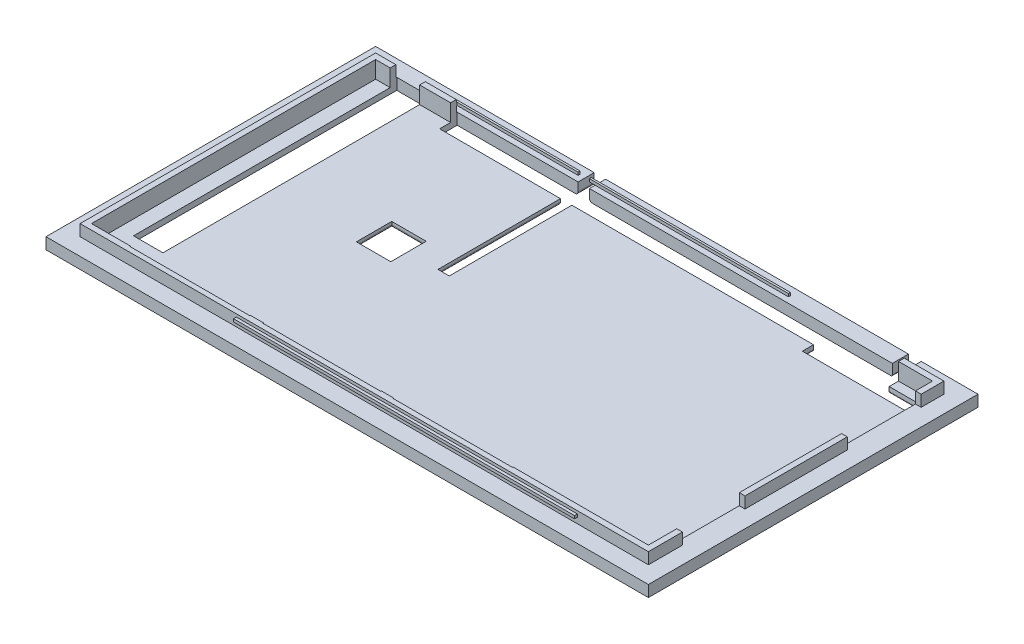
ISO-10303-21;
HEADER;
FILE_DESCRIPTION(('STEP AP214'),'2;1');
FILE_NAME('part.step','',(''),(''),'','','');
FILE_SCHEMA(('AUTOMOTIVE_DESIGN { 1 0 10303 214 1 1 1 1 }'));
ENDSEC;
DATA;
#1=APPLICATION_CONTEXT('core data for automotive mechanical design processes');
#2=APPLICATION_PROTOCOL_DEFINITION('international standard','automotive_design',2000,#1);
#3=PRODUCT_CONTEXT('',#1,'mechanical');
#4=PRODUCT('Part','Part','',(#3));
#5=PRODUCT_RELATED_PRODUCT_CATEGORY('part','',(#4));
#6=PRODUCT_DEFINITION_FORMATION('','',#4);
#7=PRODUCT_DEFINITION_CONTEXT('part definition',#1,'design');
#8=PRODUCT_DEFINITION('design','',#6,#7);
#9=PRODUCT_DEFINITION_SHAPE('','',#8);
#10=(LENGTH_UNIT() NAMED_UNIT(*) SI_UNIT(.MILLI.,.METRE.));
#11=(NAMED_UNIT(*) PLANE_ANGLE_UNIT() SI_UNIT($,.RADIAN.));
#12=(NAMED_UNIT(*) SI_UNIT($,.STERADIAN.) SOLID_ANGLE_UNIT());
#13=UNCERTAINTY_MEASURE_WITH_UNIT(LENGTH_MEASURE(1.E-05),#10,'distance_accuracy_value','');
#14=(GEOMETRIC_REPRESENTATION_CONTEXT(3) GLOBAL_UNCERTAINTY_ASSIGNED_CONTEXT((#13)) GLOBAL_UNIT_ASSIGNED_CONTEXT((#10,
#11,#12)) REPRESENTATION_CONTEXT('',''));
#15=CARTESIAN_POINT('',(0.,0.,0.));
#16=DIRECTION('',(0.,0.,1.));
#17=DIRECTION('',(1.,0.,0.));
#18=AXIS2_PLACEMENT_3D('',#15,#16,#17);
#19=CARTESIAN_POINT('',(0.,2.,0.));
#20=DIRECTION('',(0.,-1.,0.));
#21=DIRECTION('',(0.,0.,-1.));
#22=AXIS2_PLACEMENT_3D('',#19,#20,#21);
#23=PLANE('',#22);
#24=DIRECTION('',(0.,0.,-1.));
#25=VECTOR('',#24,1.);
#26=CARTESIAN_POINT('',(17.1954897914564,2.,-55.1576890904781));
#27=LINE('',#26,#25);
#28=CARTESIAN_POINT('',(17.1954897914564,2.,-55.));
#29=VERTEX_POINT('',#28);
#30=CARTESIAN_POINT('',(17.1954897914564,2.,-55.1576890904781));
#31=VERTEX_POINT('',#30);
#32=EDGE_CURVE('E794',#29,#31,#27,.T.);
#33=ORIENTED_EDGE('',*,*,#32,.T.);
#34=DIRECTION('',(-1.,0.,0.));
#35=VECTOR('',#34,1.);
#36=CARTESIAN_POINT('',(68.0188391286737,2.,-55.1576890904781));
#37=LINE('',#36,#35);
#38=CARTESIAN_POINT('',(38.468,2.,-55.1576890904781));
#39=VERTEX_POINT('',#38);
#40=EDGE_CURVE('E831',#39,#31,#37,.T.);
#41=ORIENTED_EDGE('',*,*,#40,.F.);
#42=DIRECTION('',(0.,0.,1.));
#43=VECTOR('',#42,1.);
#44=CARTESIAN_POINT('',(38.468,2.,-58.));
#45=LINE('',#44,#43);
#46=CARTESIAN_POINT('',(38.468,2.,-58.));
#47=VERTEX_POINT('',#46);
#48=EDGE_CURVE('E1450',#47,#39,#45,.T.);
#49=ORIENTED_EDGE('',*,*,#48,.F.);
#50=DIRECTION('',(-1.,0.,0.));
#51=VECTOR('',#50,1.);
#52=CARTESIAN_POINT('',(0.,2.,-58.));
#53=LINE('',#52,#51);
#54=CARTESIAN_POINT('',(0.,2.,-58.));
#55=VERTEX_POINT('',#54);
#56=EDGE_CURVE('E757',#47,#55,#53,.T.);
#57=ORIENTED_EDGE('',*,*,#56,.T.);
#58=DIRECTION('',(0.,0.,1.));
#59=VECTOR('',#58,1.);
#60=CARTESIAN_POINT('',(0.,2.,0.));
#61=LINE('',#60,#59);
#62=CARTESIAN_POINT('',(0.,2.,0.));
#63=VERTEX_POINT('',#62);
#64=EDGE_CURVE('E803',#55,#63,#61,.T.);
#65=ORIENTED_EDGE('',*,*,#64,.T.);
#66=DIRECTION('',(1.,0.,0.));
#67=VECTOR('',#66,1.);
#68=CARTESIAN_POINT('',(0.,2.,0.));
#69=LINE('',#68,#67);
#70=CARTESIAN_POINT('',(106.,2.,0.));
#71=VERTEX_POINT('',#70);
#72=EDGE_CURVE('E1306',#63,#71,#69,.T.);
#73=ORIENTED_EDGE('',*,*,#72,.T.);
#74=DIRECTION('',(0.,0.,-1.));
#75=VECTOR('',#74,1.);
#76=CARTESIAN_POINT('',(106.,2.,0.));
#77=LINE('',#76,#75);
#78=CARTESIAN_POINT('',(106.,2.,-58.));
#79=VERTEX_POINT('',#78);
#80=EDGE_CURVE('E756',#71,#79,#77,.T.);
#81=ORIENTED_EDGE('',*,*,#80,.T.);
#82=CARTESIAN_POINT('',(96.01583921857,2.,-58.));
#83=VERTEX_POINT('',#82);
#84=EDGE_CURVE('E752',#79,#83,#53,.T.);
#85=ORIENTED_EDGE('',*,*,#84,.T.);
#86=DIRECTION('',(0.,0.,-1.));
#87=VECTOR('',#86,1.);
#88=CARTESIAN_POINT('',(96.01583921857,2.,-52.3511143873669));
#89=LINE('',#88,#87);
#90=CARTESIAN_POINT('',(96.01583921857,2.,-55.));
#91=VERTEX_POINT('',#90);
#92=EDGE_CURVE('E1208',#91,#83,#89,.T.);
#93=ORIENTED_EDGE('',*,*,#92,.F.);
#94=DIRECTION('',(-1.,0.,0.));
#95=VECTOR('',#94,1.);
#96=CARTESIAN_POINT('',(3.,2.,-55.));
#97=LINE('',#96,#95);
#98=CARTESIAN_POINT('',(103.,2.,-55.));
#99=VERTEX_POINT('',#98);
#100=EDGE_CURVE('E771',#99,#91,#97,.T.);
#101=ORIENTED_EDGE('',*,*,#100,.F.);
#102=DIRECTION('',(0.,0.,-1.));
#103=VECTOR('',#102,1.);
#104=CARTESIAN_POINT('',(103.,2.,-3.));
#105=LINE('',#104,#103);
#106=CARTESIAN_POINT('',(103.,2.,-51.));
#107=VERTEX_POINT('',#106);
#108=EDGE_CURVE('E1265',#107,#99,#105,.T.);
#109=ORIENTED_EDGE('',*,*,#108,.F.);
#110=DIRECTION('',(1.,0.,0.));
#111=VECTOR('',#110,1.);
#112=CARTESIAN_POINT('',(-0.001000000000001,2.,-51.));
#113=LINE('',#112,#111);
#114=CARTESIAN_POINT('',(102.,2.,-51.));
#115=VERTEX_POINT('',#114);
#116=EDGE_CURVE('E1408',#115,#107,#113,.T.);
#117=ORIENTED_EDGE('',*,*,#116,.F.);
#118=DIRECTION('',(0.,0.,-1.));
#119=VECTOR('',#118,1.);
#120=CARTESIAN_POINT('',(102.,2.,-51.));
#121=LINE('',#120,#119);
#122=CARTESIAN_POINT('',(102.,2.,-38.));
#123=VERTEX_POINT('',#122);
#124=EDGE_CURVE('E1420',#123,#115,#121,.T.);
#125=ORIENTED_EDGE('',*,*,#124,.F.);
#126=DIRECTION('',(1.,0.,0.));
#127=VECTOR('',#126,1.);
#128=CARTESIAN_POINT('',(-0.001000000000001,2.,-38.));
#129=LINE('',#128,#127);
#130=CARTESIAN_POINT('',(103.,2.,-38.));
#131=VERTEX_POINT('',#130);
#132=EDGE_CURVE('E755',#123,#131,#129,.T.);
#133=ORIENTED_EDGE('',*,*,#132,.T.);
#134=CARTESIAN_POINT('',(103.,2.,-20.));
#135=VERTEX_POINT('',#134);
#136=EDGE_CURVE('E1255',#135,#131,#105,.T.);
#137=ORIENTED_EDGE('',*,*,#136,.F.);
#138=DIRECTION('',(1.,0.,0.));
#139=VECTOR('',#138,1.);
#140=CARTESIAN_POINT('',(-0.001000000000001,2.,-20.));
#141=LINE('',#140,#139);
#142=CARTESIAN_POINT('',(102.,2.,-20.));
#143=VERTEX_POINT('',#142);
#144=EDGE_CURVE('E1431',#143,#135,#141,.T.);
#145=ORIENTED_EDGE('',*,*,#144,.F.);
#146=DIRECTION('',(0.,0.,-1.));
#147=VECTOR('',#146,1.);
#148=CARTESIAN_POINT('',(102.,2.,-20.));
#149=LINE('',#148,#147);
#150=CARTESIAN_POINT('',(102.,2.,-9.));
#151=VERTEX_POINT('',#150);
#152=EDGE_CURVE('E1441',#151,#143,#149,.T.);
#153=ORIENTED_EDGE('',*,*,#152,.F.);
#154=DIRECTION('',(1.,0.,0.));
#155=VECTOR('',#154,1.);
#156=CARTESIAN_POINT('',(-0.001000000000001,2.,-9.));
#157=LINE('',#156,#155);
#158=CARTESIAN_POINT('',(103.,2.,-9.));
#159=VERTEX_POINT('',#158);
#160=EDGE_CURVE('E1407',#151,#159,#157,.T.);
#161=ORIENTED_EDGE('',*,*,#160,.T.);
#162=CARTESIAN_POINT('',(103.,2.,-3.));
#163=VERTEX_POINT('',#162);
#164=EDGE_CURVE('E1256',#163,#159,#105,.T.);
#165=ORIENTED_EDGE('',*,*,#164,.F.);
#166=DIRECTION('',(1.,0.,0.));
#167=VECTOR('',#166,1.);
#168=CARTESIAN_POINT('',(3.,2.,-3.));
#169=LINE('',#168,#167);
#170=CARTESIAN_POINT('',(3.,2.,-3.));
#171=VERTEX_POINT('',#170);
#172=EDGE_CURVE('E1269',#171,#163,#169,.T.);
#173=ORIENTED_EDGE('',*,*,#172,.F.);
#174=DIRECTION('',(0.,0.,1.));
#175=VECTOR('',#174,1.);
#176=CARTESIAN_POINT('',(3.,2.,-3.));
#177=LINE('',#176,#175);
#178=CARTESIAN_POINT('',(3.,2.,-55.));
#179=VERTEX_POINT('',#178);
#180=EDGE_CURVE('E1264',#179,#171,#177,.T.);
#181=ORIENTED_EDGE('',*,*,#180,.F.);
#182=CARTESIAN_POINT('',(6.56387421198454,2.,-55.));
#183=VERTEX_POINT('',#182);
#184=EDGE_CURVE('E1276',#183,#179,#97,.T.);
#185=ORIENTED_EDGE('',*,*,#184,.F.);
#186=DIRECTION('',(0.,0.,-1.));
#187=VECTOR('',#186,1.);
#188=CARTESIAN_POINT('',(6.56387421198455,2.,-55.157689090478));
#189=LINE('',#188,#187);
#190=CARTESIAN_POINT('',(6.56387421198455,2.,-55.157689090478));
#191=VERTEX_POINT('',#190);
#192=EDGE_CURVE('E1322',#183,#191,#189,.T.);
#193=ORIENTED_EDGE('',*,*,#192,.T.);
#194=DIRECTION('',(-1.,0.,0.));
#195=VECTOR('',#194,1.);
#196=CARTESIAN_POINT('',(6.56387421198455,2.,-55.157689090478));
#197=LINE('',#196,#195);
#198=CARTESIAN_POINT('',(11.7446922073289,2.,-55.157689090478));
#199=VERTEX_POINT('',#198);
#200=EDGE_CURVE('E1520',#199,#191,#197,.T.);
#201=ORIENTED_EDGE('',*,*,#200,.F.);
#202=DIRECTION('',(0.,0.,-1.));
#203=VECTOR('',#202,1.);
#204=CARTESIAN_POINT('',(11.7446922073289,2.,-55.157689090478));
#205=LINE('',#204,#203);
#206=CARTESIAN_POINT('',(11.7446922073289,2.,-55.));
#207=VERTEX_POINT('',#206);
#208=EDGE_CURVE('E1497',#207,#199,#205,.T.);
#209=ORIENTED_EDGE('',*,*,#208,.F.);
#210=EDGE_CURVE('E1312',#29,#207,#97,.T.);
#211=ORIENTED_EDGE('',*,*,#210,.F.);
#212=EDGE_LOOP('',(#33,#41,#49,#57,#65,#73,#81,#85,#93,#101,#109,#117,#125,#133,#137,#145,#153,
#161,#165,#173,#181,#185,#193,#201,#209,#211));
#213=FACE_BOUND('',#212,.T.);
#214=ADVANCED_FACE('F44',(#213),#23,.F.);
#215=CARTESIAN_POINT('',(0.,4.,0.));
#216=DIRECTION('',(0.,1.,0.));
#217=DIRECTION('',(0.,0.,1.));
#218=AXIS2_PLACEMENT_3D('',#215,#216,#217);
#219=PLANE('',#218);
#220=DIRECTION('',(1.,0.,0.));
#221=VECTOR('',#220,1.);
#222=CARTESIAN_POINT('',(10.8515440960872,4.,-3.88949614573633));
#223=LINE('',#222,#221);
#224=CARTESIAN_POINT('',(10.8515440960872,4.,-3.88949614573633));
#225=VERTEX_POINT('',#224);
#226=CARTESIAN_POINT('',(31.9840744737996,4.,-3.88949614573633));
#227=VERTEX_POINT('',#226);
#228=EDGE_CURVE('E716',#225,#227,#223,.T.);
#229=ORIENTED_EDGE('',*,*,#228,.F.);
#230=DIRECTION('',(0.,0.,1.));
#231=VECTOR('',#230,1.);
#232=CARTESIAN_POINT('',(10.8515440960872,4.,-6.76471014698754));
#233=LINE('',#232,#231);
#234=CARTESIAN_POINT('',(10.8515440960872,4.,-4.));
#235=VERTEX_POINT('',#234);
#236=EDGE_CURVE('E691',#235,#225,#233,.T.);
#237=ORIENTED_EDGE('',*,*,#236,.F.);
#238=DIRECTION('',(1.,0.,0.));
#239=VECTOR('',#238,1.);
#240=CARTESIAN_POINT('',(3.,4.,-4.));
#241=LINE('',#240,#239);
#242=CARTESIAN_POINT('',(4.,4.,-4.));
#243=VERTEX_POINT('',#242);
#244=EDGE_CURVE('E725',#243,#235,#241,.T.);
#245=ORIENTED_EDGE('',*,*,#244,.F.);
#246=DIRECTION('',(0.,0.,-1.));
#247=VECTOR('',#246,1.);
#248=CARTESIAN_POINT('',(4.,4.,-3.));
#249=LINE('',#248,#247);
#250=CARTESIAN_POINT('',(4.,4.,-54.));
#251=VERTEX_POINT('',#250);
#252=EDGE_CURVE('E1319',#243,#251,#249,.T.);
#253=ORIENTED_EDGE('',*,*,#252,.T.);
#254=DIRECTION('',(1.,0.,0.));
#255=VECTOR('',#254,1.);
#256=CARTESIAN_POINT('',(3.,4.,-54.));
#257=LINE('',#256,#255);
#258=CARTESIAN_POINT('',(6.56387421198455,4.,-54.));
#259=VERTEX_POINT('',#258);
#260=EDGE_CURVE('E1285',#251,#259,#257,.T.);
#261=ORIENTED_EDGE('',*,*,#260,.T.);
#262=DIRECTION('',(0.,0.,1.));
#263=VECTOR('',#262,1.);
#264=CARTESIAN_POINT('',(6.56387421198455,4.,-55.157689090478));
#265=LINE('',#264,#263);
#266=CARTESIAN_POINT('',(6.56387421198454,4.,-55.));
#267=VERTEX_POINT('',#266);
#268=EDGE_CURVE('E1533',#267,#259,#265,.T.);
#269=ORIENTED_EDGE('',*,*,#268,.F.);
#270=DIRECTION('',(1.,0.,0.));
#271=VECTOR('',#270,1.);
#272=CARTESIAN_POINT('',(3.,4.,-55.));
#273=LINE('',#272,#271);
#274=CARTESIAN_POINT('',(3.,4.,-55.));
#275=VERTEX_POINT('',#274);
#276=EDGE_CURVE('E860',#275,#267,#273,.T.);
#277=ORIENTED_EDGE('',*,*,#276,.F.);
#278=DIRECTION('',(0.,0.,-1.));
#279=VECTOR('',#278,1.);
#280=CARTESIAN_POINT('',(3.,4.,-3.));
#281=LINE('',#280,#279);
#282=CARTESIAN_POINT('',(3.,4.,-3.));
#283=VERTEX_POINT('',#282);
#284=EDGE_CURVE('E1270',#283,#275,#281,.T.);
#285=ORIENTED_EDGE('',*,*,#284,.F.);
#286=DIRECTION('',(1.,0.,0.));
#287=VECTOR('',#286,1.);
#288=CARTESIAN_POINT('',(3.,4.,-3.));
#289=LINE('',#288,#287);
#290=CARTESIAN_POINT('',(103.,4.,-3.));
#291=VERTEX_POINT('',#290);
#292=EDGE_CURVE('E1280',#283,#291,#289,.T.);
#293=ORIENTED_EDGE('',*,*,#292,.T.);
#294=DIRECTION('',(0.,0.,-1.));
#295=VECTOR('',#294,1.);
#296=CARTESIAN_POINT('',(103.,4.,-3.));
#297=LINE('',#296,#295);
#298=CARTESIAN_POINT('',(103.,4.,-9.));
#299=VERTEX_POINT('',#298);
#300=EDGE_CURVE('E661',#291,#299,#297,.T.);
#301=ORIENTED_EDGE('',*,*,#300,.T.);
#302=DIRECTION('',(1.,0.,0.));
#303=VECTOR('',#302,1.);
#304=CARTESIAN_POINT('',(-0.001000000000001,4.,-9.));
#305=LINE('',#304,#303);
#306=CARTESIAN_POINT('',(102.,4.,-9.));
#307=VERTEX_POINT('',#306);
#308=EDGE_CURVE('E1427',#307,#299,#305,.T.);
#309=ORIENTED_EDGE('',*,*,#308,.F.);
#310=DIRECTION('',(0.,0.,-1.));
#311=VECTOR('',#310,1.);
#312=CARTESIAN_POINT('',(102.,4.,-3.));
#313=LINE('',#312,#311);
#314=CARTESIAN_POINT('',(102.,4.,-4.));
#315=VERTEX_POINT('',#314);
#316=EDGE_CURVE('E1327',#315,#307,#313,.T.);
#317=ORIENTED_EDGE('',*,*,#316,.F.);
#318=CARTESIAN_POINT('',(78.2389079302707,4.,-4.));
#319=VERTEX_POINT('',#318);
#320=EDGE_CURVE('E656',#319,#315,#241,.T.);
#321=ORIENTED_EDGE('',*,*,#320,.F.);
#322=DIRECTION('',(0.,0.,1.));
#323=VECTOR('',#322,1.);
#324=CARTESIAN_POINT('',(78.2389079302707,4.,-6.76471014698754));
#325=LINE('',#324,#323);
#326=CARTESIAN_POINT('',(78.2389079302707,4.,-3.88949614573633));
#327=VERTEX_POINT('',#326);
#328=EDGE_CURVE('E658',#319,#327,#325,.T.);
#329=ORIENTED_EDGE('',*,*,#328,.T.);
#330=DIRECTION('',(1.,0.,0.));
#331=VECTOR('',#330,1.);
#332=CARTESIAN_POINT('',(57.1266222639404,4.,-3.88949614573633));
#333=LINE('',#332,#331);
#334=CARTESIAN_POINT('',(57.1266222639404,4.,-3.88949614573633));
#335=VERTEX_POINT('',#334);
#336=EDGE_CURVE('E622',#335,#327,#333,.T.);
#337=ORIENTED_EDGE('',*,*,#336,.F.);
#338=DIRECTION('',(0.,0.,1.));
#339=VECTOR('',#338,1.);
#340=CARTESIAN_POINT('',(57.1266222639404,4.,-6.76471014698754));
#341=LINE('',#340,#339);
#342=CARTESIAN_POINT('',(57.1266222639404,4.,-4.));
#343=VERTEX_POINT('',#342);
#344=EDGE_CURVE('E625',#343,#335,#341,.T.);
#345=ORIENTED_EDGE('',*,*,#344,.F.);
#346=CARTESIAN_POINT('',(55.0207622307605,4.,-4.));
#347=VERTEX_POINT('',#346);
#348=EDGE_CURVE('E703',#347,#343,#241,.T.);
#349=ORIENTED_EDGE('',*,*,#348,.F.);
#350=DIRECTION('',(0.,0.,1.));
#351=VECTOR('',#350,1.);
#352=CARTESIAN_POINT('',(55.0207622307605,4.,-6.76471014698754));
#353=LINE('',#352,#351);
#354=CARTESIAN_POINT('',(55.0207622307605,4.,-3.88949614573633));
#355=VERTEX_POINT('',#354);
#356=EDGE_CURVE('E606',#347,#355,#353,.T.);
#357=ORIENTED_EDGE('',*,*,#356,.T.);
#358=DIRECTION('',(1.,0.,0.));
#359=VECTOR('',#358,1.);
#360=CARTESIAN_POINT('',(34.2487430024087,4.,-3.88949614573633));
#361=LINE('',#360,#359);
#362=CARTESIAN_POINT('',(34.2487430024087,4.,-3.88949614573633));
#363=VERTEX_POINT('',#362);
#364=EDGE_CURVE('E671',#363,#355,#361,.T.);
#365=ORIENTED_EDGE('',*,*,#364,.F.);
#366=DIRECTION('',(0.,0.,1.));
#367=VECTOR('',#366,1.);
#368=CARTESIAN_POINT('',(34.2487430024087,4.,-6.76471014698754));
#369=LINE('',#368,#367);
#370=CARTESIAN_POINT('',(34.2487430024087,4.,-4.));
#371=VERTEX_POINT('',#370);
#372=EDGE_CURVE('E644',#371,#363,#369,.T.);
#373=ORIENTED_EDGE('',*,*,#372,.F.);
#374=CARTESIAN_POINT('',(31.9840744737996,4.,-4.));
#375=VERTEX_POINT('',#374);
#376=EDGE_CURVE('E704',#375,#371,#241,.T.);
#377=ORIENTED_EDGE('',*,*,#376,.F.);
#378=DIRECTION('',(0.,0.,1.));
#379=VECTOR('',#378,1.);
#380=CARTESIAN_POINT('',(31.9840744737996,4.,-6.76471014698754));
#381=LINE('',#380,#379);
#382=EDGE_CURVE('E603',#375,#227,#381,.T.);
#383=ORIENTED_EDGE('',*,*,#382,.T.);
#384=EDGE_LOOP('',(#229,#237,#245,#253,#261,#269,#277,#285,#293,#301,#309,#317,#321,#329,#337,
#345,#349,#357,#365,#373,#377,#383));
#385=FACE_BOUND('',#384,.T.);
#386=ADVANCED_FACE('F911',(#385),#219,.T.);
#387=CARTESIAN_POINT('',(0.,1.,0.));
#388=DIRECTION('',(0.,1.,0.));
#389=DIRECTION('',(0.,0.,1.));
#390=AXIS2_PLACEMENT_3D('',#387,#388,#389);
#391=PLANE('',#390);
#392=DIRECTION('',(1.,0.,0.));
#393=VECTOR('',#392,1.);
#394=CARTESIAN_POINT('',(27.0921829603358,1.,-27.5196810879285));
#395=LINE('',#394,#393);
#396=CARTESIAN_POINT('',(27.0921829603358,1.,-27.5196810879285));
#397=VERTEX_POINT('',#396);
#398=CARTESIAN_POINT('',(33.1477285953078,1.,-27.5196810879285));
#399=VERTEX_POINT('',#398);
#400=EDGE_CURVE('E889',#397,#399,#395,.T.);
#401=ORIENTED_EDGE('',*,*,#400,.F.);
#402=DIRECTION('',(0.,0.,1.));
#403=VECTOR('',#402,1.);
#404=CARTESIAN_POINT('',(27.0921829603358,1.,-33.7507497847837));
#405=LINE('',#404,#403);
#406=CARTESIAN_POINT('',(27.0921829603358,1.,-33.7507497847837));
#407=VERTEX_POINT('',#406);
#408=EDGE_CURVE('E602',#407,#397,#405,.T.);
#409=ORIENTED_EDGE('',*,*,#408,.F.);
#410=DIRECTION('',(1.,0.,0.));
#411=VECTOR('',#410,1.);
#412=CARTESIAN_POINT('',(27.0921829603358,1.,-33.7507497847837));
#413=LINE('',#412,#411);
#414=CARTESIAN_POINT('',(33.1477285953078,1.,-33.7507497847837));
#415=VERTEX_POINT('',#414);
#416=EDGE_CURVE('E583',#407,#415,#413,.T.);
#417=ORIENTED_EDGE('',*,*,#416,.T.);
#418=DIRECTION('',(0.,0.,1.));
#419=VECTOR('',#418,1.);
#420=CARTESIAN_POINT('',(33.1477285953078,1.,-33.7507497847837));
#421=LINE('',#420,#419);
#422=EDGE_CURVE('E593',#415,#399,#421,.T.);
#423=ORIENTED_EDGE('',*,*,#422,.T.);
#424=EDGE_LOOP('',(#401,#409,#417,#423));
#425=FACE_BOUND('',#424,.T.);
#426=DIRECTION('',(1.,0.,0.));
#427=VECTOR('',#426,1.);
#428=CARTESIAN_POINT('',(0.,1.,-4.));
#429=LINE('',#428,#427);
#430=CARTESIAN_POINT('',(4.,1.,-4.));
#431=VERTEX_POINT('',#430);
#432=CARTESIAN_POINT('',(10.8515440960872,1.,-4.));
#433=VERTEX_POINT('',#432);
#434=EDGE_CURVE('E597',#431,#433,#429,.T.);
#435=ORIENTED_EDGE('',*,*,#434,.T.);
#436=DIRECTION('',(0.,0.,1.));
#437=VECTOR('',#436,1.);
#438=CARTESIAN_POINT('',(10.8515440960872,1.,-6.76471014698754));
#439=LINE('',#438,#437);
#440=CARTESIAN_POINT('',(10.8515440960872,1.,-6.76471014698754));
#441=VERTEX_POINT('',#440);
#442=EDGE_CURVE('E711',#441,#433,#439,.T.);
#443=ORIENTED_EDGE('',*,*,#442,.F.);
#444=DIRECTION('',(1.,0.,0.));
#445=VECTOR('',#444,1.);
#446=CARTESIAN_POINT('',(10.8515440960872,1.,-6.76471014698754));
#447=LINE('',#446,#445);
#448=CARTESIAN_POINT('',(31.9840744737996,1.,-6.76471014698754));
#449=VERTEX_POINT('',#448);
#450=EDGE_CURVE('E710',#441,#449,#447,.T.);
#451=ORIENTED_EDGE('',*,*,#450,.T.);
#452=DIRECTION('',(0.,0.,1.));
#453=VECTOR('',#452,1.);
#454=CARTESIAN_POINT('',(31.9840744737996,1.,-6.76471014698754));
#455=LINE('',#454,#453);
#456=CARTESIAN_POINT('',(31.9840744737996,1.,-4.));
#457=VERTEX_POINT('',#456);
#458=EDGE_CURVE('E707',#449,#457,#455,.T.);
#459=ORIENTED_EDGE('',*,*,#458,.T.);
#460=CARTESIAN_POINT('',(34.2487430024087,1.,-4.));
#461=VERTEX_POINT('',#460);
#462=EDGE_CURVE('E699',#457,#461,#429,.T.);
#463=ORIENTED_EDGE('',*,*,#462,.T.);
#464=DIRECTION('',(0.,0.,1.));
#465=VECTOR('',#464,1.);
#466=CARTESIAN_POINT('',(34.2487430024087,1.,-6.76471014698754));
#467=LINE('',#466,#465);
#468=CARTESIAN_POINT('',(34.2487430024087,1.,-6.76471014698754));
#469=VERTEX_POINT('',#468);
#470=EDGE_CURVE('E666',#469,#461,#467,.T.);
#471=ORIENTED_EDGE('',*,*,#470,.F.);
#472=DIRECTION('',(1.,0.,0.));
#473=VECTOR('',#472,1.);
#474=CARTESIAN_POINT('',(34.2487430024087,1.,-6.76471014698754));
#475=LINE('',#474,#473);
#476=CARTESIAN_POINT('',(55.0207622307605,1.,-6.76471014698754));
#477=VERTEX_POINT('',#476);
#478=EDGE_CURVE('E665',#469,#477,#475,.T.);
#479=ORIENTED_EDGE('',*,*,#478,.T.);
#480=DIRECTION('',(0.,0.,1.));
#481=VECTOR('',#480,1.);
#482=CARTESIAN_POINT('',(55.0207622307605,1.,-6.76471014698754));
#483=LINE('',#482,#481);
#484=CARTESIAN_POINT('',(55.0207622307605,1.,-4.));
#485=VERTEX_POINT('',#484);
#486=EDGE_CURVE('E662',#477,#485,#483,.T.);
#487=ORIENTED_EDGE('',*,*,#486,.T.);
#488=CARTESIAN_POINT('',(57.1266222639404,1.,-4.));
#489=VERTEX_POINT('',#488);
#490=EDGE_CURVE('E652',#485,#489,#429,.T.);
#491=ORIENTED_EDGE('',*,*,#490,.T.);
#492=DIRECTION('',(0.,0.,1.));
#493=VECTOR('',#492,1.);
#494=CARTESIAN_POINT('',(57.1266222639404,1.,-6.76471014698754));
#495=LINE('',#494,#493);
#496=CARTESIAN_POINT('',(57.1266222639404,1.,-6.76471014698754));
#497=VERTEX_POINT('',#496);
#498=EDGE_CURVE('E617',#497,#489,#495,.T.);
#499=ORIENTED_EDGE('',*,*,#498,.F.);
#500=DIRECTION('',(1.,0.,0.));
#501=VECTOR('',#500,1.);
#502=CARTESIAN_POINT('',(57.1266222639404,1.,-6.76471014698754));
#503=LINE('',#502,#501);
#504=CARTESIAN_POINT('',(78.2389079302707,1.,-6.76471014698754));
#505=VERTEX_POINT('',#504);
#506=EDGE_CURVE('E616',#497,#505,#503,.T.);
#507=ORIENTED_EDGE('',*,*,#506,.T.);
#508=DIRECTION('',(0.,0.,1.));
#509=VECTOR('',#508,1.);
#510=CARTESIAN_POINT('',(78.2389079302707,1.,-6.76471014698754));
#511=LINE('',#510,#509);
#512=CARTESIAN_POINT('',(78.2389079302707,1.,-4.));
#513=VERTEX_POINT('',#512);
#514=EDGE_CURVE('E612',#505,#513,#511,.T.);
#515=ORIENTED_EDGE('',*,*,#514,.T.);
#516=CARTESIAN_POINT('',(102.,1.,-4.));
#517=VERTEX_POINT('',#516);
#518=EDGE_CURVE('E615',#513,#517,#429,.T.);
#519=ORIENTED_EDGE('',*,*,#518,.T.);
#520=DIRECTION('',(0.,0.,-1.));
#521=VECTOR('',#520,1.);
#522=CARTESIAN_POINT('',(102.,1.,0.));
#523=LINE('',#522,#521);
#524=CARTESIAN_POINT('',(102.,1.,-54.));
#525=VERTEX_POINT('',#524);
#526=EDGE_CURVE('E1349',#517,#525,#523,.T.);
#527=ORIENTED_EDGE('',*,*,#526,.T.);
#528=DIRECTION('',(-1.,0.,0.));
#529=VECTOR('',#528,1.);
#530=CARTESIAN_POINT('',(3.,1.,-54.));
#531=LINE('',#530,#529);
#532=CARTESIAN_POINT('',(96.01583921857,1.,-54.));
#533=VERTEX_POINT('',#532);
#534=EDGE_CURVE('E1345',#525,#533,#531,.T.);
#535=ORIENTED_EDGE('',*,*,#534,.T.);
#536=DIRECTION('',(0.,0.,1.));
#537=VECTOR('',#536,1.);
#538=CARTESIAN_POINT('',(96.01583921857,1.,-52.3511143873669));
#539=LINE('',#538,#537);
#540=CARTESIAN_POINT('',(96.01583921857,1.,-52.3511143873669));
#541=VERTEX_POINT('',#540);
#542=EDGE_CURVE('E1348',#533,#541,#539,.T.);
#543=ORIENTED_EDGE('',*,*,#542,.T.);
#544=DIRECTION('',(1.,0.,0.));
#545=VECTOR('',#544,1.);
#546=CARTESIAN_POINT('',(101.327640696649,1.,-52.3511143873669));
#547=LINE('',#546,#545);
#548=CARTESIAN_POINT('',(101.327640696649,1.,-52.3511143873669));
#549=VERTEX_POINT('',#548);
#550=EDGE_CURVE('E1471',#541,#549,#547,.T.);
#551=ORIENTED_EDGE('',*,*,#550,.T.);
#552=DIRECTION('',(0.,0.,1.));
#553=VECTOR('',#552,1.);
#554=CARTESIAN_POINT('',(101.327640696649,1.,-50.1011143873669));
#555=LINE('',#554,#553);
#556=CARTESIAN_POINT('',(101.327640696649,1.,-50.1011143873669));
#557=VERTEX_POINT('',#556);
#558=EDGE_CURVE('E1474',#549,#557,#555,.T.);
#559=ORIENTED_EDGE('',*,*,#558,.T.);
#560=DIRECTION('',(-1.,0.,0.));
#561=VECTOR('',#560,1.);
#562=CARTESIAN_POINT('',(82.9904488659,1.,-50.1011143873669));
#563=LINE('',#562,#561);
#564=CARTESIAN_POINT('',(82.9904488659,1.,-50.1011143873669));
#565=VERTEX_POINT('',#564);
#566=EDGE_CURVE('E1492',#557,#565,#563,.T.);
#567=ORIENTED_EDGE('',*,*,#566,.T.);
#568=DIRECTION('',(0.,0.,-1.));
#569=VECTOR('',#568,1.);
#570=CARTESIAN_POINT('',(82.9904488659,1.,-52.3511143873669));
#571=LINE('',#570,#569);
#572=CARTESIAN_POINT('',(82.9904488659,1.,-52.0670001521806));
#573=VERTEX_POINT('',#572);
#574=EDGE_CURVE('E886',#565,#573,#571,.T.);
#575=ORIENTED_EDGE('',*,*,#574,.T.);
#576=DIRECTION('',(-1.,0.,0.));
#577=VECTOR('',#576,1.);
#578=CARTESIAN_POINT('',(93.76583921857,1.,-52.0670001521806));
#579=LINE('',#578,#577);
#580=CARTESIAN_POINT('',(40.468,1.,-52.0670001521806));
#581=VERTEX_POINT('',#580);
#582=EDGE_CURVE('E882',#573,#581,#579,.T.);
#583=ORIENTED_EDGE('',*,*,#582,.T.);
#584=DIRECTION('',(0.,0.,1.));
#585=VECTOR('',#584,1.);
#586=CARTESIAN_POINT('',(40.468,1.,-58.));
#587=LINE('',#586,#585);
#588=CARTESIAN_POINT('',(40.468,1.,-30.5));
#589=VERTEX_POINT('',#588);
#590=EDGE_CURVE('E885',#581,#589,#587,.T.);
#591=ORIENTED_EDGE('',*,*,#590,.T.);
#592=DIRECTION('',(-1.,0.,0.));
#593=VECTOR('',#592,1.);
#594=CARTESIAN_POINT('',(40.468,1.,-30.5));
#595=LINE('',#594,#593);
#596=CARTESIAN_POINT('',(38.468,1.,-30.5));
#597=VERTEX_POINT('',#596);
#598=EDGE_CURVE('E1459',#589,#597,#595,.T.);
#599=ORIENTED_EDGE('',*,*,#598,.T.);
#600=DIRECTION('',(0.,0.,-1.));
#601=VECTOR('',#600,1.);
#602=CARTESIAN_POINT('',(38.468,1.,-58.));
#603=LINE('',#602,#601);
#604=CARTESIAN_POINT('',(38.468,1.,-52.0670001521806));
#605=VERTEX_POINT('',#604);
#606=EDGE_CURVE('E866',#597,#605,#603,.T.);
#607=ORIENTED_EDGE('',*,*,#606,.T.);
#608=DIRECTION('',(-1.,0.,0.));
#609=VECTOR('',#608,1.);
#610=CARTESIAN_POINT('',(93.76583921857,1.,-52.0670001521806));
#611=LINE('',#610,#609);
#612=CARTESIAN_POINT('',(17.1954897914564,1.,-52.0670001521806));
#613=VERTEX_POINT('',#612);
#614=EDGE_CURVE('E862',#605,#613,#611,.T.);
#615=ORIENTED_EDGE('',*,*,#614,.T.);
#616=DIRECTION('',(0.,0.,1.));
#617=VECTOR('',#616,1.);
#618=CARTESIAN_POINT('',(17.1954897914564,1.,-55.1576890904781));
#619=LINE('',#618,#617);
#620=CARTESIAN_POINT('',(17.1954897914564,1.,-54.));
#621=VERTEX_POINT('',#620);
#622=EDGE_CURVE('E817',#621,#613,#619,.T.);
#623=ORIENTED_EDGE('',*,*,#622,.F.);
#624=CARTESIAN_POINT('',(11.7446922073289,1.,-54.));
#625=VERTEX_POINT('',#624);
#626=EDGE_CURVE('E865',#621,#625,#531,.T.);
#627=ORIENTED_EDGE('',*,*,#626,.T.);
#628=DIRECTION('',(0.,0.,1.));
#629=VECTOR('',#628,1.);
#630=CARTESIAN_POINT('',(11.7446922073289,1.,-55.157689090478));
#631=LINE('',#630,#629);
#632=CARTESIAN_POINT('',(11.7446922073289,1.,-8.83508113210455));
#633=VERTEX_POINT('',#632);
#634=EDGE_CURVE('E1509',#625,#633,#631,.T.);
#635=ORIENTED_EDGE('',*,*,#634,.T.);
#636=DIRECTION('',(1.,0.,0.));
#637=VECTOR('',#636,1.);
#638=CARTESIAN_POINT('',(6.56387421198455,1.,-8.83508113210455));
#639=LINE('',#638,#637);
#640=CARTESIAN_POINT('',(6.56387421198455,1.,-8.83508113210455));
#641=VERTEX_POINT('',#640);
#642=EDGE_CURVE('E806',#641,#633,#639,.T.);
#643=ORIENTED_EDGE('',*,*,#642,.F.);
#644=DIRECTION('',(0.,0.,1.));
#645=VECTOR('',#644,1.);
#646=CARTESIAN_POINT('',(6.56387421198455,1.,-55.157689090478));
#647=LINE('',#646,#645);
#648=CARTESIAN_POINT('',(6.56387421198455,1.,-54.));
#649=VERTEX_POINT('',#648);
#650=EDGE_CURVE('E1516',#649,#641,#647,.T.);
#651=ORIENTED_EDGE('',*,*,#650,.F.);
#652=CARTESIAN_POINT('',(4.,1.,-54.));
#653=VERTEX_POINT('',#652);
#654=EDGE_CURVE('E1339',#649,#653,#531,.T.);
#655=ORIENTED_EDGE('',*,*,#654,.T.);
#656=DIRECTION('',(0.,0.,1.));
#657=VECTOR('',#656,1.);
#658=CARTESIAN_POINT('',(4.,1.,-3.));
#659=LINE('',#658,#657);
#660=EDGE_CURVE('E1336',#653,#431,#659,.T.);
#661=ORIENTED_EDGE('',*,*,#660,.T.);
#662=EDGE_LOOP('',(#435,#443,#451,#459,#463,#471,#479,#487,#491,#499,#507,#515,#519,#527,#535,
#543,#551,#559,#567,#575,#583,#591,#599,#607,#615,#623,#627,#635,#643,#651,#655,#661));
#663=FACE_BOUND('',#662,.T.);
#664=ADVANCED_FACE('F600',(#425,#663),#391,.T.);
#665=CARTESIAN_POINT('',(11.7446922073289,4.,-54.));
#666=VERTEX_POINT('',#665);
#667=CARTESIAN_POINT('',(17.1954897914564,4.,-54.));
#668=VERTEX_POINT('',#667);
#669=EDGE_CURVE('E1325',#666,#668,#257,.T.);
#670=ORIENTED_EDGE('',*,*,#669,.T.);
#671=DIRECTION('',(0.,0.,1.));
#672=VECTOR('',#671,1.);
#673=CARTESIAN_POINT('',(17.1954897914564,4.,-55.1576890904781));
#674=LINE('',#673,#672);
#675=CARTESIAN_POINT('',(17.1954897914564,4.,-55.));
#676=VERTEX_POINT('',#675);
#677=EDGE_CURVE('E815',#676,#668,#674,.T.);
#678=ORIENTED_EDGE('',*,*,#677,.F.);
#679=CARTESIAN_POINT('',(11.7446922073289,4.,-55.));
#680=VERTEX_POINT('',#679);
#681=EDGE_CURVE('E1277',#680,#676,#273,.T.);
#682=ORIENTED_EDGE('',*,*,#681,.F.);
#683=DIRECTION('',(0.,0.,1.));
#684=VECTOR('',#683,1.);
#685=CARTESIAN_POINT('',(11.7446922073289,4.,-55.157689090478));
#686=LINE('',#685,#684);
#687=EDGE_CURVE('E1503',#680,#666,#686,.T.);
#688=ORIENTED_EDGE('',*,*,#687,.T.);
#689=EDGE_LOOP('',(#670,#678,#682,#688));
#690=FACE_BOUND('',#689,.T.);
#691=ADVANCED_FACE('F918',(#690),#219,.T.);
#692=CARTESIAN_POINT('',(3.,4.,-55.));
#693=DIRECTION('',(0.,0.,-1.));
#694=DIRECTION('',(-1.,0.,0.));
#695=AXIS2_PLACEMENT_3D('',#692,#693,#694);
#696=PLANE('',#695);
#697=ORIENTED_EDGE('',*,*,#681,.T.);
#698=DIRECTION('',(0.,1.,0.));
#699=VECTOR('',#698,1.);
#700=CARTESIAN_POINT('',(17.1954897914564,4.001,-55.));
#701=LINE('',#700,#699);
#702=CARTESIAN_POINT('',(17.1954897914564,3.5,-55.));
#703=VERTEX_POINT('',#702);
#704=EDGE_CURVE('E818',#703,#676,#701,.T.);
#705=ORIENTED_EDGE('',*,*,#704,.F.);
#706=DIRECTION('',(1.,0.,0.));
#707=VECTOR('',#706,1.);
#708=CARTESIAN_POINT('',(75.5,3.5,-55.));
#709=LINE('',#708,#707);
#710=CARTESIAN_POINT('',(15.5,3.5,-55.));
#711=VERTEX_POINT('',#710);
#712=EDGE_CURVE('E766',#711,#703,#709,.T.);
#713=ORIENTED_EDGE('',*,*,#712,.F.);
#714=DIRECTION('',(0.,1.,0.));
#715=VECTOR('',#714,1.);
#716=CARTESIAN_POINT('',(15.5,3.5,-55.));
#717=LINE('',#716,#715);
#718=CARTESIAN_POINT('',(15.5,3.,-55.));
#719=VERTEX_POINT('',#718);
#720=EDGE_CURVE('E1388',#719,#711,#717,.T.);
#721=ORIENTED_EDGE('',*,*,#720,.F.);
#722=DIRECTION('',(-1.,0.,0.));
#723=VECTOR('',#722,1.);
#724=CARTESIAN_POINT('',(75.5,3.,-55.));
#725=LINE('',#724,#723);
#726=CARTESIAN_POINT('',(17.1954897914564,3.,-55.));
#727=VERTEX_POINT('',#726);
#728=EDGE_CURVE('E811',#727,#719,#725,.T.);
#729=ORIENTED_EDGE('',*,*,#728,.F.);
#730=EDGE_CURVE('E820',#29,#727,#701,.T.);
#731=ORIENTED_EDGE('',*,*,#730,.F.);
#732=ORIENTED_EDGE('',*,*,#210,.T.);
#733=DIRECTION('',(0.,1.,0.));
#734=VECTOR('',#733,1.);
#735=CARTESIAN_POINT('',(11.7446922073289,4.001,-55.));
#736=LINE('',#735,#734);
#737=EDGE_CURVE('E679',#207,#680,#736,.T.);
#738=ORIENTED_EDGE('',*,*,#737,.T.);
#739=EDGE_LOOP('',(#697,#705,#713,#721,#729,#731,#732,#738));
#740=FACE_BOUND('',#739,.T.);
#741=ADVANCED_FACE('F925',(#740),#696,.T.);
#742=CARTESIAN_POINT('',(0.,0.,0.));
#743=DIRECTION('',(0.,1.,0.));
#744=DIRECTION('',(0.,0.,1.));
#745=AXIS2_PLACEMENT_3D('',#742,#743,#744);
#746=PLANE('',#745);
#747=DIRECTION('',(1.,0.,0.));
#748=VECTOR('',#747,1.);
#749=CARTESIAN_POINT('',(33.1477285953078,0.,-27.0196810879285));
#750=LINE('',#749,#748);
#751=CARTESIAN_POINT('',(26.5921829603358,0.,-27.0196810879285));
#752=VERTEX_POINT('',#751);
#753=CARTESIAN_POINT('',(33.6477285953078,0.,-27.0196810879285));
#754=VERTEX_POINT('',#753);
#755=EDGE_CURVE('E778',#752,#754,#750,.T.);
#756=ORIENTED_EDGE('',*,*,#755,.T.);
#757=DIRECTION('',(0.,0.,1.));
#758=VECTOR('',#757,1.);
#759=CARTESIAN_POINT('',(33.6477285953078,0.,0.));
#760=LINE('',#759,#758);
#761=CARTESIAN_POINT('',(33.6477285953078,0.,-34.2507497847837));
#762=VERTEX_POINT('',#761);
#763=EDGE_CURVE('E780',#754,#762,#760,.F.);
#764=ORIENTED_EDGE('',*,*,#763,.T.);
#765=DIRECTION('',(1.,0.,0.));
#766=VECTOR('',#765,1.);
#767=CARTESIAN_POINT('',(0.,0.,-34.2507497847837));
#768=LINE('',#767,#766);
#769=CARTESIAN_POINT('',(26.5921829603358,0.,-34.2507497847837));
#770=VERTEX_POINT('',#769);
#771=EDGE_CURVE('E774',#762,#770,#768,.F.);
#772=ORIENTED_EDGE('',*,*,#771,.T.);
#773=DIRECTION('',(0.,0.,1.));
#774=VECTOR('',#773,1.);
#775=CARTESIAN_POINT('',(26.5921829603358,0.,-27.5196810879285));
#776=LINE('',#775,#774);
#777=EDGE_CURVE('E776',#770,#752,#776,.T.);
#778=ORIENTED_EDGE('',*,*,#777,.T.);
#779=EDGE_LOOP('',(#756,#764,#772,#778));
#780=FACE_BOUND('',#779,.T.);
#781=DIRECTION('',(0.,0.,1.));
#782=VECTOR('',#781,1.);
#783=CARTESIAN_POINT('',(34.2487430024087,0.,-6.76471014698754));
#784=LINE('',#783,#782);
#785=CARTESIAN_POINT('',(34.2487430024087,0.,-6.76471014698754));
#786=VERTEX_POINT('',#785);
#787=CARTESIAN_POINT('',(34.2487430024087,0.,-3.88949614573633));
#788=VERTEX_POINT('',#787);
#789=EDGE_CURVE('E675',#786,#788,#784,.T.);
#790=ORIENTED_EDGE('',*,*,#789,.T.);
#791=DIRECTION('',(1.,0.,0.));
#792=VECTOR('',#791,1.);
#793=CARTESIAN_POINT('',(34.2487430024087,0.,-3.88949614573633));
#794=LINE('',#793,#792);
#795=CARTESIAN_POINT('',(55.0207622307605,0.,-3.88949614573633));
#796=VERTEX_POINT('',#795);
#797=EDGE_CURVE('E678',#788,#796,#794,.T.);
#798=ORIENTED_EDGE('',*,*,#797,.T.);
#799=DIRECTION('',(0.,0.,1.));
#800=VECTOR('',#799,1.);
#801=CARTESIAN_POINT('',(55.0207622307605,0.,-6.76471014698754));
#802=LINE('',#801,#800);
#803=CARTESIAN_POINT('',(55.0207622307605,0.,-6.76471014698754));
#804=VERTEX_POINT('',#803);
#805=EDGE_CURVE('E683',#804,#796,#802,.T.);
#806=ORIENTED_EDGE('',*,*,#805,.F.);
#807=DIRECTION('',(1.,0.,0.));
#808=VECTOR('',#807,1.);
#809=CARTESIAN_POINT('',(34.2487430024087,0.,-6.76471014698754));
#810=LINE('',#809,#808);
#811=EDGE_CURVE('E688',#786,#804,#810,.T.);
#812=ORIENTED_EDGE('',*,*,#811,.F.);
#813=EDGE_LOOP('',(#790,#798,#806,#812));
#814=FACE_BOUND('',#813,.T.);
#815=DIRECTION('',(0.,0.,1.));
#816=VECTOR('',#815,1.);
#817=CARTESIAN_POINT('',(11.7446922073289,0.,-55.157689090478));
#818=LINE('',#817,#816);
#819=CARTESIAN_POINT('',(11.7446922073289,0.,-55.157689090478));
#820=VERTEX_POINT('',#819);
#821=CARTESIAN_POINT('',(11.7446922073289,0.,-8.83508113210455));
#822=VERTEX_POINT('',#821);
#823=EDGE_CURVE('E1508',#820,#822,#818,.T.);
#824=ORIENTED_EDGE('',*,*,#823,.F.);
#825=DIRECTION('',(1.,0.,0.));
#826=VECTOR('',#825,1.);
#827=CARTESIAN_POINT('',(6.56387421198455,0.,-55.157689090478));
#828=LINE('',#827,#826);
#829=CARTESIAN_POINT('',(6.56387421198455,0.,-55.157689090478));
#830=VERTEX_POINT('',#829);
#831=EDGE_CURVE('E1519',#830,#820,#828,.T.);
#832=ORIENTED_EDGE('',*,*,#831,.F.);
#833=DIRECTION('',(0.,0.,1.));
#834=VECTOR('',#833,1.);
#835=CARTESIAN_POINT('',(6.56387421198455,0.,-55.157689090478));
#836=LINE('',#835,#834);
#837=CARTESIAN_POINT('',(6.56387421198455,0.,-8.83508113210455));
#838=VERTEX_POINT('',#837);
#839=EDGE_CURVE('E682',#830,#838,#836,.T.);
#840=ORIENTED_EDGE('',*,*,#839,.T.);
#841=DIRECTION('',(1.,0.,0.));
#842=VECTOR('',#841,1.);
#843=CARTESIAN_POINT('',(6.56387421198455,0.,-8.83508113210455));
#844=LINE('',#843,#842);
#845=EDGE_CURVE('E762',#838,#822,#844,.T.);
#846=ORIENTED_EDGE('',*,*,#845,.T.);
#847=EDGE_LOOP('',(#824,#832,#840,#846));
#848=FACE_BOUND('',#847,.T.);
#849=DIRECTION('',(0.,0.,1.));
#850=VECTOR('',#849,1.);
#851=CARTESIAN_POINT('',(40.968,0.,0.));
#852=LINE('',#851,#850);
#853=CARTESIAN_POINT('',(40.968,0.,-30.));
#854=VERTEX_POINT('',#853);
#855=CARTESIAN_POINT('',(40.968,0.,-52.0670001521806));
#856=VERTEX_POINT('',#855);
#857=EDGE_CURVE('E758',#854,#856,#852,.F.);
#858=ORIENTED_EDGE('',*,*,#857,.T.);
#859=DIRECTION('',(-1.,0.,0.));
#860=VECTOR('',#859,1.);
#861=CARTESIAN_POINT('',(93.76583921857,0.,-52.0670001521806));
#862=LINE('',#861,#860);
#863=CARTESIAN_POINT('',(82.7404488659,0.,-52.0670001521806));
#864=VERTEX_POINT('',#863);
#865=EDGE_CURVE('E828',#864,#856,#862,.T.);
#866=ORIENTED_EDGE('',*,*,#865,.F.);
#867=DIRECTION('',(0.,0.,-1.));
#868=VECTOR('',#867,1.);
#869=CARTESIAN_POINT('',(82.7404488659,0.,0.));
#870=LINE('',#869,#868);
#871=CARTESIAN_POINT('',(82.7404488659,0.,-49.8511143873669));
#872=VERTEX_POINT('',#871);
#873=EDGE_CURVE('E761',#864,#872,#870,.F.);
#874=ORIENTED_EDGE('',*,*,#873,.T.);
#875=DIRECTION('',(-1.,0.,0.));
#876=VECTOR('',#875,1.);
#877=CARTESIAN_POINT('',(0.,0.,-49.8511143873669));
#878=LINE('',#877,#876);
#879=CARTESIAN_POINT('',(101.577640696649,0.,-49.8511143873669));
#880=VERTEX_POINT('',#879);
#881=EDGE_CURVE('E1230',#872,#880,#878,.F.);
#882=ORIENTED_EDGE('',*,*,#881,.T.);
#883=DIRECTION('',(0.,0.,1.));
#884=VECTOR('',#883,1.);
#885=CARTESIAN_POINT('',(101.577640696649,0.,0.));
#886=LINE('',#885,#884);
#887=CARTESIAN_POINT('',(101.577640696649,0.,-52.6011143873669));
#888=VERTEX_POINT('',#887);
#889=EDGE_CURVE('E1228',#880,#888,#886,.F.);
#890=ORIENTED_EDGE('',*,*,#889,.T.);
#891=DIRECTION('',(1.,0.,0.));
#892=VECTOR('',#891,1.);
#893=CARTESIAN_POINT('',(0.,0.,-52.6011143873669));
#894=LINE('',#893,#892);
#895=CARTESIAN_POINT('',(96.26583921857,0.,-52.6011143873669));
#896=VERTEX_POINT('',#895);
#897=EDGE_CURVE('E1226',#888,#896,#894,.F.);
#898=ORIENTED_EDGE('',*,*,#897,.T.);
#899=DIRECTION('',(0.,0.,1.));
#900=VECTOR('',#899,1.);
#901=CARTESIAN_POINT('',(96.26583921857,0.,0.));
#902=LINE('',#901,#900);
#903=CARTESIAN_POINT('',(96.26583921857,0.,-58.));
#904=VERTEX_POINT('',#903);
#905=EDGE_CURVE('E1224',#896,#904,#902,.F.);
#906=ORIENTED_EDGE('',*,*,#905,.T.);
#907=DIRECTION('',(-1.,0.,0.));
#908=VECTOR('',#907,1.);
#909=CARTESIAN_POINT('',(0.,0.,-58.));
#910=LINE('',#909,#908);
#911=CARTESIAN_POINT('',(106.,0.,-58.));
#912=VERTEX_POINT('',#911);
#913=EDGE_CURVE('E767',#912,#904,#910,.T.);
#914=ORIENTED_EDGE('',*,*,#913,.F.);
#915=DIRECTION('',(0.,0.,-1.));
#916=VECTOR('',#915,1.);
#917=CARTESIAN_POINT('',(106.,0.,0.));
#918=LINE('',#917,#916);
#919=CARTESIAN_POINT('',(106.,0.,0.));
#920=VERTEX_POINT('',#919);
#921=EDGE_CURVE('E1289',#920,#912,#918,.T.);
#922=ORIENTED_EDGE('',*,*,#921,.F.);
#923=DIRECTION('',(1.,0.,0.));
#924=VECTOR('',#923,1.);
#925=CARTESIAN_POINT('',(0.,0.,0.));
#926=LINE('',#925,#924);
#927=CARTESIAN_POINT('',(0.,0.,0.));
#928=VERTEX_POINT('',#927);
#929=EDGE_CURVE('E1290',#928,#920,#926,.T.);
#930=ORIENTED_EDGE('',*,*,#929,.F.);
#931=DIRECTION('',(0.,0.,1.));
#932=VECTOR('',#931,1.);
#933=CARTESIAN_POINT('',(0.,0.,0.));
#934=LINE('',#933,#932);
#935=CARTESIAN_POINT('',(0.,0.,-58.));
#936=VERTEX_POINT('',#935);
#937=EDGE_CURVE('E1300',#936,#928,#934,.T.);
#938=ORIENTED_EDGE('',*,*,#937,.F.);
#939=CARTESIAN_POINT('',(37.968,0.,-58.));
#940=VERTEX_POINT('',#939);
#941=EDGE_CURVE('E657',#940,#936,#910,.T.);
#942=ORIENTED_EDGE('',*,*,#941,.F.);
#943=DIRECTION('',(0.,0.,-1.));
#944=VECTOR('',#943,1.);
#945=CARTESIAN_POINT('',(37.968,0.,0.));
#946=LINE('',#945,#944);
#947=CARTESIAN_POINT('',(37.968,0.,-55.1576890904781));
#948=VERTEX_POINT('',#947);
#949=EDGE_CURVE('E839',#940,#948,#946,.F.);
#950=ORIENTED_EDGE('',*,*,#949,.T.);
#951=DIRECTION('',(1.,0.,0.));
#952=VECTOR('',#951,1.);
#953=CARTESIAN_POINT('',(68.0188391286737,0.,-55.1576890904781));
#954=LINE('',#953,#952);
#955=CARTESIAN_POINT('',(17.1954897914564,0.,-55.1576890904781));
#956=VERTEX_POINT('',#955);
#957=EDGE_CURVE('E834',#956,#948,#954,.T.);
#958=ORIENTED_EDGE('',*,*,#957,.F.);
#959=DIRECTION('',(0.,0.,1.));
#960=VECTOR('',#959,1.);
#961=CARTESIAN_POINT('',(17.1954897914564,0.,-55.1576890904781));
#962=LINE('',#961,#960);
#963=CARTESIAN_POINT('',(17.1954897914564,0.,-52.0670001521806));
#964=VERTEX_POINT('',#963);
#965=EDGE_CURVE('E835',#956,#964,#962,.T.);
#966=ORIENTED_EDGE('',*,*,#965,.T.);
#967=DIRECTION('',(-1.,0.,0.));
#968=VECTOR('',#967,1.);
#969=CARTESIAN_POINT('',(93.76583921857,0.,-52.0670001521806));
#970=LINE('',#969,#968);
#971=CARTESIAN_POINT('',(37.968,0.,-52.0670001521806));
#972=VERTEX_POINT('',#971);
#973=EDGE_CURVE('E827',#972,#964,#970,.T.);
#974=ORIENTED_EDGE('',*,*,#973,.F.);
#975=CARTESIAN_POINT('',(37.968,0.,-30.));
#976=VERTEX_POINT('',#975);
#977=EDGE_CURVE('E838',#972,#976,#946,.F.);
#978=ORIENTED_EDGE('',*,*,#977,.T.);
#979=DIRECTION('',(-1.,0.,0.));
#980=VECTOR('',#979,1.);
#981=CARTESIAN_POINT('',(0.,0.,-30.));
#982=LINE('',#981,#980);
#983=EDGE_CURVE('E632',#976,#854,#982,.F.);
#984=ORIENTED_EDGE('',*,*,#983,.T.);
#985=EDGE_LOOP('',(#858,#866,#874,#882,#890,#898,#906,#914,#922,#930,#938,#942,#950,#958,#966,
#974,#978,#984));
#986=FACE_BOUND('',#985,.T.);
#987=DIRECTION('',(0.,0.,1.));
#988=VECTOR('',#987,1.);
#989=CARTESIAN_POINT('',(57.1266222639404,0.,-6.76471014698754));
#990=LINE('',#989,#988);
#991=CARTESIAN_POINT('',(57.1266222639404,0.,-6.76471014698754));
#992=VERTEX_POINT('',#991);
#993=CARTESIAN_POINT('',(57.1266222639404,0.,-3.88949614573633));
#994=VERTEX_POINT('',#993);
#995=EDGE_CURVE('E628',#992,#994,#990,.T.);
#996=ORIENTED_EDGE('',*,*,#995,.T.);
#997=DIRECTION('',(1.,0.,0.));
#998=VECTOR('',#997,1.);
#999=CARTESIAN_POINT('',(57.1266222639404,0.,-3.88949614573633));
#1000=LINE('',#999,#998);
#1001=CARTESIAN_POINT('',(78.2389079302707,0.,-3.88949614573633));
#1002=VERTEX_POINT('',#1001);
#1003=EDGE_CURVE('E631',#994,#1002,#1000,.T.);
#1004=ORIENTED_EDGE('',*,*,#1003,.T.);
#1005=DIRECTION('',(0.,0.,1.));
#1006=VECTOR('',#1005,1.);
#1007=CARTESIAN_POINT('',(78.2389079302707,0.,-6.76471014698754));
#1008=LINE('',#1007,#1006);
#1009=CARTESIAN_POINT('',(78.2389079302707,0.,-6.76471014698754));
#1010=VERTEX_POINT('',#1009);
#1011=EDGE_CURVE('E636',#1010,#1002,#1008,.T.);
#1012=ORIENTED_EDGE('',*,*,#1011,.F.);
#1013=DIRECTION('',(1.,0.,0.));
#1014=VECTOR('',#1013,1.);
#1015=CARTESIAN_POINT('',(57.1266222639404,0.,-6.76471014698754));
#1016=LINE('',#1015,#1014);
#1017=EDGE_CURVE('E641',#992,#1010,#1016,.T.);
#1018=ORIENTED_EDGE('',*,*,#1017,.F.);
#1019=EDGE_LOOP('',(#996,#1004,#1012,#1018));
#1020=FACE_BOUND('',#1019,.T.);
#1021=DIRECTION('',(0.,0.,1.));
#1022=VECTOR('',#1021,1.);
#1023=CARTESIAN_POINT('',(10.8515440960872,0.,-6.76471014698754));
#1024=LINE('',#1023,#1022);
#1025=CARTESIAN_POINT('',(10.8515440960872,0.,-6.76471014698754));
#1026=VERTEX_POINT('',#1025);
#1027=CARTESIAN_POINT('',(10.8515440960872,0.,-3.88949614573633));
#1028=VERTEX_POINT('',#1027);
#1029=EDGE_CURVE('E635',#1026,#1028,#1024,.T.);
#1030=ORIENTED_EDGE('',*,*,#1029,.T.);
#1031=DIRECTION('',(1.,0.,0.));
#1032=VECTOR('',#1031,1.);
#1033=CARTESIAN_POINT('',(10.8515440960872,0.,-3.88949614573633));
#1034=LINE('',#1033,#1032);
#1035=CARTESIAN_POINT('',(31.9840744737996,0.,-3.88949614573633));
#1036=VERTEX_POINT('',#1035);
#1037=EDGE_CURVE('E722',#1028,#1036,#1034,.T.);
#1038=ORIENTED_EDGE('',*,*,#1037,.T.);
#1039=DIRECTION('',(0.,0.,1.));
#1040=VECTOR('',#1039,1.);
#1041=CARTESIAN_POINT('',(31.9840744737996,0.,-6.76471014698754));
#1042=LINE('',#1041,#1040);
#1043=CARTESIAN_POINT('',(31.9840744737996,0.,-6.76471014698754));
#1044=VERTEX_POINT('',#1043);
#1045=EDGE_CURVE('E726',#1044,#1036,#1042,.T.);
#1046=ORIENTED_EDGE('',*,*,#1045,.F.);
#1047=DIRECTION('',(1.,0.,0.));
#1048=VECTOR('',#1047,1.);
#1049=CARTESIAN_POINT('',(10.8515440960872,0.,-6.76471014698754));
#1050=LINE('',#1049,#1048);
#1051=EDGE_CURVE('E731',#1026,#1044,#1050,.T.);
#1052=ORIENTED_EDGE('',*,*,#1051,.F.);
#1053=EDGE_LOOP('',(#1030,#1038,#1046,#1052));
#1054=FACE_BOUND('',#1053,.T.);
#1055=ADVANCED_FACE('F921',(#780,#814,#848,#986,#1020,#1054),#746,.F.);
#1056=CARTESIAN_POINT('',(3.,4.,-4.));
#1057=DIRECTION('',(0.,0.,-1.));
#1058=DIRECTION('',(-1.,0.,0.));
#1059=AXIS2_PLACEMENT_3D('',#1056,#1057,#1058);
#1060=PLANE('',#1059);
#1061=ORIENTED_EDGE('',*,*,#244,.T.);
#1062=DIRECTION('',(0.,1.,0.));
#1063=VECTOR('',#1062,1.);
#1064=CARTESIAN_POINT('',(10.8515440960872,4.001,-4.));
#1065=LINE('',#1064,#1063);
#1066=EDGE_CURVE('E713',#433,#235,#1065,.T.);
#1067=ORIENTED_EDGE('',*,*,#1066,.F.);
#1068=ORIENTED_EDGE('',*,*,#434,.F.);
#1069=DIRECTION('',(0.,-1.,0.));
#1070=VECTOR('',#1069,1.);
#1071=CARTESIAN_POINT('',(4.,4.,-4.));
#1072=LINE('',#1071,#1070);
#1073=EDGE_CURVE('E1330',#243,#431,#1072,.T.);
#1074=ORIENTED_EDGE('',*,*,#1073,.F.);
#1075=EDGE_LOOP('',(#1061,#1067,#1068,#1074));
#1076=FACE_BOUND('',#1075,.T.);
#1077=ADVANCED_FACE('F924',(#1076),#1060,.T.);
#1078=DIRECTION('',(0.,1.,0.));
#1079=VECTOR('',#1078,1.);
#1080=CARTESIAN_POINT('',(31.9840744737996,4.001,-4.));
#1081=LINE('',#1080,#1079);
#1082=EDGE_CURVE('E741',#457,#375,#1081,.T.);
#1083=ORIENTED_EDGE('',*,*,#1082,.T.);
#1084=ORIENTED_EDGE('',*,*,#376,.T.);
#1085=DIRECTION('',(0.,1.,0.));
#1086=VECTOR('',#1085,1.);
#1087=CARTESIAN_POINT('',(34.2487430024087,4.001,-4.));
#1088=LINE('',#1087,#1086);
#1089=EDGE_CURVE('E668',#461,#371,#1088,.T.);
#1090=ORIENTED_EDGE('',*,*,#1089,.F.);
#1091=ORIENTED_EDGE('',*,*,#462,.F.);
#1092=EDGE_LOOP('',(#1083,#1084,#1090,#1091));
#1093=FACE_BOUND('',#1092,.T.);
#1094=ADVANCED_FACE('F1667',(#1093),#1060,.T.);
#1095=DIRECTION('',(0.,1.,0.));
#1096=VECTOR('',#1095,1.);
#1097=CARTESIAN_POINT('',(55.0207622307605,4.001,-4.));
#1098=LINE('',#1097,#1096);
#1099=EDGE_CURVE('E700',#485,#347,#1098,.T.);
#1100=ORIENTED_EDGE('',*,*,#1099,.T.);
#1101=ORIENTED_EDGE('',*,*,#348,.T.);
#1102=DIRECTION('',(0.,1.,0.));
#1103=VECTOR('',#1102,1.);
#1104=CARTESIAN_POINT('',(57.1266222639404,4.001,-4.));
#1105=LINE('',#1104,#1103);
#1106=EDGE_CURVE('E619',#489,#343,#1105,.T.);
#1107=ORIENTED_EDGE('',*,*,#1106,.F.);
#1108=ORIENTED_EDGE('',*,*,#490,.F.);
#1109=EDGE_LOOP('',(#1100,#1101,#1107,#1108));
#1110=FACE_BOUND('',#1109,.T.);
#1111=ADVANCED_FACE('F1124',(#1110),#1060,.T.);
#1112=CARTESIAN_POINT('',(3.,4.,-54.));
#1113=DIRECTION('',(0.,0.,-1.));
#1114=DIRECTION('',(-1.,0.,0.));
#1115=AXIS2_PLACEMENT_3D('',#1112,#1113,#1114);
#1116=PLANE('',#1115);
#1117=DIRECTION('',(0.,1.,0.));
#1118=VECTOR('',#1117,1.);
#1119=CARTESIAN_POINT('',(17.1954897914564,4.001,-54.));
#1120=LINE('',#1119,#1118);
#1121=EDGE_CURVE('E812',#621,#668,#1120,.T.);
#1122=ORIENTED_EDGE('',*,*,#1121,.T.);
#1123=ORIENTED_EDGE('',*,*,#669,.F.);
#1124=DIRECTION('',(0.,1.,0.));
#1125=VECTOR('',#1124,1.);
#1126=CARTESIAN_POINT('',(11.7446922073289,4.001,-54.));
#1127=LINE('',#1126,#1125);
#1128=EDGE_CURVE('E1506',#625,#666,#1127,.T.);
#1129=ORIENTED_EDGE('',*,*,#1128,.F.);
#1130=ORIENTED_EDGE('',*,*,#626,.F.);
#1131=EDGE_LOOP('',(#1122,#1123,#1129,#1130));
#1132=FACE_BOUND('',#1131,.T.);
#1133=ADVANCED_FACE('F949',(#1132),#1116,.F.);
#1134=CARTESIAN_POINT('',(75.5,3.,-55.5));
#1135=DIRECTION('',(0.,1.,0.));
#1136=DIRECTION('',(0.,0.,1.));
#1137=AXIS2_PLACEMENT_3D('',#1134,#1135,#1136);
#1138=PLANE('',#1137);
#1139=DIRECTION('',(0.,0.,1.));
#1140=VECTOR('',#1139,1.);
#1141=CARTESIAN_POINT('',(17.1954897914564,3.,-55.1576890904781));
#1142=LINE('',#1141,#1140);
#1143=CARTESIAN_POINT('',(17.1954897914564,3.,-55.1576890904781));
#1144=VERTEX_POINT('',#1143);
#1145=EDGE_CURVE('E808',#1144,#727,#1142,.T.);
#1146=ORIENTED_EDGE('',*,*,#1145,.T.);
#1147=ORIENTED_EDGE('',*,*,#728,.T.);
#1148=DIRECTION('',(0.,0.,1.));
#1149=VECTOR('',#1148,1.);
#1150=CARTESIAN_POINT('',(15.5,3.,-55.5));
#1151=LINE('',#1150,#1149);
#1152=CARTESIAN_POINT('',(15.5,3.,-55.5));
#1153=VERTEX_POINT('',#1152);
#1154=EDGE_CURVE('E1395',#1153,#719,#1151,.T.);
#1155=ORIENTED_EDGE('',*,*,#1154,.F.);
#1156=DIRECTION('',(-1.,0.,0.));
#1157=VECTOR('',#1156,1.);
#1158=CARTESIAN_POINT('',(75.5,3.,-55.5));
#1159=LINE('',#1158,#1157);
#1160=CARTESIAN_POINT('',(38.468,3.,-55.5));
#1161=VERTEX_POINT('',#1160);
#1162=EDGE_CURVE('E749',#1161,#1153,#1159,.T.);
#1163=ORIENTED_EDGE('',*,*,#1162,.F.);
#1164=DIRECTION('',(0.,0.,-1.));
#1165=VECTOR('',#1164,1.);
#1166=CARTESIAN_POINT('',(38.468,3.,-58.));
#1167=LINE('',#1166,#1165);
#1168=CARTESIAN_POINT('',(38.468,3.,-55.1576890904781));
#1169=VERTEX_POINT('',#1168);
#1170=EDGE_CURVE('E1453',#1169,#1161,#1167,.T.);
#1171=ORIENTED_EDGE('',*,*,#1170,.F.);
#1172=DIRECTION('',(1.,0.,0.));
#1173=VECTOR('',#1172,1.);
#1174=CARTESIAN_POINT('',(68.0188391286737,3.,-55.1576890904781));
#1175=LINE('',#1174,#1173);
#1176=EDGE_CURVE('E842',#1144,#1169,#1175,.T.);
#1177=ORIENTED_EDGE('',*,*,#1176,.F.);
#1178=EDGE_LOOP('',(#1146,#1147,#1155,#1163,#1171,#1177));
#1179=FACE_BOUND('',#1178,.T.);
#1180=ADVANCED_FACE('F946',(#1179),#1138,.F.);
#1181=CARTESIAN_POINT('',(75.5,3.5,-55.5));
#1182=DIRECTION('',(0.,-1.,0.));
#1183=DIRECTION('',(0.,0.,-1.));
#1184=AXIS2_PLACEMENT_3D('',#1181,#1182,#1183);
#1185=PLANE('',#1184);
#1186=DIRECTION('',(0.,0.,-1.));
#1187=VECTOR('',#1186,1.);
#1188=CARTESIAN_POINT('',(17.1954897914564,3.5,-55.1576890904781));
#1189=LINE('',#1188,#1187);
#1190=CARTESIAN_POINT('',(17.1954897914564,3.5,-55.1576890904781));
#1191=VERTEX_POINT('',#1190);
#1192=EDGE_CURVE('E821',#703,#1191,#1189,.T.);
#1193=ORIENTED_EDGE('',*,*,#1192,.T.);
#1194=DIRECTION('',(-1.,0.,0.));
#1195=VECTOR('',#1194,1.);
#1196=CARTESIAN_POINT('',(68.0188391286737,3.5,-55.1576890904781));
#1197=LINE('',#1196,#1195);
#1198=CARTESIAN_POINT('',(38.468,3.5,-55.1576890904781));
#1199=VERTEX_POINT('',#1198);
#1200=EDGE_CURVE('E846',#1199,#1191,#1197,.T.);
#1201=ORIENTED_EDGE('',*,*,#1200,.F.);
#1202=DIRECTION('',(0.,0.,1.));
#1203=VECTOR('',#1202,1.);
#1204=CARTESIAN_POINT('',(38.468,3.5,-58.));
#1205=LINE('',#1204,#1203);
#1206=CARTESIAN_POINT('',(38.468,3.5,-55.5));
#1207=VERTEX_POINT('',#1206);
#1208=EDGE_CURVE('E1447',#1207,#1199,#1205,.T.);
#1209=ORIENTED_EDGE('',*,*,#1208,.F.);
#1210=DIRECTION('',(1.,0.,0.));
#1211=VECTOR('',#1210,1.);
#1212=CARTESIAN_POINT('',(75.5,3.5,-55.5));
#1213=LINE('',#1212,#1211);
#1214=CARTESIAN_POINT('',(15.5,3.5,-55.5));
#1215=VERTEX_POINT('',#1214);
#1216=EDGE_CURVE('E744',#1215,#1207,#1213,.T.);
#1217=ORIENTED_EDGE('',*,*,#1216,.F.);
#1218=DIRECTION('',(0.,0.,1.));
#1219=VECTOR('',#1218,1.);
#1220=CARTESIAN_POINT('',(15.5,3.5,-55.5));
#1221=LINE('',#1220,#1219);
#1222=EDGE_CURVE('E824',#1215,#711,#1221,.T.);
#1223=ORIENTED_EDGE('',*,*,#1222,.T.);
#1224=ORIENTED_EDGE('',*,*,#712,.T.);
#1225=EDGE_LOOP('',(#1193,#1201,#1209,#1217,#1223,#1224));
#1226=FACE_BOUND('',#1225,.T.);
#1227=ADVANCED_FACE('F931',(#1226),#1185,.F.);
#1228=CARTESIAN_POINT('',(40.468,4.001,-58.));
#1229=DIRECTION('',(1.,0.,0.));
#1230=DIRECTION('',(0.,0.,-1.));
#1231=AXIS2_PLACEMENT_3D('',#1228,#1229,#1230);
#1232=PLANE('',#1231);
#1233=ORIENTED_EDGE('',*,*,#590,.F.);
#1234=DIRECTION('',(0.,1.,0.));
#1235=VECTOR('',#1234,1.);
#1236=CARTESIAN_POINT('',(40.468,4.001,-52.0670001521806));
#1237=LINE('',#1236,#1235);
#1238=CARTESIAN_POINT('',(40.468,0.5,-52.0670001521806));
#1239=VERTEX_POINT('',#1238);
#1240=EDGE_CURVE('E881',#1239,#581,#1237,.T.);
#1241=ORIENTED_EDGE('',*,*,#1240,.F.);
#1242=DIRECTION('',(0.,0.,1.));
#1243=VECTOR('',#1242,1.);
#1244=CARTESIAN_POINT('',(40.468,0.5,-58.));
#1245=LINE('',#1244,#1243);
#1246=CARTESIAN_POINT('',(40.468,0.5,-30.5));
#1247=VERTEX_POINT('',#1246);
#1248=EDGE_CURVE('E763',#1239,#1247,#1245,.T.);
#1249=ORIENTED_EDGE('',*,*,#1248,.T.);
#1250=DIRECTION('',(0.,-1.,0.));
#1251=VECTOR('',#1250,1.);
#1252=CARTESIAN_POINT('',(40.468,4.001,-30.5));
#1253=LINE('',#1252,#1251);
#1254=EDGE_CURVE('E1251',#589,#1247,#1253,.T.);
#1255=ORIENTED_EDGE('',*,*,#1254,.F.);
#1256=EDGE_LOOP('',(#1233,#1241,#1249,#1255));
#1257=FACE_BOUND('',#1256,.T.);
#1258=ADVANCED_FACE('F927',(#1257),#1232,.F.);
#1259=CARTESIAN_POINT('',(38.468,4.001,-58.));
#1260=DIRECTION('',(-1.,0.,0.));
#1261=DIRECTION('',(0.,0.,1.));
#1262=AXIS2_PLACEMENT_3D('',#1259,#1260,#1261);
#1263=PLANE('',#1262);
#1264=DIRECTION('',(0.,0.,-1.));
#1265=VECTOR('',#1264,1.);
#1266=CARTESIAN_POINT('',(38.468,0.5,-58.));
#1267=LINE('',#1266,#1265);
#1268=CARTESIAN_POINT('',(38.468,0.5,-30.5));
#1269=VERTEX_POINT('',#1268);
#1270=CARTESIAN_POINT('',(38.468,0.5,-52.0670001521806));
#1271=VERTEX_POINT('',#1270);
#1272=EDGE_CURVE('E765',#1269,#1271,#1267,.T.);
#1273=ORIENTED_EDGE('',*,*,#1272,.T.);
#1274=DIRECTION('',(0.,-1.,0.));
#1275=VECTOR('',#1274,1.);
#1276=CARTESIAN_POINT('',(38.468,4.001,-52.0670001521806));
#1277=LINE('',#1276,#1275);
#1278=EDGE_CURVE('E825',#605,#1271,#1277,.T.);
#1279=ORIENTED_EDGE('',*,*,#1278,.F.);
#1280=ORIENTED_EDGE('',*,*,#606,.F.);
#1281=DIRECTION('',(0.,-1.,0.));
#1282=VECTOR('',#1281,1.);
#1283=CARTESIAN_POINT('',(38.468,4.001,-30.5));
#1284=LINE('',#1283,#1282);
#1285=EDGE_CURVE('E1245',#597,#1269,#1284,.T.);
#1286=ORIENTED_EDGE('',*,*,#1285,.T.);
#1287=EDGE_LOOP('',(#1273,#1279,#1280,#1286));
#1288=FACE_BOUND('',#1287,.T.);
#1289=ADVANCED_FACE('F930',(#1288),#1263,.F.);
#1290=ORIENTED_EDGE('',*,*,#48,.T.);
#1291=DIRECTION('',(0.,1.,0.));
#1292=VECTOR('',#1291,1.);
#1293=CARTESIAN_POINT('',(38.468,4.001,-55.1576890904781));
#1294=LINE('',#1293,#1292);
#1295=CARTESIAN_POINT('',(38.468,0.5,-55.1576890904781));
#1296=VERTEX_POINT('',#1295);
#1297=EDGE_CURVE('E845',#1296,#39,#1294,.T.);
#1298=ORIENTED_EDGE('',*,*,#1297,.F.);
#1299=CARTESIAN_POINT('',(38.468,0.5,-58.));
#1300=VERTEX_POINT('',#1299);
#1301=EDGE_CURVE('E877',#1296,#1300,#1267,.T.);
#1302=ORIENTED_EDGE('',*,*,#1301,.T.);
#1303=DIRECTION('',(0.,-1.,0.));
#1304=VECTOR('',#1303,1.);
#1305=CARTESIAN_POINT('',(38.468,4.001,-58.));
#1306=LINE('',#1305,#1304);
#1307=EDGE_CURVE('E1242',#47,#1300,#1306,.T.);
#1308=ORIENTED_EDGE('',*,*,#1307,.F.);
#1309=EDGE_LOOP('',(#1290,#1298,#1302,#1308));
#1310=FACE_BOUND('',#1309,.T.);
#1311=ADVANCED_FACE('F937',(#1310),#1263,.F.);
#1312=CARTESIAN_POINT('',(40.968,0.5,-58.));
#1313=DIRECTION('',(0.,0.,1.));
#1314=DIRECTION('',(1.,0.,0.));
#1315=AXIS2_PLACEMENT_3D('',#1312,#1313,#1314);
#1316=CYLINDRICAL_SURFACE('',#1315,0.5);
#1317=CARTESIAN_POINT('',(40.968,0.5,-52.0670001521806));
#1318=DIRECTION('',(0.,0.,1.));
#1319=DIRECTION('',(1.,0.,0.));
#1320=AXIS2_PLACEMENT_3D('',#1317,#1318,#1319);
#1321=CIRCLE('',#1320,0.5);
#1322=EDGE_CURVE('E861',#1239,#856,#1321,.T.);
#1323=ORIENTED_EDGE('',*,*,#1322,.T.);
#1324=ORIENTED_EDGE('',*,*,#857,.F.);
#1325=CARTESIAN_POINT('',(40.968,0.5,-30.));
#1326=DIRECTION('',(-0.707106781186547,0.,0.707106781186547));
#1327=DIRECTION('',(-0.707106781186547,0.,-0.707106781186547));
#1328=AXIS2_PLACEMENT_3D('',#1325,#1326,#1327);
#1329=ELLIPSE('',#1328,0.707106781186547,0.5);
#1330=EDGE_CURVE('E855',#1247,#854,#1329,.T.);
#1331=ORIENTED_EDGE('',*,*,#1330,.F.);
#1332=ORIENTED_EDGE('',*,*,#1248,.F.);
#1333=EDGE_LOOP('',(#1323,#1324,#1331,#1332));
#1334=FACE_BOUND('',#1333,.T.);
#1335=ADVANCED_FACE('F933',(#1334),#1316,.T.);
#1336=CARTESIAN_POINT('',(37.968,0.5,-58.));
#1337=DIRECTION('',(0.,0.,-1.));
#1338=DIRECTION('',(-1.,0.,0.));
#1339=AXIS2_PLACEMENT_3D('',#1336,#1337,#1338);
#1340=CYLINDRICAL_SURFACE('',#1339,0.5);
#1341=CARTESIAN_POINT('',(37.968,0.5,-52.0670001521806));
#1342=DIRECTION('',(0.,0.,1.));
#1343=DIRECTION('',(1.,0.,0.));
#1344=AXIS2_PLACEMENT_3D('',#1341,#1342,#1343);
#1345=CIRCLE('',#1344,0.5);
#1346=EDGE_CURVE('E857',#972,#1271,#1345,.T.);
#1347=ORIENTED_EDGE('',*,*,#1346,.T.);
#1348=ORIENTED_EDGE('',*,*,#1272,.F.);
#1349=CARTESIAN_POINT('',(37.968,0.5,-30.));
#1350=DIRECTION('',(-0.707106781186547,0.,-0.707106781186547));
#1351=DIRECTION('',(-0.707106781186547,0.,0.707106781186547));
#1352=AXIS2_PLACEMENT_3D('',#1349,#1350,#1351);
#1353=ELLIPSE('',#1352,0.707106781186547,0.5);
#1354=EDGE_CURVE('E1237',#976,#1269,#1353,.F.);
#1355=ORIENTED_EDGE('',*,*,#1354,.F.);
#1356=ORIENTED_EDGE('',*,*,#977,.F.);
#1357=EDGE_LOOP('',(#1347,#1348,#1355,#1356));
#1358=FACE_BOUND('',#1357,.T.);
#1359=ADVANCED_FACE('F936',(#1358),#1340,.T.);
#1360=ORIENTED_EDGE('',*,*,#276,.T.);
#1361=DIRECTION('',(0.,1.,0.));
#1362=VECTOR('',#1361,1.);
#1363=CARTESIAN_POINT('',(6.56387421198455,4.001,-55.));
#1364=LINE('',#1363,#1362);
#1365=EDGE_CURVE('E1528',#183,#267,#1364,.T.);
#1366=ORIENTED_EDGE('',*,*,#1365,.F.);
#1367=ORIENTED_EDGE('',*,*,#184,.T.);
#1368=DIRECTION('',(0.,-1.,0.));
#1369=VECTOR('',#1368,1.);
#1370=CARTESIAN_POINT('',(3.,4.,-55.));
#1371=LINE('',#1370,#1369);
#1372=EDGE_CURVE('E1261',#275,#179,#1371,.T.);
#1373=ORIENTED_EDGE('',*,*,#1372,.F.);
#1374=EDGE_LOOP('',(#1360,#1366,#1367,#1373));
#1375=FACE_BOUND('',#1374,.T.);
#1376=ADVANCED_FACE('F1160',(#1375),#696,.T.);
#1377=DIRECTION('',(0.,1.,0.));
#1378=VECTOR('',#1377,1.);
#1379=CARTESIAN_POINT('',(6.56387421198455,4.001,-54.));
#1380=LINE('',#1379,#1378);
#1381=EDGE_CURVE('E1344',#649,#259,#1380,.T.);
#1382=ORIENTED_EDGE('',*,*,#1381,.T.);
#1383=ORIENTED_EDGE('',*,*,#260,.F.);
#1384=DIRECTION('',(0.,-1.,0.));
#1385=VECTOR('',#1384,1.);
#1386=CARTESIAN_POINT('',(4.,4.,-54.));
#1387=LINE('',#1386,#1385);
#1388=EDGE_CURVE('E1340',#251,#653,#1387,.T.);
#1389=ORIENTED_EDGE('',*,*,#1388,.T.);
#1390=ORIENTED_EDGE('',*,*,#654,.F.);
#1391=EDGE_LOOP('',(#1382,#1383,#1389,#1390));
#1392=FACE_BOUND('',#1391,.T.);
#1393=ADVANCED_FACE('F1131',(#1392),#1116,.F.);
#1394=DIRECTION('',(0.,0.,1.));
#1395=VECTOR('',#1394,1.);
#1396=CARTESIAN_POINT('',(96.01583921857,4.,-52.3511143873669));
#1397=LINE('',#1396,#1395);
#1398=CARTESIAN_POINT('',(96.01583921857,4.,-55.));
#1399=VERTEX_POINT('',#1398);
#1400=CARTESIAN_POINT('',(96.01583921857,4.,-54.));
#1401=VERTEX_POINT('',#1400);
#1402=EDGE_CURVE('E1343',#1399,#1401,#1397,.T.);
#1403=ORIENTED_EDGE('',*,*,#1402,.T.);
#1404=CARTESIAN_POINT('',(102.,4.,-54.));
#1405=VERTEX_POINT('',#1404);
#1406=EDGE_CURVE('E1326',#1401,#1405,#257,.T.);
#1407=ORIENTED_EDGE('',*,*,#1406,.T.);
#1408=CARTESIAN_POINT('',(102.,4.,-51.));
#1409=VERTEX_POINT('',#1408);
#1410=EDGE_CURVE('E1333',#1409,#1405,#313,.T.);
#1411=ORIENTED_EDGE('',*,*,#1410,.F.);
#1412=DIRECTION('',(1.,0.,0.));
#1413=VECTOR('',#1412,1.);
#1414=CARTESIAN_POINT('',(-0.001000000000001,4.,-51.));
#1415=LINE('',#1414,#1413);
#1416=CARTESIAN_POINT('',(103.,4.,-51.));
#1417=VERTEX_POINT('',#1416);
#1418=EDGE_CURVE('E1412',#1409,#1417,#1415,.T.);
#1419=ORIENTED_EDGE('',*,*,#1418,.T.);
#1420=CARTESIAN_POINT('',(103.,4.,-55.));
#1421=VERTEX_POINT('',#1420);
#1422=EDGE_CURVE('E1282',#1417,#1421,#297,.T.);
#1423=ORIENTED_EDGE('',*,*,#1422,.T.);
#1424=EDGE_CURVE('E1260',#1399,#1421,#273,.T.);
#1425=ORIENTED_EDGE('',*,*,#1424,.F.);
#1426=EDGE_LOOP('',(#1403,#1407,#1411,#1419,#1423,#1425));
#1427=FACE_BOUND('',#1426,.T.);
#1428=ADVANCED_FACE('F1152',(#1427),#219,.T.);
#1429=DIRECTION('',(0.,1.,0.));
#1430=VECTOR('',#1429,1.);
#1431=CARTESIAN_POINT('',(96.01583921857,4.001,-55.));
#1432=LINE('',#1431,#1430);
#1433=EDGE_CURVE('E1485',#91,#1399,#1432,.T.);
#1434=ORIENTED_EDGE('',*,*,#1433,.T.);
#1435=ORIENTED_EDGE('',*,*,#1424,.T.);
#1436=DIRECTION('',(0.,-1.,0.));
#1437=VECTOR('',#1436,1.);
#1438=CARTESIAN_POINT('',(103.,4.,-55.));
#1439=LINE('',#1438,#1437);
#1440=EDGE_CURVE('E1257',#1421,#99,#1439,.T.);
#1441=ORIENTED_EDGE('',*,*,#1440,.T.);
#1442=ORIENTED_EDGE('',*,*,#100,.T.);
#1443=EDGE_LOOP('',(#1434,#1435,#1441,#1442));
#1444=FACE_BOUND('',#1443,.T.);
#1445=ADVANCED_FACE('F1161',(#1444),#696,.T.);
#1446=CARTESIAN_POINT('',(0.,2.,-58.));
#1447=DIRECTION('',(0.,0.,1.));
#1448=DIRECTION('',(1.,0.,0.));
#1449=AXIS2_PLACEMENT_3D('',#1446,#1447,#1448);
#1450=PLANE('',#1449);
#1451=ORIENTED_EDGE('',*,*,#913,.T.);
#1452=CARTESIAN_POINT('',(96.26583921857,0.25,-58.));
#1453=DIRECTION('',(0.,0.,1.));
#1454=DIRECTION('',(1.,0.,0.));
#1455=AXIS2_PLACEMENT_3D('',#1452,#1453,#1454);
#1456=CIRCLE('',#1455,0.25);
#1457=CARTESIAN_POINT('',(96.01583921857,0.25,-58.));
#1458=VERTEX_POINT('',#1457);
#1459=EDGE_CURVE('E770',#904,#1458,#1456,.F.);
#1460=ORIENTED_EDGE('',*,*,#1459,.T.);
#1461=DIRECTION('',(0.,-1.,0.));
#1462=VECTOR('',#1461,1.);
#1463=CARTESIAN_POINT('',(96.01583921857,4.001,-58.));
#1464=LINE('',#1463,#1462);
#1465=EDGE_CURVE('E1239',#83,#1458,#1464,.T.);
#1466=ORIENTED_EDGE('',*,*,#1465,.F.);
#1467=ORIENTED_EDGE('',*,*,#84,.F.);
#1468=DIRECTION('',(0.,-1.,0.));
#1469=VECTOR('',#1468,1.);
#1470=CARTESIAN_POINT('',(106.,2.,-58.));
#1471=LINE('',#1470,#1469);
#1472=EDGE_CURVE('E1294',#79,#912,#1471,.T.);
#1473=ORIENTED_EDGE('',*,*,#1472,.T.);
#1474=EDGE_LOOP('',(#1451,#1460,#1466,#1467,#1473));
#1475=FACE_BOUND('',#1474,.T.);
#1476=ADVANCED_FACE('F945',(#1475),#1450,.F.);
#1477=ORIENTED_EDGE('',*,*,#1406,.F.);
#1478=DIRECTION('',(0.,1.,0.));
#1479=VECTOR('',#1478,1.);
#1480=CARTESIAN_POINT('',(96.01583921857,4.001,-54.));
#1481=LINE('',#1480,#1479);
#1482=EDGE_CURVE('E1212',#533,#1401,#1481,.T.);
#1483=ORIENTED_EDGE('',*,*,#1482,.F.);
#1484=ORIENTED_EDGE('',*,*,#534,.F.);
#1485=DIRECTION('',(0.,-1.,0.));
#1486=VECTOR('',#1485,1.);
#1487=CARTESIAN_POINT('',(102.,4.,-54.));
#1488=LINE('',#1487,#1486);
#1489=EDGE_CURVE('E1331',#1405,#525,#1488,.T.);
#1490=ORIENTED_EDGE('',*,*,#1489,.F.);
#1491=EDGE_LOOP('',(#1477,#1483,#1484,#1490));
#1492=FACE_BOUND('',#1491,.T.);
#1493=ADVANCED_FACE('F1132',(#1492),#1116,.F.);
#1494=CARTESIAN_POINT('',(103.,4.,-3.));
#1495=DIRECTION('',(-1.,0.,0.));
#1496=DIRECTION('',(0.,0.,1.));
#1497=AXIS2_PLACEMENT_3D('',#1494,#1495,#1496);
#1498=PLANE('',#1497);
#1499=ORIENTED_EDGE('',*,*,#164,.T.);
#1500=DIRECTION('',(0.,-1.,0.));
#1501=VECTOR('',#1500,1.);
#1502=CARTESIAN_POINT('',(103.,2.,-9.));
#1503=LINE('',#1502,#1501);
#1504=EDGE_CURVE('E1434',#299,#159,#1503,.T.);
#1505=ORIENTED_EDGE('',*,*,#1504,.F.);
#1506=ORIENTED_EDGE('',*,*,#300,.F.);
#1507=DIRECTION('',(0.,-1.,0.));
#1508=VECTOR('',#1507,1.);
#1509=CARTESIAN_POINT('',(103.,4.,-3.));
#1510=LINE('',#1509,#1508);
#1511=EDGE_CURVE('E1252',#291,#163,#1510,.T.);
#1512=ORIENTED_EDGE('',*,*,#1511,.T.);
#1513=EDGE_LOOP('',(#1499,#1505,#1506,#1512));
#1514=FACE_BOUND('',#1513,.T.);
#1515=ADVANCED_FACE('F1166',(#1514),#1498,.F.);
#1516=CARTESIAN_POINT('',(103.,4.,-20.));
#1517=VERTEX_POINT('',#1516);
#1518=CARTESIAN_POINT('',(103.,4.,-38.));
#1519=VERTEX_POINT('',#1518);
#1520=EDGE_CURVE('E1281',#1517,#1519,#297,.T.);
#1521=ORIENTED_EDGE('',*,*,#1520,.F.);
#1522=DIRECTION('',(0.,1.,0.));
#1523=VECTOR('',#1522,1.);
#1524=CARTESIAN_POINT('',(103.,4.,-20.));
#1525=LINE('',#1524,#1523);
#1526=EDGE_CURVE('E1433',#135,#1517,#1525,.T.);
#1527=ORIENTED_EDGE('',*,*,#1526,.F.);
#1528=ORIENTED_EDGE('',*,*,#136,.T.);
#1529=DIRECTION('',(0.,-1.,0.));
#1530=VECTOR('',#1529,1.);
#1531=CARTESIAN_POINT('',(103.,2.,-38.));
#1532=LINE('',#1531,#1530);
#1533=EDGE_CURVE('E1411',#1519,#131,#1532,.T.);
#1534=ORIENTED_EDGE('',*,*,#1533,.F.);
#1535=EDGE_LOOP('',(#1521,#1527,#1528,#1534));
#1536=FACE_BOUND('',#1535,.T.);
#1537=ADVANCED_FACE('F1167',(#1536),#1498,.F.);
#1538=CARTESIAN_POINT('',(3.,4.,-3.));
#1539=DIRECTION('',(0.,0.,-1.));
#1540=DIRECTION('',(-1.,0.,0.));
#1541=AXIS2_PLACEMENT_3D('',#1538,#1539,#1540);
#1542=PLANE('',#1541);
#1543=ORIENTED_EDGE('',*,*,#172,.T.);
#1544=ORIENTED_EDGE('',*,*,#1511,.F.);
#1545=ORIENTED_EDGE('',*,*,#292,.F.);
#1546=DIRECTION('',(0.,-1.,0.));
#1547=VECTOR('',#1546,1.);
#1548=CARTESIAN_POINT('',(3.,4.,-3.));
#1549=LINE('',#1548,#1547);
#1550=EDGE_CURVE('E1266',#283,#171,#1549,.T.);
#1551=ORIENTED_EDGE('',*,*,#1550,.T.);
#1552=EDGE_LOOP('',(#1543,#1544,#1545,#1551));
#1553=FACE_BOUND('',#1552,.T.);
#1554=DIRECTION('',(0.,-1.,0.));
#1555=VECTOR('',#1554,1.);
#1556=CARTESIAN_POINT('',(30.5,3.5,-3.));
#1557=LINE('',#1556,#1555);
#1558=CARTESIAN_POINT('',(30.5,3.5,-3.));
#1559=VERTEX_POINT('',#1558);
#1560=CARTESIAN_POINT('',(30.5,3.,-3.));
#1561=VERTEX_POINT('',#1560);
#1562=EDGE_CURVE('E1355',#1559,#1561,#1557,.T.);
#1563=ORIENTED_EDGE('',*,*,#1562,.F.);
#1564=DIRECTION('',(-1.,0.,0.));
#1565=VECTOR('',#1564,1.);
#1566=CARTESIAN_POINT('',(30.5,3.5,-3.));
#1567=LINE('',#1566,#1565);
#1568=CARTESIAN_POINT('',(90.5,3.5,-3.));
#1569=VERTEX_POINT('',#1568);
#1570=EDGE_CURVE('E1370',#1569,#1559,#1567,.T.);
#1571=ORIENTED_EDGE('',*,*,#1570,.F.);
#1572=DIRECTION('',(0.,1.,0.));
#1573=VECTOR('',#1572,1.);
#1574=CARTESIAN_POINT('',(90.5,3.5,-3.));
#1575=LINE('',#1574,#1573);
#1576=CARTESIAN_POINT('',(90.5,3.,-3.));
#1577=VERTEX_POINT('',#1576);
#1578=EDGE_CURVE('E1365',#1577,#1569,#1575,.T.);
#1579=ORIENTED_EDGE('',*,*,#1578,.F.);
#1580=DIRECTION('',(1.,0.,0.));
#1581=VECTOR('',#1580,1.);
#1582=CARTESIAN_POINT('',(30.5,3.,-3.));
#1583=LINE('',#1582,#1581);
#1584=EDGE_CURVE('E1366',#1561,#1577,#1583,.T.);
#1585=ORIENTED_EDGE('',*,*,#1584,.F.);
#1586=EDGE_LOOP('',(#1563,#1571,#1579,#1585));
#1587=FACE_BOUND('',#1586,.T.);
#1588=ADVANCED_FACE('F1164',(#1553,#1587),#1542,.F.);
#1589=ORIENTED_EDGE('',*,*,#1422,.F.);
#1590=DIRECTION('',(0.,1.,0.));
#1591=VECTOR('',#1590,1.);
#1592=CARTESIAN_POINT('',(103.,4.,-51.));
#1593=LINE('',#1592,#1591);
#1594=EDGE_CURVE('E1410',#107,#1417,#1593,.T.);
#1595=ORIENTED_EDGE('',*,*,#1594,.F.);
#1596=ORIENTED_EDGE('',*,*,#108,.T.);
#1597=ORIENTED_EDGE('',*,*,#1440,.F.);
#1598=EDGE_LOOP('',(#1589,#1595,#1596,#1597));
#1599=FACE_BOUND('',#1598,.T.);
#1600=ADVANCED_FACE('F1155',(#1599),#1498,.F.);
#1601=CARTESIAN_POINT('',(3.,4.,-3.));
#1602=DIRECTION('',(-1.,0.,0.));
#1603=DIRECTION('',(0.,0.,1.));
#1604=AXIS2_PLACEMENT_3D('',#1601,#1602,#1603);
#1605=PLANE('',#1604);
#1606=ORIENTED_EDGE('',*,*,#1372,.T.);
#1607=ORIENTED_EDGE('',*,*,#180,.T.);
#1608=ORIENTED_EDGE('',*,*,#1550,.F.);
#1609=ORIENTED_EDGE('',*,*,#284,.T.);
#1610=EDGE_LOOP('',(#1606,#1607,#1608,#1609));
#1611=FACE_BOUND('',#1610,.T.);
#1612=ADVANCED_FACE('F1150',(#1611),#1605,.T.);
#1613=DIRECTION('',(1.,0.,0.));
#1614=VECTOR('',#1613,1.);
#1615=CARTESIAN_POINT('',(-0.001000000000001,4.,-20.));
#1616=LINE('',#1615,#1614);
#1617=CARTESIAN_POINT('',(102.,4.,-20.));
#1618=VERTEX_POINT('',#1617);
#1619=EDGE_CURVE('E1273',#1618,#1517,#1616,.T.);
#1620=ORIENTED_EDGE('',*,*,#1619,.T.);
#1621=ORIENTED_EDGE('',*,*,#1520,.T.);
#1622=DIRECTION('',(1.,0.,0.));
#1623=VECTOR('',#1622,1.);
#1624=CARTESIAN_POINT('',(-0.001000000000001,4.,-38.));
#1625=LINE('',#1624,#1623);
#1626=CARTESIAN_POINT('',(102.,4.,-38.));
#1627=VERTEX_POINT('',#1626);
#1628=EDGE_CURVE('E747',#1627,#1519,#1625,.T.);
#1629=ORIENTED_EDGE('',*,*,#1628,.F.);
#1630=EDGE_CURVE('E1332',#1618,#1627,#313,.T.);
#1631=ORIENTED_EDGE('',*,*,#1630,.F.);
#1632=EDGE_LOOP('',(#1620,#1621,#1629,#1631));
#1633=FACE_BOUND('',#1632,.T.);
#1634=ADVANCED_FACE('F919',(#1633),#219,.T.);
#1635=CARTESIAN_POINT('',(0.,2.,0.));
#1636=DIRECTION('',(1.,0.,0.));
#1637=DIRECTION('',(0.,0.,-1.));
#1638=AXIS2_PLACEMENT_3D('',#1635,#1636,#1637);
#1639=PLANE('',#1638);
#1640=ORIENTED_EDGE('',*,*,#937,.T.);
#1641=DIRECTION('',(0.,-1.,0.));
#1642=VECTOR('',#1641,1.);
#1643=CARTESIAN_POINT('',(0.,2.,0.));
#1644=LINE('',#1643,#1642);
#1645=EDGE_CURVE('E1286',#63,#928,#1644,.T.);
#1646=ORIENTED_EDGE('',*,*,#1645,.F.);
#1647=ORIENTED_EDGE('',*,*,#64,.F.);
#1648=DIRECTION('',(0.,-1.,0.));
#1649=VECTOR('',#1648,1.);
#1650=CARTESIAN_POINT('',(0.,2.,-58.));
#1651=LINE('',#1650,#1649);
#1652=EDGE_CURVE('E1297',#55,#936,#1651,.T.);
#1653=ORIENTED_EDGE('',*,*,#1652,.T.);
#1654=EDGE_LOOP('',(#1640,#1646,#1647,#1653));
#1655=FACE_BOUND('',#1654,.T.);
#1656=ADVANCED_FACE('F1144',(#1655),#1639,.F.);
#1657=CARTESIAN_POINT('',(0.,2.,0.));
#1658=DIRECTION('',(0.,0.,-1.));
#1659=DIRECTION('',(-1.,0.,0.));
#1660=AXIS2_PLACEMENT_3D('',#1657,#1658,#1659);
#1661=PLANE('',#1660);
#1662=ORIENTED_EDGE('',*,*,#929,.T.);
#1663=DIRECTION('',(0.,-1.,0.));
#1664=VECTOR('',#1663,1.);
#1665=CARTESIAN_POINT('',(106.,2.,0.));
#1666=LINE('',#1665,#1664);
#1667=EDGE_CURVE('E1291',#71,#920,#1666,.T.);
#1668=ORIENTED_EDGE('',*,*,#1667,.F.);
#1669=ORIENTED_EDGE('',*,*,#72,.F.);
#1670=ORIENTED_EDGE('',*,*,#1645,.T.);
#1671=EDGE_LOOP('',(#1662,#1668,#1669,#1670));
#1672=FACE_BOUND('',#1671,.T.);
#1673=ADVANCED_FACE('F1140',(#1672),#1661,.F.);
#1674=CARTESIAN_POINT('',(106.,2.,0.));
#1675=DIRECTION('',(-1.,0.,0.));
#1676=DIRECTION('',(0.,0.,1.));
#1677=AXIS2_PLACEMENT_3D('',#1674,#1675,#1676);
#1678=PLANE('',#1677);
#1679=ORIENTED_EDGE('',*,*,#921,.T.);
#1680=ORIENTED_EDGE('',*,*,#1472,.F.);
#1681=ORIENTED_EDGE('',*,*,#80,.F.);
#1682=ORIENTED_EDGE('',*,*,#1667,.T.);
#1683=EDGE_LOOP('',(#1679,#1680,#1681,#1682));
#1684=FACE_BOUND('',#1683,.T.);
#1685=ADVANCED_FACE('F943',(#1684),#1678,.F.);
#1686=ORIENTED_EDGE('',*,*,#1307,.T.);
#1687=CARTESIAN_POINT('',(37.968,0.5,-58.));
#1688=DIRECTION('',(0.,0.,1.));
#1689=DIRECTION('',(1.,0.,0.));
#1690=AXIS2_PLACEMENT_3D('',#1687,#1688,#1689);
#1691=CIRCLE('',#1690,0.5);
#1692=EDGE_CURVE('E1240',#1300,#940,#1691,.F.);
#1693=ORIENTED_EDGE('',*,*,#1692,.T.);
#1694=ORIENTED_EDGE('',*,*,#941,.T.);
#1695=ORIENTED_EDGE('',*,*,#1652,.F.);
#1696=ORIENTED_EDGE('',*,*,#56,.F.);
#1697=EDGE_LOOP('',(#1686,#1693,#1694,#1695,#1696));
#1698=FACE_BOUND('',#1697,.T.);
#1699=ADVANCED_FACE('F939',(#1698),#1450,.F.);
#1700=DIRECTION('',(0.,1.,0.));
#1701=VECTOR('',#1700,1.);
#1702=CARTESIAN_POINT('',(78.2389079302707,4.001,-4.));
#1703=LINE('',#1702,#1701);
#1704=EDGE_CURVE('E653',#513,#319,#1703,.T.);
#1705=ORIENTED_EDGE('',*,*,#1704,.T.);
#1706=ORIENTED_EDGE('',*,*,#320,.T.);
#1707=DIRECTION('',(0.,-1.,0.));
#1708=VECTOR('',#1707,1.);
#1709=CARTESIAN_POINT('',(102.,4.,-4.));
#1710=LINE('',#1709,#1708);
#1711=EDGE_CURVE('E1356',#315,#517,#1710,.T.);
#1712=ORIENTED_EDGE('',*,*,#1711,.T.);
#1713=ORIENTED_EDGE('',*,*,#518,.F.);
#1714=EDGE_LOOP('',(#1705,#1706,#1712,#1713));
#1715=FACE_BOUND('',#1714,.T.);
#1716=ADVANCED_FACE('F942',(#1715),#1060,.T.);
#1717=CARTESIAN_POINT('',(102.,4.,-3.));
#1718=DIRECTION('',(-1.,0.,0.));
#1719=DIRECTION('',(0.,0.,1.));
#1720=AXIS2_PLACEMENT_3D('',#1717,#1718,#1719);
#1721=PLANE('',#1720);
#1722=DIRECTION('',(0.,-1.,0.));
#1723=VECTOR('',#1722,1.);
#1724=CARTESIAN_POINT('',(102.,2.,-9.));
#1725=LINE('',#1724,#1723);
#1726=EDGE_CURVE('E1359',#307,#151,#1725,.T.);
#1727=ORIENTED_EDGE('',*,*,#1726,.T.);
#1728=ORIENTED_EDGE('',*,*,#152,.T.);
#1729=DIRECTION('',(0.,1.,0.));
#1730=VECTOR('',#1729,1.);
#1731=CARTESIAN_POINT('',(102.,4.,-20.));
#1732=LINE('',#1731,#1730);
#1733=EDGE_CURVE('E1438',#143,#1618,#1732,.T.);
#1734=ORIENTED_EDGE('',*,*,#1733,.T.);
#1735=ORIENTED_EDGE('',*,*,#1630,.T.);
#1736=DIRECTION('',(0.,-1.,0.));
#1737=VECTOR('',#1736,1.);
#1738=CARTESIAN_POINT('',(102.,2.,-38.));
#1739=LINE('',#1738,#1737);
#1740=EDGE_CURVE('E1421',#1627,#123,#1739,.T.);
#1741=ORIENTED_EDGE('',*,*,#1740,.T.);
#1742=ORIENTED_EDGE('',*,*,#124,.T.);
#1743=DIRECTION('',(0.,1.,0.));
#1744=VECTOR('',#1743,1.);
#1745=CARTESIAN_POINT('',(102.,4.,-51.));
#1746=LINE('',#1745,#1744);
#1747=EDGE_CURVE('E1417',#115,#1409,#1746,.T.);
#1748=ORIENTED_EDGE('',*,*,#1747,.T.);
#1749=ORIENTED_EDGE('',*,*,#1410,.T.);
#1750=ORIENTED_EDGE('',*,*,#1489,.T.);
#1751=ORIENTED_EDGE('',*,*,#526,.F.);
#1752=ORIENTED_EDGE('',*,*,#1711,.F.);
#1753=ORIENTED_EDGE('',*,*,#316,.T.);
#1754=EDGE_LOOP('',(#1727,#1728,#1734,#1735,#1741,#1742,#1748,#1749,#1750,#1751,#1752,#1753));
#1755=FACE_BOUND('',#1754,.T.);
#1756=ADVANCED_FACE('F1122',(#1755),#1721,.T.);
#1757=CARTESIAN_POINT('',(4.,4.,-3.));
#1758=DIRECTION('',(-1.,0.,0.));
#1759=DIRECTION('',(0.,0.,1.));
#1760=AXIS2_PLACEMENT_3D('',#1757,#1758,#1759);
#1761=PLANE('',#1760);
#1762=ORIENTED_EDGE('',*,*,#1388,.F.);
#1763=ORIENTED_EDGE('',*,*,#252,.F.);
#1764=ORIENTED_EDGE('',*,*,#1073,.T.);
#1765=ORIENTED_EDGE('',*,*,#660,.F.);
#1766=EDGE_LOOP('',(#1762,#1763,#1764,#1765));
#1767=FACE_BOUND('',#1766,.T.);
#1768=ADVANCED_FACE('F1118',(#1767),#1761,.F.);
#1769=CARTESIAN_POINT('',(30.5,3.5,-2.5));
#1770=DIRECTION('',(1.,0.,0.));
#1771=DIRECTION('',(0.,0.,-1.));
#1772=AXIS2_PLACEMENT_3D('',#1769,#1770,#1771);
#1773=PLANE('',#1772);
#1774=ORIENTED_EDGE('',*,*,#1562,.T.);
#1775=DIRECTION('',(0.,0.,-1.));
#1776=VECTOR('',#1775,1.);
#1777=CARTESIAN_POINT('',(30.5,3.,-2.5));
#1778=LINE('',#1777,#1776);
#1779=CARTESIAN_POINT('',(30.5,3.,-2.5));
#1780=VERTEX_POINT('',#1779);
#1781=EDGE_CURVE('E1362',#1780,#1561,#1778,.T.);
#1782=ORIENTED_EDGE('',*,*,#1781,.F.);
#1783=DIRECTION('',(0.,-1.,0.));
#1784=VECTOR('',#1783,1.);
#1785=CARTESIAN_POINT('',(30.5,3.5,-2.5));
#1786=LINE('',#1785,#1784);
#1787=CARTESIAN_POINT('',(30.5,3.5,-2.5));
#1788=VERTEX_POINT('',#1787);
#1789=EDGE_CURVE('E1374',#1788,#1780,#1786,.T.);
#1790=ORIENTED_EDGE('',*,*,#1789,.F.);
#1791=DIRECTION('',(0.,0.,-1.));
#1792=VECTOR('',#1791,1.);
#1793=CARTESIAN_POINT('',(30.5,3.5,-2.5));
#1794=LINE('',#1793,#1792);
#1795=EDGE_CURVE('E1375',#1788,#1559,#1794,.T.);
#1796=ORIENTED_EDGE('',*,*,#1795,.T.);
#1797=EDGE_LOOP('',(#1774,#1782,#1790,#1796));
#1798=FACE_BOUND('',#1797,.T.);
#1799=ADVANCED_FACE('F1114',(#1798),#1773,.F.);
#1800=CARTESIAN_POINT('',(30.5,3.,-2.5));
#1801=DIRECTION('',(0.,1.,0.));
#1802=DIRECTION('',(0.,0.,1.));
#1803=AXIS2_PLACEMENT_3D('',#1800,#1801,#1802);
#1804=PLANE('',#1803);
#1805=ORIENTED_EDGE('',*,*,#1584,.T.);
#1806=DIRECTION('',(0.,0.,-1.));
#1807=VECTOR('',#1806,1.);
#1808=CARTESIAN_POINT('',(90.5,3.,-2.5));
#1809=LINE('',#1808,#1807);
#1810=CARTESIAN_POINT('',(90.5,3.,-2.5));
#1811=VERTEX_POINT('',#1810);
#1812=EDGE_CURVE('E1367',#1811,#1577,#1809,.T.);
#1813=ORIENTED_EDGE('',*,*,#1812,.F.);
#1814=DIRECTION('',(1.,0.,0.));
#1815=VECTOR('',#1814,1.);
#1816=CARTESIAN_POINT('',(30.5,3.,-2.5));
#1817=LINE('',#1816,#1815);
#1818=EDGE_CURVE('E1391',#1780,#1811,#1817,.T.);
#1819=ORIENTED_EDGE('',*,*,#1818,.F.);
#1820=ORIENTED_EDGE('',*,*,#1781,.T.);
#1821=EDGE_LOOP('',(#1805,#1813,#1819,#1820));
#1822=FACE_BOUND('',#1821,.T.);
#1823=ADVANCED_FACE('F1110',(#1822),#1804,.F.);
#1824=CARTESIAN_POINT('',(90.5,3.5,-2.5));
#1825=DIRECTION('',(-1.,0.,0.));
#1826=DIRECTION('',(0.,0.,1.));
#1827=AXIS2_PLACEMENT_3D('',#1824,#1825,#1826);
#1828=PLANE('',#1827);
#1829=ORIENTED_EDGE('',*,*,#1578,.T.);
#1830=DIRECTION('',(0.,0.,-1.));
#1831=VECTOR('',#1830,1.);
#1832=CARTESIAN_POINT('',(90.5,3.5,-2.5));
#1833=LINE('',#1832,#1831);
#1834=CARTESIAN_POINT('',(90.5,3.5,-2.5));
#1835=VERTEX_POINT('',#1834);
#1836=EDGE_CURVE('E1371',#1835,#1569,#1833,.T.);
#1837=ORIENTED_EDGE('',*,*,#1836,.F.);
#1838=DIRECTION('',(0.,1.,0.));
#1839=VECTOR('',#1838,1.);
#1840=CARTESIAN_POINT('',(90.5,3.5,-2.5));
#1841=LINE('',#1840,#1839);
#1842=EDGE_CURVE('E1389',#1811,#1835,#1841,.T.);
#1843=ORIENTED_EDGE('',*,*,#1842,.F.);
#1844=ORIENTED_EDGE('',*,*,#1812,.T.);
#1845=EDGE_LOOP('',(#1829,#1837,#1843,#1844));
#1846=FACE_BOUND('',#1845,.T.);
#1847=ADVANCED_FACE('F1106',(#1846),#1828,.F.);
#1848=CARTESIAN_POINT('',(30.5,3.5,-2.5));
#1849=DIRECTION('',(0.,-1.,0.));
#1850=DIRECTION('',(0.,0.,-1.));
#1851=AXIS2_PLACEMENT_3D('',#1848,#1849,#1850);
#1852=PLANE('',#1851);
#1853=ORIENTED_EDGE('',*,*,#1570,.T.);
#1854=ORIENTED_EDGE('',*,*,#1795,.F.);
#1855=DIRECTION('',(-1.,0.,0.));
#1856=VECTOR('',#1855,1.);
#1857=CARTESIAN_POINT('',(30.5,3.5,-2.5));
#1858=LINE('',#1857,#1856);
#1859=EDGE_CURVE('E1386',#1835,#1788,#1858,.T.);
#1860=ORIENTED_EDGE('',*,*,#1859,.F.);
#1861=ORIENTED_EDGE('',*,*,#1836,.T.);
#1862=EDGE_LOOP('',(#1853,#1854,#1860,#1861));
#1863=FACE_BOUND('',#1862,.T.);
#1864=ADVANCED_FACE('F1102',(#1863),#1852,.F.);
#1865=CARTESIAN_POINT('',(0.,0.,-2.5));
#1866=DIRECTION('',(0.,0.,1.));
#1867=DIRECTION('',(1.,0.,0.));
#1868=AXIS2_PLACEMENT_3D('',#1865,#1866,#1867);
#1869=PLANE('',#1868);
#1870=ORIENTED_EDGE('',*,*,#1789,.T.);
#1871=ORIENTED_EDGE('',*,*,#1818,.T.);
#1872=ORIENTED_EDGE('',*,*,#1842,.T.);
#1873=ORIENTED_EDGE('',*,*,#1859,.T.);
#1874=EDGE_LOOP('',(#1870,#1871,#1872,#1873));
#1875=FACE_BOUND('',#1874,.T.);
#1876=ADVANCED_FACE('F1098',(#1875),#1869,.T.);
#1877=CARTESIAN_POINT('',(15.5,3.5,-55.5));
#1878=DIRECTION('',(1.,0.,0.));
#1879=DIRECTION('',(0.,0.,-1.));
#1880=AXIS2_PLACEMENT_3D('',#1877,#1878,#1879);
#1881=PLANE('',#1880);
#1882=ORIENTED_EDGE('',*,*,#720,.T.);
#1883=ORIENTED_EDGE('',*,*,#1222,.F.);
#1884=DIRECTION('',(0.,1.,0.));
#1885=VECTOR('',#1884,1.);
#1886=CARTESIAN_POINT('',(15.5,3.5,-55.5));
#1887=LINE('',#1886,#1885);
#1888=EDGE_CURVE('E748',#1153,#1215,#1887,.T.);
#1889=ORIENTED_EDGE('',*,*,#1888,.F.);
#1890=ORIENTED_EDGE('',*,*,#1154,.T.);
#1891=EDGE_LOOP('',(#1882,#1883,#1889,#1890));
#1892=FACE_BOUND('',#1891,.T.);
#1893=ADVANCED_FACE('F958',(#1892),#1881,.F.);
#1894=CARTESIAN_POINT('',(0.,0.,-55.5));
#1895=DIRECTION('',(0.,0.,-1.));
#1896=DIRECTION('',(-1.,0.,0.));
#1897=AXIS2_PLACEMENT_3D('',#1894,#1895,#1896);
#1898=PLANE('',#1897);
#1899=DIRECTION('',(0.,-1.,0.));
#1900=VECTOR('',#1899,1.);
#1901=CARTESIAN_POINT('',(38.468,4.001,-55.5));
#1902=LINE('',#1901,#1900);
#1903=EDGE_CURVE('E751',#1207,#1161,#1902,.T.);
#1904=ORIENTED_EDGE('',*,*,#1903,.T.);
#1905=ORIENTED_EDGE('',*,*,#1162,.T.);
#1906=ORIENTED_EDGE('',*,*,#1888,.T.);
#1907=ORIENTED_EDGE('',*,*,#1216,.T.);
#1908=EDGE_LOOP('',(#1904,#1905,#1906,#1907));
#1909=FACE_BOUND('',#1908,.T.);
#1910=ADVANCED_FACE('F954',(#1909),#1898,.T.);
#1911=CARTESIAN_POINT('',(-0.001000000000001,2.,-38.));
#1912=DIRECTION('',(0.,0.,1.));
#1913=DIRECTION('',(1.,0.,0.));
#1914=AXIS2_PLACEMENT_3D('',#1911,#1912,#1913);
#1915=PLANE('',#1914);
#1916=ORIENTED_EDGE('',*,*,#1628,.T.);
#1917=ORIENTED_EDGE('',*,*,#1533,.T.);
#1918=ORIENTED_EDGE('',*,*,#132,.F.);
#1919=ORIENTED_EDGE('',*,*,#1740,.F.);
#1920=EDGE_LOOP('',(#1916,#1917,#1918,#1919));
#1921=FACE_BOUND('',#1920,.T.);
#1922=ADVANCED_FACE('F957',(#1921),#1915,.F.);
#1923=CARTESIAN_POINT('',(-0.001000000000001,4.,-51.));
#1924=DIRECTION('',(0.,0.,-1.));
#1925=DIRECTION('',(0.,1.,0.));
#1926=AXIS2_PLACEMENT_3D('',#1923,#1924,#1925);
#1927=PLANE('',#1926);
#1928=ORIENTED_EDGE('',*,*,#116,.T.);
#1929=ORIENTED_EDGE('',*,*,#1594,.T.);
#1930=ORIENTED_EDGE('',*,*,#1418,.F.);
#1931=ORIENTED_EDGE('',*,*,#1747,.F.);
#1932=EDGE_LOOP('',(#1928,#1929,#1930,#1931));
#1933=FACE_BOUND('',#1932,.T.);
#1934=ADVANCED_FACE('F1088',(#1933),#1927,.F.);
#1935=CARTESIAN_POINT('',(-0.001000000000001,2.,-9.));
#1936=DIRECTION('',(0.,0.,1.));
#1937=DIRECTION('',(1.,0.,0.));
#1938=AXIS2_PLACEMENT_3D('',#1935,#1936,#1937);
#1939=PLANE('',#1938);
#1940=ORIENTED_EDGE('',*,*,#308,.T.);
#1941=ORIENTED_EDGE('',*,*,#1504,.T.);
#1942=ORIENTED_EDGE('',*,*,#160,.F.);
#1943=ORIENTED_EDGE('',*,*,#1726,.F.);
#1944=EDGE_LOOP('',(#1940,#1941,#1942,#1943));
#1945=FACE_BOUND('',#1944,.T.);
#1946=ADVANCED_FACE('F1084',(#1945),#1939,.F.);
#1947=CARTESIAN_POINT('',(-0.001000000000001,4.,-20.));
#1948=DIRECTION('',(0.,0.,-1.));
#1949=DIRECTION('',(-1.,0.,0.));
#1950=AXIS2_PLACEMENT_3D('',#1947,#1948,#1949);
#1951=PLANE('',#1950);
#1952=ORIENTED_EDGE('',*,*,#144,.T.);
#1953=ORIENTED_EDGE('',*,*,#1526,.T.);
#1954=ORIENTED_EDGE('',*,*,#1619,.F.);
#1955=ORIENTED_EDGE('',*,*,#1733,.F.);
#1956=EDGE_LOOP('',(#1952,#1953,#1954,#1955));
#1957=FACE_BOUND('',#1956,.T.);
#1958=ADVANCED_FACE('F1076',(#1957),#1951,.F.);
#1959=ORIENTED_EDGE('',*,*,#1208,.T.);
#1960=EDGE_CURVE('E844',#1169,#1199,#1294,.T.);
#1961=ORIENTED_EDGE('',*,*,#1960,.F.);
#1962=ORIENTED_EDGE('',*,*,#1170,.T.);
#1963=ORIENTED_EDGE('',*,*,#1903,.F.);
#1964=EDGE_LOOP('',(#1959,#1961,#1962,#1963));
#1965=FACE_BOUND('',#1964,.T.);
#1966=ADVANCED_FACE('F1072',(#1965),#1263,.F.);
#1967=CARTESIAN_POINT('',(40.468,4.001,-30.5));
#1968=DIRECTION('',(0.,0.,1.));
#1969=DIRECTION('',(1.,0.,0.));
#1970=AXIS2_PLACEMENT_3D('',#1967,#1968,#1969);
#1971=PLANE('',#1970);
#1972=ORIENTED_EDGE('',*,*,#1254,.T.);
#1973=DIRECTION('',(-1.,0.,0.));
#1974=VECTOR('',#1973,1.);
#1975=CARTESIAN_POINT('',(40.468,0.5,-30.5));
#1976=LINE('',#1975,#1974);
#1977=EDGE_CURVE('E856',#1247,#1269,#1976,.T.);
#1978=ORIENTED_EDGE('',*,*,#1977,.T.);
#1979=ORIENTED_EDGE('',*,*,#1285,.F.);
#1980=ORIENTED_EDGE('',*,*,#598,.F.);
#1981=EDGE_LOOP('',(#1972,#1978,#1979,#1980));
#1982=FACE_BOUND('',#1981,.T.);
#1983=ADVANCED_FACE('F1075',(#1982),#1971,.F.);
#1984=CARTESIAN_POINT('',(37.968,0.5,-55.1576890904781));
#1985=DIRECTION('',(0.,0.,-1.));
#1986=DIRECTION('',(-1.,0.,0.));
#1987=AXIS2_PLACEMENT_3D('',#1984,#1985,#1986);
#1988=CIRCLE('',#1987,0.5);
#1989=EDGE_CURVE('E852',#1296,#948,#1988,.T.);
#1990=ORIENTED_EDGE('',*,*,#1989,.T.);
#1991=ORIENTED_EDGE('',*,*,#949,.F.);
#1992=ORIENTED_EDGE('',*,*,#1692,.F.);
#1993=ORIENTED_EDGE('',*,*,#1301,.F.);
#1994=EDGE_LOOP('',(#1990,#1991,#1992,#1993));
#1995=FACE_BOUND('',#1994,.T.);
#1996=ADVANCED_FACE('F1080',(#1995),#1340,.T.);
#1997=CARTESIAN_POINT('',(40.468,0.5,-30.));
#1998=DIRECTION('',(-1.,0.,0.));
#1999=DIRECTION('',(0.,0.,1.));
#2000=AXIS2_PLACEMENT_3D('',#1997,#1998,#1999);
#2001=CYLINDRICAL_SURFACE('',#2000,0.5);
#2002=ORIENTED_EDGE('',*,*,#1330,.T.);
#2003=ORIENTED_EDGE('',*,*,#983,.F.);
#2004=ORIENTED_EDGE('',*,*,#1354,.T.);
#2005=ORIENTED_EDGE('',*,*,#1977,.F.);
#2006=EDGE_LOOP('',(#2002,#2003,#2004,#2005));
#2007=FACE_BOUND('',#2006,.T.);
#2008=ADVANCED_FACE('F1070',(#2007),#2001,.T.);
#2009=CARTESIAN_POINT('',(96.01583921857,4.001,-52.3511143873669));
#2010=DIRECTION('',(1.,0.,0.));
#2011=DIRECTION('',(0.,0.,-1.));
#2012=AXIS2_PLACEMENT_3D('',#2009,#2010,#2011);
#2013=PLANE('',#2012);
#2014=ORIENTED_EDGE('',*,*,#1465,.T.);
#2015=DIRECTION('',(0.,0.,1.));
#2016=VECTOR('',#2015,1.);
#2017=CARTESIAN_POINT('',(96.01583921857,0.25,-52.3511143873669));
#2018=LINE('',#2017,#2016);
#2019=CARTESIAN_POINT('',(96.01583921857,0.25,-52.3511143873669));
#2020=VERTEX_POINT('',#2019);
#2021=EDGE_CURVE('E1216',#1458,#2020,#2018,.T.);
#2022=ORIENTED_EDGE('',*,*,#2021,.T.);
#2023=DIRECTION('',(0.,-1.,0.));
#2024=VECTOR('',#2023,1.);
#2025=CARTESIAN_POINT('',(96.01583921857,4.001,-52.3511143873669));
#2026=LINE('',#2025,#2024);
#2027=EDGE_CURVE('E1223',#541,#2020,#2026,.T.);
#2028=ORIENTED_EDGE('',*,*,#2027,.F.);
#2029=ORIENTED_EDGE('',*,*,#542,.F.);
#2030=ORIENTED_EDGE('',*,*,#1482,.T.);
#2031=ORIENTED_EDGE('',*,*,#1402,.F.);
#2032=ORIENTED_EDGE('',*,*,#1433,.F.);
#2033=ORIENTED_EDGE('',*,*,#92,.T.);
#2034=EDGE_LOOP('',(#2014,#2022,#2028,#2029,#2030,#2031,#2032,#2033));
#2035=FACE_BOUND('',#2034,.T.);
#2036=ADVANCED_FACE('F1054',(#2035),#2013,.F.);
#2037=CARTESIAN_POINT('',(82.9904488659,4.001,-52.3511143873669));
#2038=DIRECTION('',(-1.,0.,0.));
#2039=DIRECTION('',(0.,0.,1.));
#2040=AXIS2_PLACEMENT_3D('',#2037,#2038,#2039);
#2041=PLANE('',#2040);
#2042=DIRECTION('',(0.,0.,-1.));
#2043=VECTOR('',#2042,1.);
#2044=CARTESIAN_POINT('',(82.9904488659,0.25,-52.3511143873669));
#2045=LINE('',#2044,#2043);
#2046=CARTESIAN_POINT('',(82.9904488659,0.25,-50.1011143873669));
#2047=VERTEX_POINT('',#2046);
#2048=CARTESIAN_POINT('',(82.9904488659,0.25,-52.0670001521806));
#2049=VERTEX_POINT('',#2048);
#2050=EDGE_CURVE('E1200',#2047,#2049,#2045,.T.);
#2051=ORIENTED_EDGE('',*,*,#2050,.T.);
#2052=DIRECTION('',(0.,-1.,0.));
#2053=VECTOR('',#2052,1.);
#2054=CARTESIAN_POINT('',(82.9904488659,4.001,-52.0670001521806));
#2055=LINE('',#2054,#2053);
#2056=EDGE_CURVE('E879',#573,#2049,#2055,.T.);
#2057=ORIENTED_EDGE('',*,*,#2056,.F.);
#2058=ORIENTED_EDGE('',*,*,#574,.F.);
#2059=DIRECTION('',(0.,-1.,0.));
#2060=VECTOR('',#2059,1.);
#2061=CARTESIAN_POINT('',(82.9904488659,4.001,-50.1011143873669));
#2062=LINE('',#2061,#2060);
#2063=EDGE_CURVE('E1207',#565,#2047,#2062,.T.);
#2064=ORIENTED_EDGE('',*,*,#2063,.T.);
#2065=EDGE_LOOP('',(#2051,#2057,#2058,#2064));
#2066=FACE_BOUND('',#2065,.T.);
#2067=ADVANCED_FACE('F1050',(#2066),#2041,.F.);
#2068=CARTESIAN_POINT('',(82.9904488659,4.001,-50.1011143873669));
#2069=DIRECTION('',(0.,0.,1.));
#2070=DIRECTION('',(1.,0.,0.));
#2071=AXIS2_PLACEMENT_3D('',#2068,#2069,#2070);
#2072=PLANE('',#2071);
#2073=DIRECTION('',(0.,-1.,0.));
#2074=VECTOR('',#2073,1.);
#2075=CARTESIAN_POINT('',(101.327640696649,4.001,-50.1011143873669));
#2076=LINE('',#2075,#2074);
#2077=CARTESIAN_POINT('',(101.327640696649,0.25,-50.1011143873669));
#2078=VERTEX_POINT('',#2077);
#2079=EDGE_CURVE('E1210',#557,#2078,#2076,.T.);
#2080=ORIENTED_EDGE('',*,*,#2079,.T.);
#2081=DIRECTION('',(-1.,0.,0.));
#2082=VECTOR('',#2081,1.);
#2083=CARTESIAN_POINT('',(82.9904488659,0.25,-50.1011143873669));
#2084=LINE('',#2083,#2082);
#2085=EDGE_CURVE('E1218',#2078,#2047,#2084,.T.);
#2086=ORIENTED_EDGE('',*,*,#2085,.T.);
#2087=ORIENTED_EDGE('',*,*,#2063,.F.);
#2088=ORIENTED_EDGE('',*,*,#566,.F.);
#2089=EDGE_LOOP('',(#2080,#2086,#2087,#2088));
#2090=FACE_BOUND('',#2089,.T.);
#2091=ADVANCED_FACE('F1053',(#2090),#2072,.F.);
#2092=CARTESIAN_POINT('',(101.327640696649,4.001,-50.1011143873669));
#2093=DIRECTION('',(1.,0.,0.));
#2094=DIRECTION('',(0.,0.,-1.));
#2095=AXIS2_PLACEMENT_3D('',#2092,#2093,#2094);
#2096=PLANE('',#2095);
#2097=DIRECTION('',(0.,-1.,0.));
#2098=VECTOR('',#2097,1.);
#2099=CARTESIAN_POINT('',(101.327640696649,4.001,-52.3511143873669));
#2100=LINE('',#2099,#2098);
#2101=CARTESIAN_POINT('',(101.327640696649,0.25,-52.3511143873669));
#2102=VERTEX_POINT('',#2101);
#2103=EDGE_CURVE('E1220',#549,#2102,#2100,.T.);
#2104=ORIENTED_EDGE('',*,*,#2103,.T.);
#2105=DIRECTION('',(0.,0.,1.));
#2106=VECTOR('',#2105,1.);
#2107=CARTESIAN_POINT('',(101.327640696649,0.25,-50.1011143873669));
#2108=LINE('',#2107,#2106);
#2109=EDGE_CURVE('E1221',#2102,#2078,#2108,.T.);
#2110=ORIENTED_EDGE('',*,*,#2109,.T.);
#2111=ORIENTED_EDGE('',*,*,#2079,.F.);
#2112=ORIENTED_EDGE('',*,*,#558,.F.);
#2113=EDGE_LOOP('',(#2104,#2110,#2111,#2112));
#2114=FACE_BOUND('',#2113,.T.);
#2115=ADVANCED_FACE('F1058',(#2114),#2096,.F.);
#2116=CARTESIAN_POINT('',(101.327640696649,4.001,-52.3511143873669));
#2117=DIRECTION('',(0.,0.,-1.));
#2118=DIRECTION('',(-1.,0.,0.));
#2119=AXIS2_PLACEMENT_3D('',#2116,#2117,#2118);
#2120=PLANE('',#2119);
#2121=ORIENTED_EDGE('',*,*,#2027,.T.);
#2122=DIRECTION('',(1.,0.,0.));
#2123=VECTOR('',#2122,1.);
#2124=CARTESIAN_POINT('',(101.327640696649,0.25,-52.3511143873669));
#2125=LINE('',#2124,#2123);
#2126=EDGE_CURVE('E874',#2020,#2102,#2125,.T.);
#2127=ORIENTED_EDGE('',*,*,#2126,.T.);
#2128=ORIENTED_EDGE('',*,*,#2103,.F.);
#2129=ORIENTED_EDGE('',*,*,#550,.F.);
#2130=EDGE_LOOP('',(#2121,#2127,#2128,#2129));
#2131=FACE_BOUND('',#2130,.T.);
#2132=ADVANCED_FACE('F1062',(#2131),#2120,.F.);
#2133=CARTESIAN_POINT('',(82.7404488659,0.25,-52.3511143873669));
#2134=DIRECTION('',(0.,0.,-1.));
#2135=DIRECTION('',(-1.,0.,0.));
#2136=AXIS2_PLACEMENT_3D('',#2133,#2134,#2135);
#2137=CYLINDRICAL_SURFACE('',#2136,0.25);
#2138=CARTESIAN_POINT('',(82.7404488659,0.25,-52.0670001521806));
#2139=DIRECTION('',(0.,0.,1.));
#2140=DIRECTION('',(1.,0.,0.));
#2141=AXIS2_PLACEMENT_3D('',#2138,#2139,#2140);
#2142=CIRCLE('',#2141,0.25);
#2143=EDGE_CURVE('E870',#864,#2049,#2142,.T.);
#2144=ORIENTED_EDGE('',*,*,#2143,.T.);
#2145=ORIENTED_EDGE('',*,*,#2050,.F.);
#2146=CARTESIAN_POINT('',(82.7404488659,0.25,-49.8511143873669));
#2147=DIRECTION('',(-0.707106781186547,0.,-0.707106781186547));
#2148=DIRECTION('',(-0.707106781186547,0.,0.707106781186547));
#2149=AXIS2_PLACEMENT_3D('',#2146,#2147,#2148);
#2150=ELLIPSE('',#2149,0.353553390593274,0.25);
#2151=EDGE_CURVE('E873',#872,#2047,#2150,.F.);
#2152=ORIENTED_EDGE('',*,*,#2151,.F.);
#2153=ORIENTED_EDGE('',*,*,#873,.F.);
#2154=EDGE_LOOP('',(#2144,#2145,#2152,#2153));
#2155=FACE_BOUND('',#2154,.T.);
#2156=ADVANCED_FACE('F1066',(#2155),#2137,.T.);
#2157=CARTESIAN_POINT('',(82.9904488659,0.25,-49.8511143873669));
#2158=DIRECTION('',(-1.,0.,0.));
#2159=DIRECTION('',(0.,0.,1.));
#2160=AXIS2_PLACEMENT_3D('',#2157,#2158,#2159);
#2161=CYLINDRICAL_SURFACE('',#2160,0.25);
#2162=ORIENTED_EDGE('',*,*,#2151,.T.);
#2163=ORIENTED_EDGE('',*,*,#2085,.F.);
#2164=CARTESIAN_POINT('',(101.577640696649,0.25,-49.8511143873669));
#2165=DIRECTION('',(-0.707106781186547,0.,0.707106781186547));
#2166=DIRECTION('',(0.707106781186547,0.,0.707106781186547));
#2167=AXIS2_PLACEMENT_3D('',#2164,#2165,#2166);
#2168=ELLIPSE('',#2167,0.353553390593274,0.25);
#2169=EDGE_CURVE('E1586',#880,#2078,#2168,.F.);
#2170=ORIENTED_EDGE('',*,*,#2169,.F.);
#2171=ORIENTED_EDGE('',*,*,#881,.F.);
#2172=EDGE_LOOP('',(#2162,#2163,#2170,#2171));
#2173=FACE_BOUND('',#2172,.T.);
#2174=ADVANCED_FACE('F1187',(#2173),#2161,.T.);
#2175=CARTESIAN_POINT('',(96.26583921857,0.25,-52.3511143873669));
#2176=DIRECTION('',(0.,0.,1.));
#2177=DIRECTION('',(1.,0.,0.));
#2178=AXIS2_PLACEMENT_3D('',#2175,#2176,#2177);
#2179=CYLINDRICAL_SURFACE('',#2178,0.25);
#2180=ORIENTED_EDGE('',*,*,#1459,.F.);
#2181=ORIENTED_EDGE('',*,*,#905,.F.);
#2182=CARTESIAN_POINT('',(96.26583921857,0.25,-52.6011143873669));
#2183=DIRECTION('',(0.707106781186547,0.,0.707106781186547));
#2184=DIRECTION('',(-0.707106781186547,0.,0.707106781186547));
#2185=AXIS2_PLACEMENT_3D('',#2182,#2183,#2184);
#2186=ELLIPSE('',#2185,0.353553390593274,0.25);
#2187=EDGE_CURVE('E1583',#2020,#896,#2186,.T.);
#2188=ORIENTED_EDGE('',*,*,#2187,.F.);
#2189=ORIENTED_EDGE('',*,*,#2021,.F.);
#2190=EDGE_LOOP('',(#2180,#2181,#2188,#2189));
#2191=FACE_BOUND('',#2190,.T.);
#2192=ADVANCED_FACE('F1183',(#2191),#2179,.T.);
#2193=CARTESIAN_POINT('',(101.577640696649,0.25,-50.1011143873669));
#2194=DIRECTION('',(0.,0.,1.));
#2195=DIRECTION('',(1.,0.,0.));
#2196=AXIS2_PLACEMENT_3D('',#2193,#2194,#2195);
#2197=CYLINDRICAL_SURFACE('',#2196,0.25);
#2198=ORIENTED_EDGE('',*,*,#2169,.T.);
#2199=ORIENTED_EDGE('',*,*,#2109,.F.);
#2200=CARTESIAN_POINT('',(101.577640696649,0.25,-52.6011143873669));
#2201=DIRECTION('',(0.707106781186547,0.,0.707106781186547));
#2202=DIRECTION('',(0.707106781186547,0.,-0.707106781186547));
#2203=AXIS2_PLACEMENT_3D('',#2200,#2201,#2202);
#2204=ELLIPSE('',#2203,0.353553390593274,0.25);
#2205=EDGE_CURVE('E1532',#888,#2102,#2204,.F.);
#2206=ORIENTED_EDGE('',*,*,#2205,.F.);
#2207=ORIENTED_EDGE('',*,*,#889,.F.);
#2208=EDGE_LOOP('',(#2198,#2199,#2206,#2207));
#2209=FACE_BOUND('',#2208,.T.);
#2210=ADVANCED_FACE('F1179',(#2209),#2197,.T.);
#2211=CARTESIAN_POINT('',(101.327640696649,0.25,-52.6011143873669));
#2212=DIRECTION('',(1.,0.,0.));
#2213=DIRECTION('',(0.,0.,-1.));
#2214=AXIS2_PLACEMENT_3D('',#2211,#2212,#2213);
#2215=CYLINDRICAL_SURFACE('',#2214,0.25);
#2216=ORIENTED_EDGE('',*,*,#2187,.T.);
#2217=ORIENTED_EDGE('',*,*,#897,.F.);
#2218=ORIENTED_EDGE('',*,*,#2205,.T.);
#2219=ORIENTED_EDGE('',*,*,#2126,.F.);
#2220=EDGE_LOOP('',(#2216,#2217,#2218,#2219));
#2221=FACE_BOUND('',#2220,.T.);
#2222=ADVANCED_FACE('F1048',(#2221),#2215,.T.);
#2223=CARTESIAN_POINT('',(6.56387421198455,4.001,-55.157689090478));
#2224=DIRECTION('',(0.,0.,-1.));
#2225=DIRECTION('',(-1.,0.,0.));
#2226=AXIS2_PLACEMENT_3D('',#2223,#2224,#2225);
#2227=PLANE('',#2226);
#2228=ORIENTED_EDGE('',*,*,#200,.T.);
#2229=DIRECTION('',(0.,-1.,0.));
#2230=VECTOR('',#2229,1.);
#2231=CARTESIAN_POINT('',(6.56387421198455,4.001,-55.157689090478));
#2232=LINE('',#2231,#2230);
#2233=EDGE_CURVE('E1517',#191,#830,#2232,.T.);
#2234=ORIENTED_EDGE('',*,*,#2233,.T.);
#2235=ORIENTED_EDGE('',*,*,#831,.T.);
#2236=DIRECTION('',(0.,-1.,0.));
#2237=VECTOR('',#2236,1.);
#2238=CARTESIAN_POINT('',(11.7446922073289,4.001,-55.157689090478));
#2239=LINE('',#2238,#2237);
#2240=EDGE_CURVE('E1499',#199,#820,#2239,.T.);
#2241=ORIENTED_EDGE('',*,*,#2240,.F.);
#2242=EDGE_LOOP('',(#2228,#2234,#2235,#2241));
#2243=FACE_BOUND('',#2242,.T.);
#2244=ADVANCED_FACE('F1038',(#2243),#2227,.F.);
#2245=CARTESIAN_POINT('',(6.56387421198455,4.001,-55.157689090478));
#2246=DIRECTION('',(1.,0.,0.));
#2247=DIRECTION('',(0.,0.,-1.));
#2248=AXIS2_PLACEMENT_3D('',#2245,#2246,#2247);
#2249=PLANE('',#2248);
#2250=ORIENTED_EDGE('',*,*,#1365,.T.);
#2251=ORIENTED_EDGE('',*,*,#268,.T.);
#2252=ORIENTED_EDGE('',*,*,#1381,.F.);
#2253=ORIENTED_EDGE('',*,*,#650,.T.);
#2254=DIRECTION('',(0.,-1.,0.));
#2255=VECTOR('',#2254,1.);
#2256=CARTESIAN_POINT('',(6.56387421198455,4.001,-8.83508113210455));
#2257=LINE('',#2256,#2255);
#2258=EDGE_CURVE('E1500',#641,#838,#2257,.T.);
#2259=ORIENTED_EDGE('',*,*,#2258,.T.);
#2260=ORIENTED_EDGE('',*,*,#839,.F.);
#2261=ORIENTED_EDGE('',*,*,#2233,.F.);
#2262=ORIENTED_EDGE('',*,*,#192,.F.);
#2263=EDGE_LOOP('',(#2250,#2251,#2252,#2253,#2259,#2260,#2261,#2262));
#2264=FACE_BOUND('',#2263,.T.);
#2265=ADVANCED_FACE('F1034',(#2264),#2249,.T.);
#2266=CARTESIAN_POINT('',(11.7446922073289,4.001,-55.157689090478));
#2267=DIRECTION('',(1.,0.,0.));
#2268=DIRECTION('',(0.,0.,-1.));
#2269=AXIS2_PLACEMENT_3D('',#2266,#2267,#2268);
#2270=PLANE('',#2269);
#2271=ORIENTED_EDGE('',*,*,#208,.T.);
#2272=ORIENTED_EDGE('',*,*,#2240,.T.);
#2273=ORIENTED_EDGE('',*,*,#823,.T.);
#2274=DIRECTION('',(0.,-1.,0.));
#2275=VECTOR('',#2274,1.);
#2276=CARTESIAN_POINT('',(11.7446922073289,4.001,-8.83508113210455));
#2277=LINE('',#2276,#2275);
#2278=EDGE_CURVE('E887',#633,#822,#2277,.T.);
#2279=ORIENTED_EDGE('',*,*,#2278,.F.);
#2280=ORIENTED_EDGE('',*,*,#634,.F.);
#2281=ORIENTED_EDGE('',*,*,#1128,.T.);
#2282=ORIENTED_EDGE('',*,*,#687,.F.);
#2283=ORIENTED_EDGE('',*,*,#737,.F.);
#2284=EDGE_LOOP('',(#2271,#2272,#2273,#2279,#2280,#2281,#2282,#2283));
#2285=FACE_BOUND('',#2284,.T.);
#2286=ADVANCED_FACE('F1037',(#2285),#2270,.F.);
#2287=CARTESIAN_POINT('',(6.56387421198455,4.001,-8.83508113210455));
#2288=DIRECTION('',(0.,0.,-1.));
#2289=DIRECTION('',(-1.,0.,0.));
#2290=AXIS2_PLACEMENT_3D('',#2287,#2288,#2289);
#2291=PLANE('',#2290);
#2292=ORIENTED_EDGE('',*,*,#642,.T.);
#2293=ORIENTED_EDGE('',*,*,#2278,.T.);
#2294=ORIENTED_EDGE('',*,*,#845,.F.);
#2295=ORIENTED_EDGE('',*,*,#2258,.F.);
#2296=EDGE_LOOP('',(#2292,#2293,#2294,#2295));
#2297=FACE_BOUND('',#2296,.T.);
#2298=ADVANCED_FACE('F1021',(#2297),#2291,.T.);
#2299=CARTESIAN_POINT('',(93.76583921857,4.001,-52.0670001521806));
#2300=DIRECTION('',(0.,0.,1.));
#2301=DIRECTION('',(1.,0.,0.));
#2302=AXIS2_PLACEMENT_3D('',#2299,#2300,#2301);
#2303=PLANE('',#2302);
#2304=ORIENTED_EDGE('',*,*,#1240,.T.);
#2305=ORIENTED_EDGE('',*,*,#582,.F.);
#2306=ORIENTED_EDGE('',*,*,#2056,.T.);
#2307=ORIENTED_EDGE('',*,*,#2143,.F.);
#2308=ORIENTED_EDGE('',*,*,#865,.T.);
#2309=ORIENTED_EDGE('',*,*,#1322,.F.);
#2310=EDGE_LOOP('',(#2304,#2305,#2306,#2307,#2308,#2309));
#2311=FACE_BOUND('',#2310,.T.);
#2312=ADVANCED_FACE('F1017',(#2311),#2303,.F.);
#2313=CARTESIAN_POINT('',(93.76583921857,4.001,-52.0670001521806));
#2314=DIRECTION('',(0.,0.,1.));
#2315=DIRECTION('',(1.,0.,0.));
#2316=AXIS2_PLACEMENT_3D('',#2313,#2314,#2315);
#2317=PLANE('',#2316);
#2318=ORIENTED_EDGE('',*,*,#1278,.T.);
#2319=ORIENTED_EDGE('',*,*,#1346,.F.);
#2320=ORIENTED_EDGE('',*,*,#973,.T.);
#2321=DIRECTION('',(0.,-1.,0.));
#2322=VECTOR('',#2321,1.);
#2323=CARTESIAN_POINT('',(17.1954897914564,4.001,-52.0670001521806));
#2324=LINE('',#2323,#2322);
#2325=EDGE_CURVE('E829',#613,#964,#2324,.T.);
#2326=ORIENTED_EDGE('',*,*,#2325,.F.);
#2327=ORIENTED_EDGE('',*,*,#614,.F.);
#2328=EDGE_LOOP('',(#2318,#2319,#2320,#2326,#2327));
#2329=FACE_BOUND('',#2328,.T.);
#2330=ADVANCED_FACE('F1020',(#2329),#2317,.F.);
#2331=CARTESIAN_POINT('',(17.1954897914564,4.001,-55.1576890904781));
#2332=DIRECTION('',(1.,0.,0.));
#2333=DIRECTION('',(0.,0.,-1.));
#2334=AXIS2_PLACEMENT_3D('',#2331,#2332,#2333);
#2335=PLANE('',#2334);
#2336=ORIENTED_EDGE('',*,*,#730,.T.);
#2337=ORIENTED_EDGE('',*,*,#1145,.F.);
#2338=DIRECTION('',(0.,-1.,0.));
#2339=VECTOR('',#2338,1.);
#2340=CARTESIAN_POINT('',(17.1954897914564,4.001,-55.1576890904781));
#2341=LINE('',#2340,#2339);
#2342=EDGE_CURVE('E627',#1191,#1144,#2341,.T.);
#2343=ORIENTED_EDGE('',*,*,#2342,.F.);
#2344=ORIENTED_EDGE('',*,*,#1192,.F.);
#2345=ORIENTED_EDGE('',*,*,#704,.T.);
#2346=ORIENTED_EDGE('',*,*,#677,.T.);
#2347=ORIENTED_EDGE('',*,*,#1121,.F.);
#2348=ORIENTED_EDGE('',*,*,#622,.T.);
#2349=ORIENTED_EDGE('',*,*,#2325,.T.);
#2350=ORIENTED_EDGE('',*,*,#965,.F.);
#2351=EDGE_CURVE('E832',#31,#956,#2341,.T.);
#2352=ORIENTED_EDGE('',*,*,#2351,.F.);
#2353=ORIENTED_EDGE('',*,*,#32,.F.);
#2354=EDGE_LOOP('',(#2336,#2337,#2343,#2344,#2345,#2346,#2347,#2348,#2349,#2350,#2352,#2353));
#2355=FACE_BOUND('',#2354,.T.);
#2356=ADVANCED_FACE('F1029',(#2355),#2335,.T.);
#2357=CARTESIAN_POINT('',(68.0188391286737,4.001,-55.1576890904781));
#2358=DIRECTION('',(0.,0.,-1.));
#2359=DIRECTION('',(-1.,0.,0.));
#2360=AXIS2_PLACEMENT_3D('',#2357,#2358,#2359);
#2361=PLANE('',#2360);
#2362=ORIENTED_EDGE('',*,*,#40,.T.);
#2363=ORIENTED_EDGE('',*,*,#2351,.T.);
#2364=ORIENTED_EDGE('',*,*,#957,.T.);
#2365=ORIENTED_EDGE('',*,*,#1989,.F.);
#2366=ORIENTED_EDGE('',*,*,#1297,.T.);
#2367=EDGE_LOOP('',(#2362,#2363,#2364,#2365,#2366));
#2368=FACE_BOUND('',#2367,.T.);
#2369=ADVANCED_FACE('F1025',(#2368),#2361,.F.);
#2370=ORIENTED_EDGE('',*,*,#1176,.T.);
#2371=ORIENTED_EDGE('',*,*,#1960,.T.);
#2372=ORIENTED_EDGE('',*,*,#1200,.T.);
#2373=ORIENTED_EDGE('',*,*,#2342,.T.);
#2374=EDGE_LOOP('',(#2370,#2371,#2372,#2373));
#2375=FACE_BOUND('',#2374,.T.);
#2376=ADVANCED_FACE('F997',(#2375),#2361,.F.);
#2377=CARTESIAN_POINT('',(57.1266222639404,4.001,-6.76471014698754));
#2378=DIRECTION('',(1.,0.,0.));
#2379=DIRECTION('',(0.,0.,-1.));
#2380=AXIS2_PLACEMENT_3D('',#2377,#2378,#2379);
#2381=PLANE('',#2380);
#2382=ORIENTED_EDGE('',*,*,#344,.T.);
#2383=DIRECTION('',(0.,-1.,0.));
#2384=VECTOR('',#2383,1.);
#2385=CARTESIAN_POINT('',(57.1266222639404,4.001,-3.88949614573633));
#2386=LINE('',#2385,#2384);
#2387=EDGE_CURVE('E620',#335,#994,#2386,.T.);
#2388=ORIENTED_EDGE('',*,*,#2387,.T.);
#2389=ORIENTED_EDGE('',*,*,#995,.F.);
#2390=DIRECTION('',(0.,-1.,0.));
#2391=VECTOR('',#2390,1.);
#2392=CARTESIAN_POINT('',(57.1266222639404,4.001,-6.76471014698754));
#2393=LINE('',#2392,#2391);
#2394=EDGE_CURVE('E639',#497,#992,#2393,.T.);
#2395=ORIENTED_EDGE('',*,*,#2394,.F.);
#2396=ORIENTED_EDGE('',*,*,#498,.T.);
#2397=ORIENTED_EDGE('',*,*,#1106,.T.);
#2398=EDGE_LOOP('',(#2382,#2388,#2389,#2395,#2396,#2397));
#2399=FACE_BOUND('',#2398,.T.);
#2400=ADVANCED_FACE('F993',(#2399),#2381,.T.);
#2401=CARTESIAN_POINT('',(57.1266222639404,4.001,-3.88949614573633));
#2402=DIRECTION('',(0.,0.,-1.));
#2403=DIRECTION('',(-1.,0.,0.));
#2404=AXIS2_PLACEMENT_3D('',#2401,#2402,#2403);
#2405=PLANE('',#2404);
#2406=ORIENTED_EDGE('',*,*,#336,.T.);
#2407=DIRECTION('',(0.,-1.,0.));
#2408=VECTOR('',#2407,1.);
#2409=CARTESIAN_POINT('',(78.2389079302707,4.001,-3.88949614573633));
#2410=LINE('',#2409,#2408);
#2411=EDGE_CURVE('E624',#327,#1002,#2410,.T.);
#2412=ORIENTED_EDGE('',*,*,#2411,.T.);
#2413=ORIENTED_EDGE('',*,*,#1003,.F.);
#2414=ORIENTED_EDGE('',*,*,#2387,.F.);
#2415=EDGE_LOOP('',(#2406,#2412,#2413,#2414));
#2416=FACE_BOUND('',#2415,.T.);
#2417=ADVANCED_FACE('F996',(#2416),#2405,.T.);
#2418=CARTESIAN_POINT('',(78.2389079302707,4.001,-6.76471014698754));
#2419=DIRECTION('',(1.,0.,0.));
#2420=DIRECTION('',(0.,0.,-1.));
#2421=AXIS2_PLACEMENT_3D('',#2418,#2419,#2420);
#2422=PLANE('',#2421);
#2423=ORIENTED_EDGE('',*,*,#1704,.F.);
#2424=ORIENTED_EDGE('',*,*,#514,.F.);
#2425=DIRECTION('',(0.,-1.,0.));
#2426=VECTOR('',#2425,1.);
#2427=CARTESIAN_POINT('',(78.2389079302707,4.001,-6.76471014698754));
#2428=LINE('',#2427,#2426);
#2429=EDGE_CURVE('E640',#505,#1010,#2428,.T.);
#2430=ORIENTED_EDGE('',*,*,#2429,.T.);
#2431=ORIENTED_EDGE('',*,*,#1011,.T.);
#2432=ORIENTED_EDGE('',*,*,#2411,.F.);
#2433=ORIENTED_EDGE('',*,*,#328,.F.);
#2434=EDGE_LOOP('',(#2423,#2424,#2430,#2431,#2432,#2433));
#2435=FACE_BOUND('',#2434,.T.);
#2436=ADVANCED_FACE('F1001',(#2435),#2422,.F.);
#2437=CARTESIAN_POINT('',(57.1266222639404,4.001,-6.76471014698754));
#2438=DIRECTION('',(0.,0.,-1.));
#2439=DIRECTION('',(-1.,0.,0.));
#2440=AXIS2_PLACEMENT_3D('',#2437,#2438,#2439);
#2441=PLANE('',#2440);
#2442=ORIENTED_EDGE('',*,*,#2394,.T.);
#2443=ORIENTED_EDGE('',*,*,#1017,.T.);
#2444=ORIENTED_EDGE('',*,*,#2429,.F.);
#2445=ORIENTED_EDGE('',*,*,#506,.F.);
#2446=EDGE_LOOP('',(#2442,#2443,#2444,#2445));
#2447=FACE_BOUND('',#2446,.T.);
#2448=ADVANCED_FACE('F981',(#2447),#2441,.F.);
#2449=CARTESIAN_POINT('',(34.2487430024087,4.001,-6.76471014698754));
#2450=DIRECTION('',(1.,0.,0.));
#2451=DIRECTION('',(0.,0.,-1.));
#2452=AXIS2_PLACEMENT_3D('',#2449,#2450,#2451);
#2453=PLANE('',#2452);
#2454=ORIENTED_EDGE('',*,*,#372,.T.);
#2455=DIRECTION('',(0.,-1.,0.));
#2456=VECTOR('',#2455,1.);
#2457=CARTESIAN_POINT('',(34.2487430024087,4.001,-3.88949614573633));
#2458=LINE('',#2457,#2456);
#2459=EDGE_CURVE('E669',#363,#788,#2458,.T.);
#2460=ORIENTED_EDGE('',*,*,#2459,.T.);
#2461=ORIENTED_EDGE('',*,*,#789,.F.);
#2462=DIRECTION('',(0.,-1.,0.));
#2463=VECTOR('',#2462,1.);
#2464=CARTESIAN_POINT('',(34.2487430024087,4.001,-6.76471014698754));
#2465=LINE('',#2464,#2463);
#2466=EDGE_CURVE('E686',#469,#786,#2465,.T.);
#2467=ORIENTED_EDGE('',*,*,#2466,.F.);
#2468=ORIENTED_EDGE('',*,*,#470,.T.);
#2469=ORIENTED_EDGE('',*,*,#1089,.T.);
#2470=EDGE_LOOP('',(#2454,#2460,#2461,#2467,#2468,#2469));
#2471=FACE_BOUND('',#2470,.T.);
#2472=ADVANCED_FACE('F977',(#2471),#2453,.T.);
#2473=CARTESIAN_POINT('',(34.2487430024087,4.001,-3.88949614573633));
#2474=DIRECTION('',(0.,0.,-1.));
#2475=DIRECTION('',(-1.,0.,0.));
#2476=AXIS2_PLACEMENT_3D('',#2473,#2474,#2475);
#2477=PLANE('',#2476);
#2478=ORIENTED_EDGE('',*,*,#364,.T.);
#2479=DIRECTION('',(0.,-1.,0.));
#2480=VECTOR('',#2479,1.);
#2481=CARTESIAN_POINT('',(55.0207622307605,4.001,-3.88949614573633));
#2482=LINE('',#2481,#2480);
#2483=EDGE_CURVE('E673',#355,#796,#2482,.T.);
#2484=ORIENTED_EDGE('',*,*,#2483,.T.);
#2485=ORIENTED_EDGE('',*,*,#797,.F.);
#2486=ORIENTED_EDGE('',*,*,#2459,.F.);
#2487=EDGE_LOOP('',(#2478,#2484,#2485,#2486));
#2488=FACE_BOUND('',#2487,.T.);
#2489=ADVANCED_FACE('F980',(#2488),#2477,.T.);
#2490=CARTESIAN_POINT('',(55.0207622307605,4.001,-6.76471014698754));
#2491=DIRECTION('',(1.,0.,0.));
#2492=DIRECTION('',(0.,0.,-1.));
#2493=AXIS2_PLACEMENT_3D('',#2490,#2491,#2492);
#2494=PLANE('',#2493);
#2495=ORIENTED_EDGE('',*,*,#1099,.F.);
#2496=ORIENTED_EDGE('',*,*,#486,.F.);
#2497=DIRECTION('',(0.,-1.,0.));
#2498=VECTOR('',#2497,1.);
#2499=CARTESIAN_POINT('',(55.0207622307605,4.001,-6.76471014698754));
#2500=LINE('',#2499,#2498);
#2501=EDGE_CURVE('E687',#477,#804,#2500,.T.);
#2502=ORIENTED_EDGE('',*,*,#2501,.T.);
#2503=ORIENTED_EDGE('',*,*,#805,.T.);
#2504=ORIENTED_EDGE('',*,*,#2483,.F.);
#2505=ORIENTED_EDGE('',*,*,#356,.F.);
#2506=EDGE_LOOP('',(#2495,#2496,#2502,#2503,#2504,#2505));
#2507=FACE_BOUND('',#2506,.T.);
#2508=ADVANCED_FACE('F985',(#2507),#2494,.F.);
#2509=CARTESIAN_POINT('',(34.2487430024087,4.001,-6.76471014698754));
#2510=DIRECTION('',(0.,0.,-1.));
#2511=DIRECTION('',(-1.,0.,0.));
#2512=AXIS2_PLACEMENT_3D('',#2509,#2510,#2511);
#2513=PLANE('',#2512);
#2514=ORIENTED_EDGE('',*,*,#2466,.T.);
#2515=ORIENTED_EDGE('',*,*,#811,.T.);
#2516=ORIENTED_EDGE('',*,*,#2501,.F.);
#2517=ORIENTED_EDGE('',*,*,#478,.F.);
#2518=EDGE_LOOP('',(#2514,#2515,#2516,#2517));
#2519=FACE_BOUND('',#2518,.T.);
#2520=ADVANCED_FACE('F964',(#2519),#2513,.F.);
#2521=CARTESIAN_POINT('',(10.8515440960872,4.001,-6.76471014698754));
#2522=DIRECTION('',(1.,0.,0.));
#2523=DIRECTION('',(0.,0.,-1.));
#2524=AXIS2_PLACEMENT_3D('',#2521,#2522,#2523);
#2525=PLANE('',#2524);
#2526=ORIENTED_EDGE('',*,*,#236,.T.);
#2527=DIRECTION('',(0.,-1.,0.));
#2528=VECTOR('',#2527,1.);
#2529=CARTESIAN_POINT('',(10.8515440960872,4.001,-3.88949614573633));
#2530=LINE('',#2529,#2528);
#2531=EDGE_CURVE('E714',#225,#1028,#2530,.T.);
#2532=ORIENTED_EDGE('',*,*,#2531,.T.);
#2533=ORIENTED_EDGE('',*,*,#1029,.F.);
#2534=DIRECTION('',(0.,-1.,0.));
#2535=VECTOR('',#2534,1.);
#2536=CARTESIAN_POINT('',(10.8515440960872,4.001,-6.76471014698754));
#2537=LINE('',#2536,#2535);
#2538=EDGE_CURVE('E729',#441,#1026,#2537,.T.);
#2539=ORIENTED_EDGE('',*,*,#2538,.F.);
#2540=ORIENTED_EDGE('',*,*,#442,.T.);
#2541=ORIENTED_EDGE('',*,*,#1066,.T.);
#2542=EDGE_LOOP('',(#2526,#2532,#2533,#2539,#2540,#2541));
#2543=FACE_BOUND('',#2542,.T.);
#2544=ADVANCED_FACE('F960',(#2543),#2525,.T.);
#2545=CARTESIAN_POINT('',(10.8515440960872,4.001,-3.88949614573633));
#2546=DIRECTION('',(0.,0.,-1.));
#2547=DIRECTION('',(-1.,0.,0.));
#2548=AXIS2_PLACEMENT_3D('',#2545,#2546,#2547);
#2549=PLANE('',#2548);
#2550=ORIENTED_EDGE('',*,*,#228,.T.);
#2551=DIRECTION('',(0.,-1.,0.));
#2552=VECTOR('',#2551,1.);
#2553=CARTESIAN_POINT('',(31.9840744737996,4.001,-3.88949614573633));
#2554=LINE('',#2553,#2552);
#2555=EDGE_CURVE('E718',#227,#1036,#2554,.T.);
#2556=ORIENTED_EDGE('',*,*,#2555,.T.);
#2557=ORIENTED_EDGE('',*,*,#1037,.F.);
#2558=ORIENTED_EDGE('',*,*,#2531,.F.);
#2559=EDGE_LOOP('',(#2550,#2556,#2557,#2558));
#2560=FACE_BOUND('',#2559,.T.);
#2561=ADVANCED_FACE('F963',(#2560),#2549,.T.);
#2562=CARTESIAN_POINT('',(31.9840744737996,4.001,-6.76471014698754));
#2563=DIRECTION('',(1.,0.,0.));
#2564=DIRECTION('',(0.,0.,-1.));
#2565=AXIS2_PLACEMENT_3D('',#2562,#2563,#2564);
#2566=PLANE('',#2565);
#2567=ORIENTED_EDGE('',*,*,#1082,.F.);
#2568=ORIENTED_EDGE('',*,*,#458,.F.);
#2569=DIRECTION('',(0.,-1.,0.));
#2570=VECTOR('',#2569,1.);
#2571=CARTESIAN_POINT('',(31.9840744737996,4.001,-6.76471014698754));
#2572=LINE('',#2571,#2570);
#2573=EDGE_CURVE('E730',#449,#1044,#2572,.T.);
#2574=ORIENTED_EDGE('',*,*,#2573,.T.);
#2575=ORIENTED_EDGE('',*,*,#1045,.T.);
#2576=ORIENTED_EDGE('',*,*,#2555,.F.);
#2577=ORIENTED_EDGE('',*,*,#382,.F.);
#2578=EDGE_LOOP('',(#2567,#2568,#2574,#2575,#2576,#2577));
#2579=FACE_BOUND('',#2578,.T.);
#2580=ADVANCED_FACE('F968',(#2579),#2566,.F.);
#2581=CARTESIAN_POINT('',(10.8515440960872,4.001,-6.76471014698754));
#2582=DIRECTION('',(0.,0.,-1.));
#2583=DIRECTION('',(-1.,0.,0.));
#2584=AXIS2_PLACEMENT_3D('',#2581,#2582,#2583);
#2585=PLANE('',#2584);
#2586=ORIENTED_EDGE('',*,*,#2538,.T.);
#2587=ORIENTED_EDGE('',*,*,#1051,.T.);
#2588=ORIENTED_EDGE('',*,*,#2573,.F.);
#2589=ORIENTED_EDGE('',*,*,#450,.F.);
#2590=EDGE_LOOP('',(#2586,#2587,#2588,#2589));
#2591=FACE_BOUND('',#2590,.T.);
#2592=ADVANCED_FACE('F972',(#2591),#2585,.F.);
#2593=CARTESIAN_POINT('',(27.0921829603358,4.001,-33.7507497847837));
#2594=DIRECTION('',(1.,0.,0.));
#2595=DIRECTION('',(0.,0.,-1.));
#2596=AXIS2_PLACEMENT_3D('',#2593,#2594,#2595);
#2597=PLANE('',#2596);
#2598=DIRECTION('',(0.,-1.,0.));
#2599=VECTOR('',#2598,1.);
#2600=CARTESIAN_POINT('',(27.0921829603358,4.001,-27.5196810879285));
#2601=LINE('',#2600,#2599);
#2602=CARTESIAN_POINT('',(27.0921829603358,0.5,-27.5196810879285));
#2603=VERTEX_POINT('',#2602);
#2604=EDGE_CURVE('E610',#397,#2603,#2601,.T.);
#2605=ORIENTED_EDGE('',*,*,#2604,.T.);
#2606=DIRECTION('',(0.,0.,1.));
#2607=VECTOR('',#2606,1.);
#2608=CARTESIAN_POINT('',(27.0921829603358,0.5,-33.7507497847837));
#2609=LINE('',#2608,#2607);
#2610=CARTESIAN_POINT('',(27.0921829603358,0.5,-33.7507497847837));
#2611=VERTEX_POINT('',#2610);
#2612=EDGE_CURVE('E53',#2603,#2611,#2609,.F.);
#2613=ORIENTED_EDGE('',*,*,#2612,.T.);
#2614=DIRECTION('',(0.,-1.,0.));
#2615=VECTOR('',#2614,1.);
#2616=CARTESIAN_POINT('',(27.0921829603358,4.001,-33.7507497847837));
#2617=LINE('',#2616,#2615);
#2618=EDGE_CURVE('E588',#407,#2611,#2617,.T.);
#2619=ORIENTED_EDGE('',*,*,#2618,.F.);
#2620=ORIENTED_EDGE('',*,*,#408,.T.);
#2621=EDGE_LOOP('',(#2605,#2613,#2619,#2620));
#2622=FACE_BOUND('',#2621,.T.);
#2623=ADVANCED_FACE('F893',(#2622),#2597,.T.);
#2624=CARTESIAN_POINT('',(27.0921829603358,4.001,-27.5196810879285));
#2625=DIRECTION('',(0.,0.,-1.));
#2626=DIRECTION('',(-1.,0.,0.));
#2627=AXIS2_PLACEMENT_3D('',#2624,#2625,#2626);
#2628=PLANE('',#2627);
#2629=DIRECTION('',(0.,-1.,0.));
#2630=VECTOR('',#2629,1.);
#2631=CARTESIAN_POINT('',(33.1477285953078,4.001,-27.5196810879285));
#2632=LINE('',#2631,#2630);
#2633=CARTESIAN_POINT('',(33.1477285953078,0.5,-27.5196810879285));
#2634=VERTEX_POINT('',#2633);
#2635=EDGE_CURVE('E589',#399,#2634,#2632,.T.);
#2636=ORIENTED_EDGE('',*,*,#2635,.T.);
#2637=DIRECTION('',(1.,0.,0.));
#2638=VECTOR('',#2637,1.);
#2639=CARTESIAN_POINT('',(27.0921829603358,0.5,-27.5196810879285));
#2640=LINE('',#2639,#2638);
#2641=EDGE_CURVE('E68',#2634,#2603,#2640,.F.);
#2642=ORIENTED_EDGE('',*,*,#2641,.T.);
#2643=ORIENTED_EDGE('',*,*,#2604,.F.);
#2644=ORIENTED_EDGE('',*,*,#400,.T.);
#2645=EDGE_LOOP('',(#2636,#2642,#2643,#2644));
#2646=FACE_BOUND('',#2645,.T.);
#2647=ADVANCED_FACE('F892',(#2646),#2628,.T.);
#2648=CARTESIAN_POINT('',(33.1477285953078,4.001,-33.7507497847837));
#2649=DIRECTION('',(1.,0.,0.));
#2650=DIRECTION('',(0.,0.,-1.));
#2651=AXIS2_PLACEMENT_3D('',#2648,#2649,#2650);
#2652=PLANE('',#2651);
#2653=DIRECTION('',(0.,-1.,0.));
#2654=VECTOR('',#2653,1.);
#2655=CARTESIAN_POINT('',(33.1477285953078,4.001,-33.7507497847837));
#2656=LINE('',#2655,#2654);
#2657=CARTESIAN_POINT('',(33.1477285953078,0.5,-33.7507497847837));
#2658=VERTEX_POINT('',#2657);
#2659=EDGE_CURVE('E579',#415,#2658,#2656,.T.);
#2660=ORIENTED_EDGE('',*,*,#2659,.T.);
#2661=DIRECTION('',(0.,0.,1.));
#2662=VECTOR('',#2661,1.);
#2663=CARTESIAN_POINT('',(33.1477285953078,0.5,-33.7507497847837));
#2664=LINE('',#2663,#2662);
#2665=EDGE_CURVE('E772',#2658,#2634,#2664,.T.);
#2666=ORIENTED_EDGE('',*,*,#2665,.T.);
#2667=ORIENTED_EDGE('',*,*,#2635,.F.);
#2668=ORIENTED_EDGE('',*,*,#422,.F.);
#2669=EDGE_LOOP('',(#2660,#2666,#2667,#2668));
#2670=FACE_BOUND('',#2669,.T.);
#2671=ADVANCED_FACE('F594',(#2670),#2652,.F.);
#2672=CARTESIAN_POINT('',(27.0921829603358,4.001,-33.7507497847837));
#2673=DIRECTION('',(0.,0.,-1.));
#2674=DIRECTION('',(-1.,0.,0.));
#2675=AXIS2_PLACEMENT_3D('',#2672,#2673,#2674);
#2676=PLANE('',#2675);
#2677=ORIENTED_EDGE('',*,*,#2618,.T.);
#2678=DIRECTION('',(1.,0.,0.));
#2679=VECTOR('',#2678,1.);
#2680=CARTESIAN_POINT('',(27.0921829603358,0.5,-33.7507497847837));
#2681=LINE('',#2680,#2679);
#2682=EDGE_CURVE('E12',#2611,#2658,#2681,.T.);
#2683=ORIENTED_EDGE('',*,*,#2682,.T.);
#2684=ORIENTED_EDGE('',*,*,#2659,.F.);
#2685=ORIENTED_EDGE('',*,*,#416,.F.);
#2686=EDGE_LOOP('',(#2677,#2683,#2684,#2685));
#2687=FACE_BOUND('',#2686,.T.);
#2688=ADVANCED_FACE('F581',(#2687),#2676,.F.);
#2689=CARTESIAN_POINT('',(26.5921829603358,0.5,0.));
#2690=DIRECTION('',(0.,0.,-1.));
#2691=DIRECTION('',(-1.,0.,0.));
#2692=AXIS2_PLACEMENT_3D('',#2689,#2690,#2691);
#2693=CYLINDRICAL_SURFACE('',#2692,0.5);
#2694=CARTESIAN_POINT('',(26.5921829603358,0.5,-27.0196810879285));
#2695=DIRECTION('',(-0.707106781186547,0.,-0.707106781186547));
#2696=DIRECTION('',(-0.707106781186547,0.,0.707106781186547));
#2697=AXIS2_PLACEMENT_3D('',#2694,#2695,#2696);
#2698=ELLIPSE('',#2697,0.707106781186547,0.5);
#2699=EDGE_CURVE('E788',#752,#2603,#2698,.F.);
#2700=ORIENTED_EDGE('',*,*,#2699,.F.);
#2701=ORIENTED_EDGE('',*,*,#777,.F.);
#2702=CARTESIAN_POINT('',(26.5921829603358,0.5,-34.2507497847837));
#2703=DIRECTION('',(0.707106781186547,0.,-0.707106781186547));
#2704=DIRECTION('',(-0.707106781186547,0.,-0.707106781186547));
#2705=AXIS2_PLACEMENT_3D('',#2702,#2703,#2704);
#2706=ELLIPSE('',#2705,0.707106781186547,0.5);
#2707=EDGE_CURVE('E48',#2611,#770,#2706,.T.);
#2708=ORIENTED_EDGE('',*,*,#2707,.F.);
#2709=ORIENTED_EDGE('',*,*,#2612,.F.);
#2710=EDGE_LOOP('',(#2700,#2701,#2708,#2709));
#2711=FACE_BOUND('',#2710,.T.);
#2712=ADVANCED_FACE('F46',(#2711),#2693,.T.);
#2713=CARTESIAN_POINT('',(27.0921829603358,0.5,-34.2507497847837));
#2714=DIRECTION('',(1.,0.,0.));
#2715=DIRECTION('',(0.,0.,-1.));
#2716=AXIS2_PLACEMENT_3D('',#2713,#2714,#2715);
#2717=CYLINDRICAL_SURFACE('',#2716,0.5);
#2718=ORIENTED_EDGE('',*,*,#2707,.T.);
#2719=ORIENTED_EDGE('',*,*,#771,.F.);
#2720=CARTESIAN_POINT('',(33.6477285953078,0.5,-34.2507497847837));
#2721=DIRECTION('',(0.707106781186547,0.,0.707106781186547));
#2722=DIRECTION('',(-0.707106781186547,0.,0.707106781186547));
#2723=AXIS2_PLACEMENT_3D('',#2720,#2721,#2722);
#2724=ELLIPSE('',#2723,0.707106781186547,0.5);
#2725=EDGE_CURVE('E787',#2658,#762,#2724,.T.);
#2726=ORIENTED_EDGE('',*,*,#2725,.F.);
#2727=ORIENTED_EDGE('',*,*,#2682,.F.);
#2728=EDGE_LOOP('',(#2718,#2719,#2726,#2727));
#2729=FACE_BOUND('',#2728,.T.);
#2730=ADVANCED_FACE('F896',(#2729),#2717,.T.);
#2731=CARTESIAN_POINT('',(0.,0.5,-27.0196810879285));
#2732=DIRECTION('',(-1.,0.,0.));
#2733=DIRECTION('',(0.,0.,1.));
#2734=AXIS2_PLACEMENT_3D('',#2731,#2732,#2733);
#2735=CYLINDRICAL_SURFACE('',#2734,0.5);
#2736=ORIENTED_EDGE('',*,*,#2699,.T.);
#2737=ORIENTED_EDGE('',*,*,#2641,.F.);
#2738=CARTESIAN_POINT('',(33.6477285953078,0.5,-27.0196810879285));
#2739=DIRECTION('',(-0.707106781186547,0.,0.707106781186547));
#2740=DIRECTION('',(0.707106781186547,0.,0.707106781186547));
#2741=AXIS2_PLACEMENT_3D('',#2738,#2739,#2740);
#2742=ELLIPSE('',#2741,0.707106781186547,0.5);
#2743=EDGE_CURVE('E785',#754,#2634,#2742,.F.);
#2744=ORIENTED_EDGE('',*,*,#2743,.F.);
#2745=ORIENTED_EDGE('',*,*,#755,.F.);
#2746=EDGE_LOOP('',(#2736,#2737,#2744,#2745));
#2747=FACE_BOUND('',#2746,.T.);
#2748=ADVANCED_FACE('F902',(#2747),#2735,.T.);
#2749=CARTESIAN_POINT('',(33.6477285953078,0.5,-33.7507497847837));
#2750=DIRECTION('',(0.,0.,1.));
#2751=DIRECTION('',(1.,0.,0.));
#2752=AXIS2_PLACEMENT_3D('',#2749,#2750,#2751);
#2753=CYLINDRICAL_SURFACE('',#2752,0.5);
#2754=ORIENTED_EDGE('',*,*,#2725,.T.);
#2755=ORIENTED_EDGE('',*,*,#763,.F.);
#2756=ORIENTED_EDGE('',*,*,#2743,.T.);
#2757=ORIENTED_EDGE('',*,*,#2665,.F.);
#2758=EDGE_LOOP('',(#2754,#2755,#2756,#2757));
#2759=FACE_BOUND('',#2758,.T.);
#2760=ADVANCED_FACE('F900',(#2759),#2753,.T.);
#2761=CLOSED_SHELL('',(#214,#386,#664,#691,#741,#1055,#1077,#1094,#1111,#1133,#1180,#1227,#1258,
#1289,#1311,#1335,#1359,#1376,#1393,#1428,#1445,#1476,#1493,#1515,#1537,#1588,#1600,#1612,#1634,
#1656,#1673,#1685,#1699,#1716,#1756,#1768,#1799,#1823,#1847,#1864,#1876,#1893,#1910,#1922,#1934,
#1946,#1958,#1966,#1983,#1996,#2008,#2036,#2067,#2091,#2115,#2132,#2156,#2174,#2192,#2210,#2222,
#2244,#2265,#2286,#2298,#2312,#2330,#2356,#2369,#2376,#2400,#2417,#2436,#2448,#2472,#2489,#2508,
#2520,#2544,#2561,#2580,#2592,#2623,#2647,#2671,#2688,#2712,#2730,#2748,#2760));
#2762=MANIFOLD_SOLID_BREP('B2',#2761);
#2763=CARTESIAN_POINT('',(0.,2.,-58.));
#2764=DIRECTION('',(0.,0.,1.));
#2765=DIRECTION('',(1.,0.,0.));
#2766=AXIS2_PLACEMENT_3D('',#2763,#2764,#2765);
#2767=PLANE('',#2766);
#2768=DIRECTION('',(0.,-1.,0.));
#2769=VECTOR('',#2768,1.);
#2770=CARTESIAN_POINT('',(93.76583921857,4.001,-58.));
#2771=LINE('',#2770,#2769);
#2772=CARTESIAN_POINT('',(93.76583921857,2.,-58.));
#2773=VERTEX_POINT('',#2772);
#2774=CARTESIAN_POINT('',(93.76583921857,0.25,-58.));
#2775=VERTEX_POINT('',#2774);
#2776=EDGE_CURVE('E2425',#2773,#2775,#2771,.T.);
#2777=ORIENTED_EDGE('',*,*,#2776,.T.);
#2778=CARTESIAN_POINT('',(93.51583921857,0.25,-58.));
#2779=DIRECTION('',(0.,0.,1.));
#2780=DIRECTION('',(1.,0.,0.));
#2781=AXIS2_PLACEMENT_3D('',#2778,#2779,#2780);
#2782=CIRCLE('',#2781,0.25);
#2783=CARTESIAN_POINT('',(93.51583921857,0.,-58.));
#2784=VERTEX_POINT('',#2783);
#2785=EDGE_CURVE('E2395',#2775,#2784,#2782,.F.);
#2786=ORIENTED_EDGE('',*,*,#2785,.T.);
#2787=DIRECTION('',(-1.,0.,0.));
#2788=VECTOR('',#2787,1.);
#2789=CARTESIAN_POINT('',(0.,0.,-58.));
#2790=LINE('',#2789,#2788);
#2791=CARTESIAN_POINT('',(40.968,0.,-58.));
#2792=VERTEX_POINT('',#2791);
#2793=EDGE_CURVE('E2333',#2784,#2792,#2790,.T.);
#2794=ORIENTED_EDGE('',*,*,#2793,.T.);
#2795=CARTESIAN_POINT('',(40.968,0.5,-58.));
#2796=DIRECTION('',(0.,0.,1.));
#2797=DIRECTION('',(1.,0.,0.));
#2798=AXIS2_PLACEMENT_3D('',#2795,#2796,#2797);
#2799=CIRCLE('',#2798,0.5);
#2800=CARTESIAN_POINT('',(40.468,0.5,-58.));
#2801=VERTEX_POINT('',#2800);
#2802=EDGE_CURVE('E2391',#2792,#2801,#2799,.F.);
#2803=ORIENTED_EDGE('',*,*,#2802,.T.);
#2804=DIRECTION('',(0.,-1.,0.));
#2805=VECTOR('',#2804,1.);
#2806=CARTESIAN_POINT('',(40.468,4.001,-58.));
#2807=LINE('',#2806,#2805);
#2808=CARTESIAN_POINT('',(40.468,2.,-58.));
#2809=VERTEX_POINT('',#2808);
#2810=EDGE_CURVE('E2409',#2809,#2801,#2807,.T.);
#2811=ORIENTED_EDGE('',*,*,#2810,.F.);
#2812=DIRECTION('',(-1.,0.,0.));
#2813=VECTOR('',#2812,1.);
#2814=CARTESIAN_POINT('',(0.,2.,-58.));
#2815=LINE('',#2814,#2813);
#2816=EDGE_CURVE('E2413',#2773,#2809,#2815,.T.);
#2817=ORIENTED_EDGE('',*,*,#2816,.F.);
#2818=EDGE_LOOP('',(#2777,#2786,#2794,#2803,#2811,#2817));
#2819=FACE_BOUND('',#2818,.T.);
#2820=ADVANCED_FACE('F2329',(#2819),#2767,.F.);
#2821=CARTESIAN_POINT('',(40.968,0.5,-58.));
#2822=DIRECTION('',(0.,0.,1.));
#2823=DIRECTION('',(1.,0.,0.));
#2824=AXIS2_PLACEMENT_3D('',#2821,#2822,#2823);
#2825=CYLINDRICAL_SURFACE('',#2824,0.5);
#2826=CARTESIAN_POINT('',(40.968,0.5,-55.1576890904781));
#2827=DIRECTION('',(0.,0.,-1.));
#2828=DIRECTION('',(-1.,0.,0.));
#2829=AXIS2_PLACEMENT_3D('',#2826,#2827,#2828);
#2830=CIRCLE('',#2829,0.5);
#2831=CARTESIAN_POINT('',(40.968,0.,-55.1576890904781));
#2832=VERTEX_POINT('',#2831);
#2833=CARTESIAN_POINT('',(40.468,0.5,-55.1576890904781));
#2834=VERTEX_POINT('',#2833);
#2835=EDGE_CURVE('E2400',#2832,#2834,#2830,.T.);
#2836=ORIENTED_EDGE('',*,*,#2835,.T.);
#2837=DIRECTION('',(0.,0.,1.));
#2838=VECTOR('',#2837,1.);
#2839=CARTESIAN_POINT('',(40.468,0.5,-58.));
#2840=LINE('',#2839,#2838);
#2841=EDGE_CURVE('E2418',#2801,#2834,#2840,.T.);
#2842=ORIENTED_EDGE('',*,*,#2841,.F.);
#2843=ORIENTED_EDGE('',*,*,#2802,.F.);
#2844=DIRECTION('',(0.,0.,1.));
#2845=VECTOR('',#2844,1.);
#2846=CARTESIAN_POINT('',(40.968,0.,0.));
#2847=LINE('',#2846,#2845);
#2848=EDGE_CURVE('E2369',#2832,#2792,#2847,.F.);
#2849=ORIENTED_EDGE('',*,*,#2848,.F.);
#2850=EDGE_LOOP('',(#2836,#2842,#2843,#2849));
#2851=FACE_BOUND('',#2850,.T.);
#2852=ADVANCED_FACE('F2437',(#2851),#2825,.T.);
#2853=CARTESIAN_POINT('',(40.468,4.001,-58.));
#2854=DIRECTION('',(1.,0.,0.));
#2855=DIRECTION('',(0.,0.,-1.));
#2856=AXIS2_PLACEMENT_3D('',#2853,#2854,#2855);
#2857=PLANE('',#2856);
#2858=ORIENTED_EDGE('',*,*,#2841,.T.);
#2859=DIRECTION('',(0.,-1.,0.));
#2860=VECTOR('',#2859,1.);
#2861=CARTESIAN_POINT('',(40.468,4.001,-55.1576890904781));
#2862=LINE('',#2861,#2860);
#2863=CARTESIAN_POINT('',(40.468,2.,-55.1576890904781));
#2864=VERTEX_POINT('',#2863);
#2865=EDGE_CURVE('E2339',#2864,#2834,#2862,.T.);
#2866=ORIENTED_EDGE('',*,*,#2865,.F.);
#2867=DIRECTION('',(0.,0.,-1.));
#2868=VECTOR('',#2867,1.);
#2869=CARTESIAN_POINT('',(40.468,2.,-58.));
#2870=LINE('',#2869,#2868);
#2871=EDGE_CURVE('E2382',#2864,#2809,#2870,.T.);
#2872=ORIENTED_EDGE('',*,*,#2871,.T.);
#2873=ORIENTED_EDGE('',*,*,#2810,.T.);
#2874=EDGE_LOOP('',(#2858,#2866,#2872,#2873));
#2875=FACE_BOUND('',#2874,.T.);
#2876=ADVANCED_FACE('F2331',(#2875),#2857,.F.);
#2877=CARTESIAN_POINT('',(93.51583921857,0.25,-58.));
#2878=DIRECTION('',(0.,0.,-1.));
#2879=DIRECTION('',(-1.,0.,0.));
#2880=AXIS2_PLACEMENT_3D('',#2877,#2878,#2879);
#2881=CYLINDRICAL_SURFACE('',#2880,0.25);
#2882=CARTESIAN_POINT('',(93.5158392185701,0.25,-55.157689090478));
#2883=DIRECTION('',(0.,0.,-1.));
#2884=DIRECTION('',(-1.,0.,0.));
#2885=AXIS2_PLACEMENT_3D('',#2882,#2883,#2884);
#2886=CIRCLE('',#2885,0.25);
#2887=CARTESIAN_POINT('',(93.76583921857,0.25,-55.157689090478));
#2888=VERTEX_POINT('',#2887);
#2889=CARTESIAN_POINT('',(93.51583921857,0.,-55.157689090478));
#2890=VERTEX_POINT('',#2889);
#2891=EDGE_CURVE('E2399',#2888,#2890,#2886,.T.);
#2892=ORIENTED_EDGE('',*,*,#2891,.T.);
#2893=DIRECTION('',(0.,0.,-1.));
#2894=VECTOR('',#2893,1.);
#2895=CARTESIAN_POINT('',(93.5158392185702,0.,-2.29743185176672E-13));
#2896=LINE('',#2895,#2894);
#2897=EDGE_CURVE('E2406',#2784,#2890,#2896,.F.);
#2898=ORIENTED_EDGE('',*,*,#2897,.F.);
#2899=ORIENTED_EDGE('',*,*,#2785,.F.);
#2900=DIRECTION('',(0.,0.,-1.));
#2901=VECTOR('',#2900,1.);
#2902=CARTESIAN_POINT('',(93.76583921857,0.25,-58.));
#2903=LINE('',#2902,#2901);
#2904=EDGE_CURVE('E2407',#2888,#2775,#2903,.T.);
#2905=ORIENTED_EDGE('',*,*,#2904,.F.);
#2906=EDGE_LOOP('',(#2892,#2898,#2899,#2905));
#2907=FACE_BOUND('',#2906,.T.);
#2908=ADVANCED_FACE('F2405',(#2907),#2881,.T.);
#2909=CARTESIAN_POINT('',(93.76583921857,4.001,-58.));
#2910=DIRECTION('',(-1.,0.,0.));
#2911=DIRECTION('',(0.,0.,1.));
#2912=AXIS2_PLACEMENT_3D('',#2909,#2910,#2911);
#2913=PLANE('',#2912);
#2914=DIRECTION('',(0.,0.,1.));
#2915=VECTOR('',#2914,1.);
#2916=CARTESIAN_POINT('',(93.76583921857,2.,-58.));
#2917=LINE('',#2916,#2915);
#2918=CARTESIAN_POINT('',(93.76583921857,2.,-55.157689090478));
#2919=VERTEX_POINT('',#2918);
#2920=EDGE_CURVE('E2408',#2773,#2919,#2917,.T.);
#2921=ORIENTED_EDGE('',*,*,#2920,.T.);
#2922=DIRECTION('',(0.,-1.,0.));
#2923=VECTOR('',#2922,1.);
#2924=CARTESIAN_POINT('',(93.76583921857,4.001,-55.157689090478));
#2925=LINE('',#2924,#2923);
#2926=EDGE_CURVE('E2348',#2919,#2888,#2925,.T.);
#2927=ORIENTED_EDGE('',*,*,#2926,.T.);
#2928=ORIENTED_EDGE('',*,*,#2904,.T.);
#2929=ORIENTED_EDGE('',*,*,#2776,.F.);
#2930=EDGE_LOOP('',(#2921,#2927,#2928,#2929));
#2931=FACE_BOUND('',#2930,.T.);
#2932=ADVANCED_FACE('F2448',(#2931),#2913,.F.);
#2933=CARTESIAN_POINT('',(0.,0.,0.));
#2934=DIRECTION('',(0.,1.,0.));
#2935=DIRECTION('',(0.,0.,1.));
#2936=AXIS2_PLACEMENT_3D('',#2933,#2934,#2935);
#2937=PLANE('',#2936);
#2938=ORIENTED_EDGE('',*,*,#2897,.T.);
#2939=DIRECTION('',(1.,0.,0.));
#2940=VECTOR('',#2939,1.);
#2941=CARTESIAN_POINT('',(68.0188391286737,0.,-55.1576890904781));
#2942=LINE('',#2941,#2940);
#2943=EDGE_CURVE('E42',#2832,#2890,#2942,.T.);
#2944=ORIENTED_EDGE('',*,*,#2943,.F.);
#2945=ORIENTED_EDGE('',*,*,#2848,.T.);
#2946=ORIENTED_EDGE('',*,*,#2793,.F.);
#2947=EDGE_LOOP('',(#2938,#2944,#2945,#2946));
#2948=FACE_BOUND('',#2947,.T.);
#2949=ADVANCED_FACE('F2411',(#2948),#2937,.F.);
#2950=CARTESIAN_POINT('',(0.,2.,0.));
#2951=DIRECTION('',(0.,-1.,0.));
#2952=DIRECTION('',(0.,0.,-1.));
#2953=AXIS2_PLACEMENT_3D('',#2950,#2951,#2952);
#2954=PLANE('',#2953);
#2955=ORIENTED_EDGE('',*,*,#2871,.F.);
#2956=DIRECTION('',(-1.,0.,0.));
#2957=VECTOR('',#2956,1.);
#2958=CARTESIAN_POINT('',(68.0188391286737,2.,-55.1576890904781));
#2959=LINE('',#2958,#2957);
#2960=EDGE_CURVE('E2361',#2919,#2864,#2959,.T.);
#2961=ORIENTED_EDGE('',*,*,#2960,.F.);
#2962=ORIENTED_EDGE('',*,*,#2920,.F.);
#2963=ORIENTED_EDGE('',*,*,#2816,.T.);
#2964=EDGE_LOOP('',(#2955,#2961,#2962,#2963));
#2965=FACE_BOUND('',#2964,.T.);
#2966=ADVANCED_FACE('F2434',(#2965),#2954,.F.);
#2967=CARTESIAN_POINT('',(68.0188391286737,4.001,-55.1576890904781));
#2968=DIRECTION('',(0.,0.,-1.));
#2969=DIRECTION('',(-1.,0.,0.));
#2970=AXIS2_PLACEMENT_3D('',#2967,#2968,#2969);
#2971=PLANE('',#2970);
#2972=ORIENTED_EDGE('',*,*,#2960,.T.);
#2973=ORIENTED_EDGE('',*,*,#2865,.T.);
#2974=ORIENTED_EDGE('',*,*,#2835,.F.);
#2975=ORIENTED_EDGE('',*,*,#2943,.T.);
#2976=ORIENTED_EDGE('',*,*,#2891,.F.);
#2977=ORIENTED_EDGE('',*,*,#2926,.F.);
#2978=EDGE_LOOP('',(#2972,#2973,#2974,#2975,#2976,#2977));
#2979=FACE_BOUND('',#2978,.T.);
#2980=ADVANCED_FACE('F2398',(#2979),#2971,.F.);
#2981=CLOSED_SHELL('',(#2820,#2852,#2876,#2908,#2932,#2949,#2966,#2980));
#2982=MANIFOLD_SOLID_BREP('B6',#2981);
#2983=CARTESIAN_POINT('',(0.,0.,-55.5));
#2984=DIRECTION('',(0.,0.,-1.));
#2985=DIRECTION('',(-1.,0.,0.));
#2986=AXIS2_PLACEMENT_3D('',#2983,#2984,#2985);
#2987=PLANE('',#2986);
#2988=DIRECTION('',(0.,1.,0.));
#2989=VECTOR('',#2988,1.);
#2990=CARTESIAN_POINT('',(40.468,4.001,-55.5));
#2991=LINE('',#2990,#2989);
#2992=CARTESIAN_POINT('',(40.468,3.,-55.5));
#2993=VERTEX_POINT('',#2992);
#2994=CARTESIAN_POINT('',(40.468,3.5,-55.5));
#2995=VERTEX_POINT('',#2994);
#2996=EDGE_CURVE('E2583',#2993,#2995,#2991,.T.);
#2997=ORIENTED_EDGE('',*,*,#2996,.T.);
#2998=DIRECTION('',(1.,0.,0.));
#2999=VECTOR('',#2998,1.);
#3000=CARTESIAN_POINT('',(75.5,3.5,-55.5));
#3001=LINE('',#3000,#2999);
#3002=CARTESIAN_POINT('',(75.5,3.5,-55.5));
#3003=VERTEX_POINT('',#3002);
#3004=EDGE_CURVE('E2539',#2995,#3003,#3001,.T.);
#3005=ORIENTED_EDGE('',*,*,#3004,.T.);
#3006=DIRECTION('',(0.,-1.,0.));
#3007=VECTOR('',#3006,1.);
#3008=CARTESIAN_POINT('',(75.5,3.5,-55.5));
#3009=LINE('',#3008,#3007);
#3010=CARTESIAN_POINT('',(75.5,3.,-55.5));
#3011=VERTEX_POINT('',#3010);
#3012=EDGE_CURVE('E2575',#3003,#3011,#3009,.T.);
#3013=ORIENTED_EDGE('',*,*,#3012,.T.);
#3014=DIRECTION('',(-1.,0.,0.));
#3015=VECTOR('',#3014,1.);
#3016=CARTESIAN_POINT('',(75.5,3.,-55.5));
#3017=LINE('',#3016,#3015);
#3018=EDGE_CURVE('E2573',#3011,#2993,#3017,.T.);
#3019=ORIENTED_EDGE('',*,*,#3018,.T.);
#3020=EDGE_LOOP('',(#2997,#3005,#3013,#3019));
#3021=FACE_BOUND('',#3020,.T.);
#3022=ADVANCED_FACE('F2516',(#3021),#2987,.T.);
#3023=CARTESIAN_POINT('',(75.5,3.5,-55.5));
#3024=DIRECTION('',(-1.,0.,0.));
#3025=DIRECTION('',(0.,0.,1.));
#3026=AXIS2_PLACEMENT_3D('',#3023,#3024,#3025);
#3027=PLANE('',#3026);
#3028=DIRECTION('',(0.,0.,1.));
#3029=VECTOR('',#3028,1.);
#3030=CARTESIAN_POINT('',(75.5,3.5,-55.5));
#3031=LINE('',#3030,#3029);
#3032=CARTESIAN_POINT('',(75.5,3.5,-55.1576890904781));
#3033=VERTEX_POINT('',#3032);
#3034=EDGE_CURVE('E2524',#3003,#3033,#3031,.T.);
#3035=ORIENTED_EDGE('',*,*,#3034,.T.);
#3036=DIRECTION('',(0.,1.,0.));
#3037=VECTOR('',#3036,1.);
#3038=CARTESIAN_POINT('',(75.5,4.001,-55.1576890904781));
#3039=LINE('',#3038,#3037);
#3040=CARTESIAN_POINT('',(75.5,3.,-55.1576890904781));
#3041=VERTEX_POINT('',#3040);
#3042=EDGE_CURVE('E2560',#3041,#3033,#3039,.T.);
#3043=ORIENTED_EDGE('',*,*,#3042,.F.);
#3044=DIRECTION('',(0.,0.,1.));
#3045=VECTOR('',#3044,1.);
#3046=CARTESIAN_POINT('',(75.5,3.,-55.5));
#3047=LINE('',#3046,#3045);
#3048=EDGE_CURVE('E2327',#3011,#3041,#3047,.T.);
#3049=ORIENTED_EDGE('',*,*,#3048,.F.);
#3050=ORIENTED_EDGE('',*,*,#3012,.F.);
#3051=EDGE_LOOP('',(#3035,#3043,#3049,#3050));
#3052=FACE_BOUND('',#3051,.T.);
#3053=ADVANCED_FACE('F2518',(#3052),#3027,.F.);
#3054=CARTESIAN_POINT('',(40.468,4.001,-58.));
#3055=DIRECTION('',(1.,0.,0.));
#3056=DIRECTION('',(0.,0.,-1.));
#3057=AXIS2_PLACEMENT_3D('',#3054,#3055,#3056);
#3058=PLANE('',#3057);
#3059=DIRECTION('',(0.,0.,1.));
#3060=VECTOR('',#3059,1.);
#3061=CARTESIAN_POINT('',(40.468,3.,-58.));
#3062=LINE('',#3061,#3060);
#3063=CARTESIAN_POINT('',(40.468,3.,-55.1576890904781));
#3064=VERTEX_POINT('',#3063);
#3065=EDGE_CURVE('E2574',#2993,#3064,#3062,.T.);
#3066=ORIENTED_EDGE('',*,*,#3065,.T.);
#3067=DIRECTION('',(0.,-1.,0.));
#3068=VECTOR('',#3067,1.);
#3069=CARTESIAN_POINT('',(40.468,4.001,-55.1576890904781));
#3070=LINE('',#3069,#3068);
#3071=CARTESIAN_POINT('',(40.468,3.5,-55.1576890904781));
#3072=VERTEX_POINT('',#3071);
#3073=EDGE_CURVE('E2561',#3072,#3064,#3070,.T.);
#3074=ORIENTED_EDGE('',*,*,#3073,.F.);
#3075=DIRECTION('',(0.,0.,-1.));
#3076=VECTOR('',#3075,1.);
#3077=CARTESIAN_POINT('',(40.468,3.5,-58.));
#3078=LINE('',#3077,#3076);
#3079=EDGE_CURVE('E2578',#3072,#2995,#3078,.T.);
#3080=ORIENTED_EDGE('',*,*,#3079,.T.);
#3081=ORIENTED_EDGE('',*,*,#2996,.F.);
#3082=EDGE_LOOP('',(#3066,#3074,#3080,#3081));
#3083=FACE_BOUND('',#3082,.T.);
#3084=ADVANCED_FACE('F2590',(#3083),#3058,.F.);
#3085=CARTESIAN_POINT('',(75.5,3.5,-55.5));
#3086=DIRECTION('',(0.,-1.,0.));
#3087=DIRECTION('',(0.,0.,-1.));
#3088=AXIS2_PLACEMENT_3D('',#3085,#3086,#3087);
#3089=PLANE('',#3088);
#3090=ORIENTED_EDGE('',*,*,#3079,.F.);
#3091=DIRECTION('',(-1.,0.,0.));
#3092=VECTOR('',#3091,1.);
#3093=CARTESIAN_POINT('',(68.0188391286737,3.5,-55.1576890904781));
#3094=LINE('',#3093,#3092);
#3095=EDGE_CURVE('E2531',#3033,#3072,#3094,.T.);
#3096=ORIENTED_EDGE('',*,*,#3095,.F.);
#3097=ORIENTED_EDGE('',*,*,#3034,.F.);
#3098=ORIENTED_EDGE('',*,*,#3004,.F.);
#3099=EDGE_LOOP('',(#3090,#3096,#3097,#3098));
#3100=FACE_BOUND('',#3099,.T.);
#3101=ADVANCED_FACE('F2589',(#3100),#3089,.F.);
#3102=CARTESIAN_POINT('',(75.5,3.,-55.5));
#3103=DIRECTION('',(0.,1.,0.));
#3104=DIRECTION('',(0.,0.,1.));
#3105=AXIS2_PLACEMENT_3D('',#3102,#3103,#3104);
#3106=PLANE('',#3105);
#3107=ORIENTED_EDGE('',*,*,#3048,.T.);
#3108=DIRECTION('',(1.,0.,0.));
#3109=VECTOR('',#3108,1.);
#3110=CARTESIAN_POINT('',(68.0188391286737,3.,-55.1576890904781));
#3111=LINE('',#3110,#3109);
#3112=EDGE_CURVE('E2557',#3064,#3041,#3111,.T.);
#3113=ORIENTED_EDGE('',*,*,#3112,.F.);
#3114=ORIENTED_EDGE('',*,*,#3065,.F.);
#3115=ORIENTED_EDGE('',*,*,#3018,.F.);
#3116=EDGE_LOOP('',(#3107,#3113,#3114,#3115));
#3117=FACE_BOUND('',#3116,.T.);
#3118=ADVANCED_FACE('F2571',(#3117),#3106,.F.);
#3119=CARTESIAN_POINT('',(68.0188391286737,4.001,-55.1576890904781));
#3120=DIRECTION('',(0.,0.,-1.));
#3121=DIRECTION('',(-1.,0.,0.));
#3122=AXIS2_PLACEMENT_3D('',#3119,#3120,#3121);
#3123=PLANE('',#3122);
#3124=ORIENTED_EDGE('',*,*,#3042,.T.);
#3125=ORIENTED_EDGE('',*,*,#3095,.T.);
#3126=ORIENTED_EDGE('',*,*,#3073,.T.);
#3127=ORIENTED_EDGE('',*,*,#3112,.T.);
#3128=EDGE_LOOP('',(#3124,#3125,#3126,#3127));
#3129=FACE_BOUND('',#3128,.T.);
#3130=ADVANCED_FACE('F2559',(#3129),#3123,.F.);
#3131=CLOSED_SHELL('',(#3022,#3053,#3084,#3101,#3118,#3130));
#3132=MANIFOLD_SOLID_BREP('B36',#3131);
#3133=ADVANCED_BREP_SHAPE_REPRESENTATION('',(#18,#2762,#2982,#3132),#14);
#3134=SHAPE_DEFINITION_REPRESENTATION(#9,#3133);
ENDSEC;
END-ISO-10303-21;
